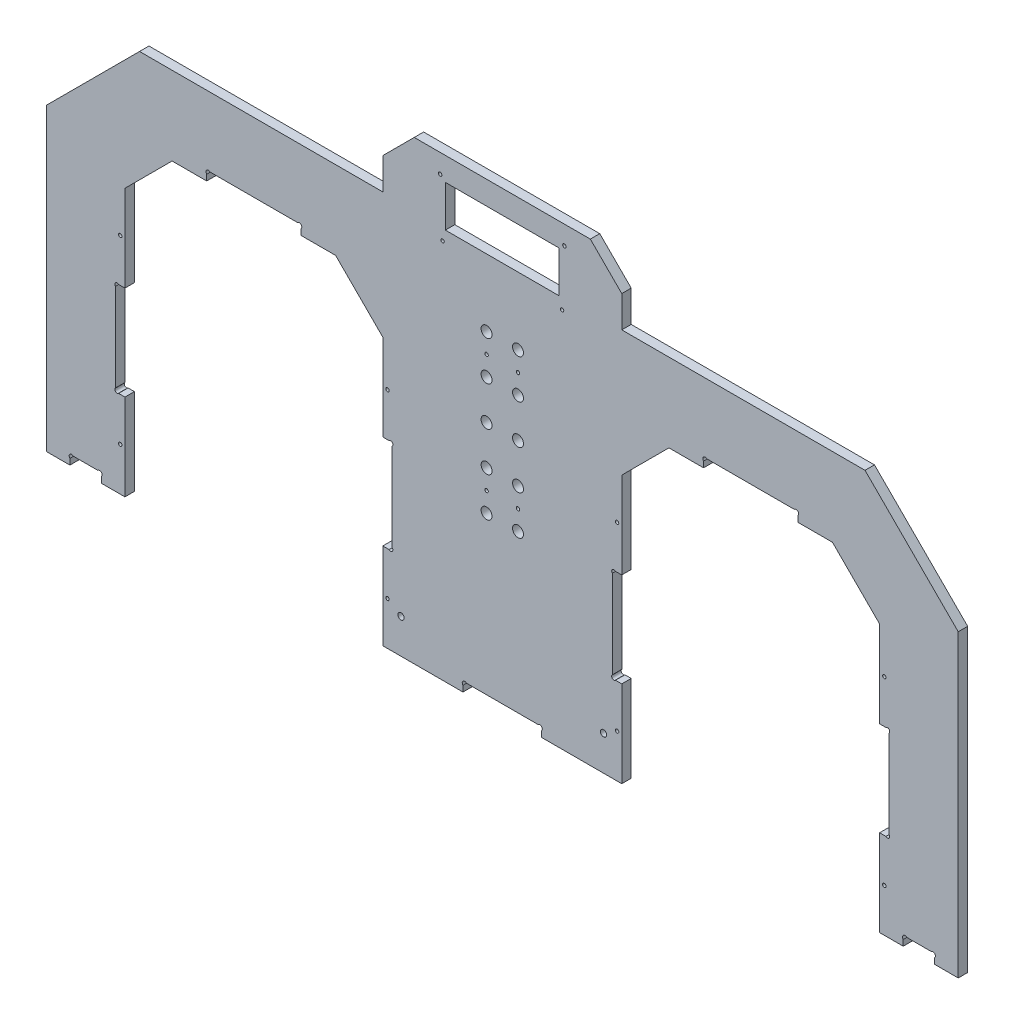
ISO-10303-21;
HEADER;
FILE_DESCRIPTION(('STEP AP214'),'2;1');
FILE_NAME('part.step','',(''),(''),'','','');
FILE_SCHEMA(('AUTOMOTIVE_DESIGN { 1 0 10303 214 1 1 1 1 }'));
ENDSEC;
DATA;
#1=APPLICATION_CONTEXT('core data for automotive mechanical design processes');
#2=APPLICATION_PROTOCOL_DEFINITION('international standard','automotive_design',2000,#1);
#3=PRODUCT_CONTEXT('',#1,'mechanical');
#4=PRODUCT('Part','Part','',(#3));
#5=PRODUCT_RELATED_PRODUCT_CATEGORY('part','',(#4));
#6=PRODUCT_DEFINITION_FORMATION('','',#4);
#7=PRODUCT_DEFINITION_CONTEXT('part definition',#1,'design');
#8=PRODUCT_DEFINITION('design','',#6,#7);
#9=PRODUCT_DEFINITION_SHAPE('','',#8);
#10=(LENGTH_UNIT() NAMED_UNIT(*) SI_UNIT(.MILLI.,.METRE.));
#11=(NAMED_UNIT(*) PLANE_ANGLE_UNIT() SI_UNIT($,.RADIAN.));
#12=(NAMED_UNIT(*) SI_UNIT($,.STERADIAN.) SOLID_ANGLE_UNIT());
#13=UNCERTAINTY_MEASURE_WITH_UNIT(LENGTH_MEASURE(1.E-05),#10,'distance_accuracy_value','');
#14=(GEOMETRIC_REPRESENTATION_CONTEXT(3) GLOBAL_UNCERTAINTY_ASSIGNED_CONTEXT((#13)) GLOBAL_UNIT_ASSIGNED_CONTEXT((#10,
#11,#12)) REPRESENTATION_CONTEXT('',''));
#15=CARTESIAN_POINT('',(0.,0.,0.));
#16=DIRECTION('',(0.,0.,1.));
#17=DIRECTION('',(1.,0.,0.));
#18=AXIS2_PLACEMENT_3D('',#15,#16,#17);
#19=CARTESIAN_POINT('',(273.868629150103,4.8686291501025,6.));
#20=DIRECTION('',(0.,0.,1.));
#21=DIRECTION('',(1.,0.,0.));
#22=AXIS2_PLACEMENT_3D('',#19,#20,#21);
#23=PLANE('',#22);
#24=CARTESIAN_POINT('',(38.,242.,6.));
#25=DIRECTION('',(0.,0.,1.));
#26=DIRECTION('',(-1.,0.,0.));
#27=AXIS2_PLACEMENT_3D('',#24,#25,#26);
#28=CIRCLE('',#27,1.1);
#29=CARTESIAN_POINT('',(36.9,242.,6.));
#30=VERTEX_POINT('',#29);
#31=EDGE_CURVE('E2627',#30,#30,#28,.T.);
#32=ORIENTED_EDGE('',*,*,#31,.F.);
#33=EDGE_LOOP('',(#32));
#34=FACE_BOUND('',#33,.T.);
#35=CARTESIAN_POINT('',(-39.5,278.,6.));
#36=DIRECTION('',(0.,0.,1.));
#37=DIRECTION('',(1.,0.,0.));
#38=AXIS2_PLACEMENT_3D('',#35,#36,#37);
#39=CIRCLE('',#38,1.1);
#40=CARTESIAN_POINT('',(-38.4,278.,6.));
#41=VERTEX_POINT('',#40);
#42=EDGE_CURVE('E571',#41,#41,#39,.T.);
#43=ORIENTED_EDGE('',*,*,#42,.F.);
#44=EDGE_LOOP('',(#43));
#45=FACE_BOUND('',#44,.T.);
#46=CARTESIAN_POINT('',(-10.,193.5,6.));
#47=DIRECTION('',(0.,0.,1.));
#48=DIRECTION('',(-1.,0.,0.));
#49=AXIS2_PLACEMENT_3D('',#46,#47,#48);
#50=CIRCLE('',#49,1.09999999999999);
#51=CARTESIAN_POINT('',(-11.1,193.5,6.));
#52=VERTEX_POINT('',#51);
#53=EDGE_CURVE('E587',#52,#52,#50,.T.);
#54=ORIENTED_EDGE('',*,*,#53,.F.);
#55=EDGE_LOOP('',(#54));
#56=FACE_BOUND('',#55,.T.);
#57=CARTESIAN_POINT('',(10.,193.5,6.));
#58=DIRECTION('',(0.,0.,1.));
#59=DIRECTION('',(1.,0.,0.));
#60=AXIS2_PLACEMENT_3D('',#57,#58,#59);
#61=CIRCLE('',#60,1.09999999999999);
#62=CARTESIAN_POINT('',(11.1,193.5,6.));
#63=VERTEX_POINT('',#62);
#64=EDGE_CURVE('E599',#63,#63,#61,.T.);
#65=ORIENTED_EDGE('',*,*,#64,.F.);
#66=EDGE_LOOP('',(#65));
#67=FACE_BOUND('',#66,.T.);
#68=CARTESIAN_POINT('',(-73.,27.5,6.));
#69=DIRECTION('',(0.,0.,1.));
#70=DIRECTION('',(-1.,0.,0.));
#71=AXIS2_PLACEMENT_3D('',#68,#69,#70);
#72=CIRCLE('',#71,1.09999999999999);
#73=CARTESIAN_POINT('',(-74.1,27.5,6.));
#74=VERTEX_POINT('',#73);
#75=EDGE_CURVE('E611',#74,#74,#72,.T.);
#76=ORIENTED_EDGE('',*,*,#75,.F.);
#77=EDGE_LOOP('',(#76));
#78=FACE_BOUND('',#77,.T.);
#79=CARTESIAN_POINT('',(-243.,142.5,6.));
#80=DIRECTION('',(0.,0.,1.));
#81=DIRECTION('',(-1.,0.,0.));
#82=AXIS2_PLACEMENT_3D('',#79,#80,#81);
#83=CIRCLE('',#82,1.09999999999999);
#84=CARTESIAN_POINT('',(-244.1,142.5,6.));
#85=VERTEX_POINT('',#84);
#86=EDGE_CURVE('E623',#85,#85,#83,.T.);
#87=ORIENTED_EDGE('',*,*,#86,.F.);
#88=EDGE_LOOP('',(#87));
#89=FACE_BOUND('',#88,.T.);
#90=CARTESIAN_POINT('',(73.,27.5,6.));
#91=DIRECTION('',(0.,0.,1.));
#92=DIRECTION('',(1.,0.,0.));
#93=AXIS2_PLACEMENT_3D('',#90,#91,#92);
#94=CIRCLE('',#93,1.09999999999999);
#95=CARTESIAN_POINT('',(74.1,27.5,6.));
#96=VERTEX_POINT('',#95);
#97=EDGE_CURVE('E635',#96,#96,#94,.T.);
#98=ORIENTED_EDGE('',*,*,#97,.F.);
#99=EDGE_LOOP('',(#98));
#100=FACE_BOUND('',#99,.T.);
#101=CARTESIAN_POINT('',(64.4,22.,6.));
#102=DIRECTION('',(0.,0.,1.));
#103=DIRECTION('',(1.,0.,0.));
#104=AXIS2_PLACEMENT_3D('',#101,#102,#103);
#105=CIRCLE('',#104,2.);
#106=CARTESIAN_POINT('',(66.4,22.,6.));
#107=VERTEX_POINT('',#106);
#108=EDGE_CURVE('E647',#107,#107,#105,.T.);
#109=ORIENTED_EDGE('',*,*,#108,.F.);
#110=EDGE_LOOP('',(#109));
#111=FACE_BOUND('',#110,.T.);
#112=CARTESIAN_POINT('',(10.,206.,6.));
#113=DIRECTION('',(0.,0.,1.));
#114=DIRECTION('',(1.,0.,0.));
#115=AXIS2_PLACEMENT_3D('',#112,#113,#114);
#116=CIRCLE('',#115,3.47499999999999);
#117=CARTESIAN_POINT('',(13.475,206.,6.));
#118=VERTEX_POINT('',#117);
#119=EDGE_CURVE('E659',#118,#118,#116,.T.);
#120=ORIENTED_EDGE('',*,*,#119,.F.);
#121=EDGE_LOOP('',(#120));
#122=FACE_BOUND('',#121,.T.);
#123=CARTESIAN_POINT('',(10.0000000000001,181.,6.));
#124=DIRECTION('',(0.,0.,1.));
#125=DIRECTION('',(1.,0.,0.));
#126=AXIS2_PLACEMENT_3D('',#123,#124,#125);
#127=CIRCLE('',#126,3.47499999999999);
#128=CARTESIAN_POINT('',(13.4750000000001,181.,6.));
#129=VERTEX_POINT('',#128);
#130=EDGE_CURVE('E671',#129,#129,#127,.T.);
#131=ORIENTED_EDGE('',*,*,#130,.F.);
#132=EDGE_LOOP('',(#131));
#133=FACE_BOUND('',#132,.T.);
#134=CARTESIAN_POINT('',(10.0000000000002,156.,6.));
#135=DIRECTION('',(0.,0.,1.));
#136=DIRECTION('',(1.,0.,0.));
#137=AXIS2_PLACEMENT_3D('',#134,#135,#136);
#138=CIRCLE('',#137,3.47499999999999);
#139=CARTESIAN_POINT('',(13.4750000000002,156.,6.));
#140=VERTEX_POINT('',#139);
#141=EDGE_CURVE('E683',#140,#140,#138,.T.);
#142=ORIENTED_EDGE('',*,*,#141,.F.);
#143=EDGE_LOOP('',(#142));
#144=FACE_BOUND('',#143,.T.);
#145=CARTESIAN_POINT('',(10.0000000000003,131.,6.));
#146=DIRECTION('',(0.,0.,1.));
#147=DIRECTION('',(1.,0.,0.));
#148=AXIS2_PLACEMENT_3D('',#145,#146,#147);
#149=CIRCLE('',#148,3.47499999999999);
#150=CARTESIAN_POINT('',(13.4750000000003,131.,6.));
#151=VERTEX_POINT('',#150);
#152=EDGE_CURVE('E695',#151,#151,#149,.T.);
#153=ORIENTED_EDGE('',*,*,#152,.F.);
#154=EDGE_LOOP('',(#153));
#155=FACE_BOUND('',#154,.T.);
#156=CARTESIAN_POINT('',(10.0000000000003,106.,6.));
#157=DIRECTION('',(0.,0.,1.));
#158=DIRECTION('',(1.,0.,0.));
#159=AXIS2_PLACEMENT_3D('',#156,#157,#158);
#160=CIRCLE('',#159,3.475);
#161=CARTESIAN_POINT('',(13.4750000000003,106.,6.));
#162=VERTEX_POINT('',#161);
#163=EDGE_CURVE('E707',#162,#162,#160,.T.);
#164=ORIENTED_EDGE('',*,*,#163,.F.);
#165=EDGE_LOOP('',(#164));
#166=FACE_BOUND('',#165,.T.);
#167=CARTESIAN_POINT('',(243.,142.5,6.));
#168=DIRECTION('',(0.,0.,1.));
#169=DIRECTION('',(1.,0.,0.));
#170=AXIS2_PLACEMENT_3D('',#167,#168,#169);
#171=CIRCLE('',#170,1.09999999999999);
#172=CARTESIAN_POINT('',(244.1,142.5,6.));
#173=VERTEX_POINT('',#172);
#174=EDGE_CURVE('E719',#173,#173,#171,.T.);
#175=ORIENTED_EDGE('',*,*,#174,.F.);
#176=EDGE_LOOP('',(#175));
#177=FACE_BOUND('',#176,.T.);
#178=DIRECTION('',(-1.,0.,0.));
#179=VECTOR('',#178,1.);
#180=CARTESIAN_POINT('',(-56.,290.,6.));
#181=LINE('',#180,#179);
#182=CARTESIAN_POINT('',(56.,290.,6.));
#183=VERTEX_POINT('',#182);
#184=CARTESIAN_POINT('',(-56.,290.,6.));
#185=VERTEX_POINT('',#184);
#186=EDGE_CURVE('E725',#183,#185,#181,.T.);
#187=ORIENTED_EDGE('',*,*,#186,.T.);
#188=DIRECTION('',(-0.707106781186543,-0.707106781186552,0.));
#189=VECTOR('',#188,1.);
#190=CARTESIAN_POINT('',(-56.,290.,6.));
#191=LINE('',#190,#189);
#192=CARTESIAN_POINT('',(-76.,270.,6.));
#193=VERTEX_POINT('',#192);
#194=EDGE_CURVE('E728',#185,#193,#191,.T.);
#195=ORIENTED_EDGE('',*,*,#194,.T.);
#196=DIRECTION('',(0.,-1.,0.));
#197=VECTOR('',#196,1.);
#198=CARTESIAN_POINT('',(-76.,270.,6.));
#199=LINE('',#198,#197);
#200=CARTESIAN_POINT('',(-76.,250.,6.));
#201=VERTEX_POINT('',#200);
#202=EDGE_CURVE('E731',#193,#201,#199,.T.);
#203=ORIENTED_EDGE('',*,*,#202,.T.);
#204=DIRECTION('',(-1.,0.,0.));
#205=VECTOR('',#204,1.);
#206=CARTESIAN_POINT('',(-76.,250.,6.));
#207=LINE('',#206,#205);
#208=CARTESIAN_POINT('',(-230.710678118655,250.,6.));
#209=VERTEX_POINT('',#208);
#210=EDGE_CURVE('E733',#201,#209,#207,.T.);
#211=ORIENTED_EDGE('',*,*,#210,.T.);
#212=DIRECTION('',(-0.707106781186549,-0.707106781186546,0.));
#213=VECTOR('',#212,1.);
#214=CARTESIAN_POINT('',(-230.710678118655,250.,6.));
#215=LINE('',#214,#213);
#216=CARTESIAN_POINT('',(-290.,190.710678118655,6.));
#217=VERTEX_POINT('',#216);
#218=EDGE_CURVE('E735',#209,#217,#215,.T.);
#219=ORIENTED_EDGE('',*,*,#218,.T.);
#220=DIRECTION('',(0.,-1.,0.));
#221=VECTOR('',#220,1.);
#222=CARTESIAN_POINT('',(-290.,190.710678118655,6.));
#223=LINE('',#222,#221);
#224=CARTESIAN_POINT('',(-290.,0.,6.));
#225=VERTEX_POINT('',#224);
#226=EDGE_CURVE('E737',#217,#225,#223,.T.);
#227=ORIENTED_EDGE('',*,*,#226,.T.);
#228=DIRECTION('',(1.,0.,0.));
#229=VECTOR('',#228,1.);
#230=CARTESIAN_POINT('',(-275.,0.,6.));
#231=LINE('',#230,#229);
#232=CARTESIAN_POINT('',(-275.,0.,6.));
#233=VERTEX_POINT('',#232);
#234=EDGE_CURVE('E739',#225,#233,#231,.T.);
#235=ORIENTED_EDGE('',*,*,#234,.T.);
#236=DIRECTION('',(0.,1.,0.));
#237=VECTOR('',#236,1.);
#238=CARTESIAN_POINT('',(-275.,3.73725830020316,6.));
#239=LINE('',#238,#237);
#240=CARTESIAN_POINT('',(-275.,3.73725830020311,6.));
#241=VERTEX_POINT('',#240);
#242=EDGE_CURVE('E741',#233,#241,#239,.T.);
#243=ORIENTED_EDGE('',*,*,#242,.T.);
#244=CARTESIAN_POINT('',(-273.868629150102,4.86862915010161,6.));
#245=DIRECTION('',(0.,0.,-1.));
#246=DIRECTION('',(-1.,0.,0.));
#247=AXIS2_PLACEMENT_3D('',#244,#245,#246);
#248=CIRCLE('',#247,1.59999999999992);
#249=CARTESIAN_POINT('',(-272.737258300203,5.99999999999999,6.));
#250=VERTEX_POINT('',#249);
#251=EDGE_CURVE('E743',#241,#250,#248,.T.);
#252=ORIENTED_EDGE('',*,*,#251,.T.);
#253=DIRECTION('',(1.,0.,0.));
#254=VECTOR('',#253,1.);
#255=CARTESIAN_POINT('',(-257.262741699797,5.99999999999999,6.));
#256=LINE('',#255,#254);
#257=CARTESIAN_POINT('',(-257.262741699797,5.99999999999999,6.));
#258=VERTEX_POINT('',#257);
#259=EDGE_CURVE('E745',#250,#258,#256,.T.);
#260=ORIENTED_EDGE('',*,*,#259,.T.);
#261=CARTESIAN_POINT('',(-256.131370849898,4.86862915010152,6.));
#262=DIRECTION('',(0.,0.,-1.));
#263=DIRECTION('',(1.,0.,0.));
#264=AXIS2_PLACEMENT_3D('',#261,#262,#263);
#265=CIRCLE('',#264,1.59999999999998);
#266=CARTESIAN_POINT('',(-255.,3.73725830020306,6.));
#267=VERTEX_POINT('',#266);
#268=EDGE_CURVE('E747',#258,#267,#265,.T.);
#269=ORIENTED_EDGE('',*,*,#268,.T.);
#270=DIRECTION('',(0.,-1.,0.));
#271=VECTOR('',#270,1.);
#272=CARTESIAN_POINT('',(-255.,3.73725830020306,6.));
#273=LINE('',#272,#271);
#274=CARTESIAN_POINT('',(-255.,0.,6.));
#275=VERTEX_POINT('',#274);
#276=EDGE_CURVE('E749',#267,#275,#273,.T.);
#277=ORIENTED_EDGE('',*,*,#276,.T.);
#278=DIRECTION('',(1.,0.,0.));
#279=VECTOR('',#278,1.);
#280=CARTESIAN_POINT('',(-240.,0.,6.));
#281=LINE('',#280,#279);
#282=CARTESIAN_POINT('',(-240.,0.,6.));
#283=VERTEX_POINT('',#282);
#284=EDGE_CURVE('E751',#275,#283,#281,.T.);
#285=ORIENTED_EDGE('',*,*,#284,.T.);
#286=DIRECTION('',(0.,1.,0.));
#287=VECTOR('',#286,1.);
#288=CARTESIAN_POINT('',(-240.,55.,6.));
#289=LINE('',#288,#287);
#290=CARTESIAN_POINT('',(-240.,55.,6.));
#291=VERTEX_POINT('',#290);
#292=EDGE_CURVE('E753',#283,#291,#289,.T.);
#293=ORIENTED_EDGE('',*,*,#292,.T.);
#294=DIRECTION('',(-1.,0.,0.));
#295=VECTOR('',#294,1.);
#296=CARTESIAN_POINT('',(-244.,55.,6.));
#297=LINE('',#296,#295);
#298=CARTESIAN_POINT('',(-244.,55.,6.));
#299=VERTEX_POINT('',#298);
#300=EDGE_CURVE('E755',#291,#299,#297,.T.);
#301=ORIENTED_EDGE('',*,*,#300,.T.);
#302=CARTESIAN_POINT('',(-245.,56.,6.));
#303=DIRECTION('',(0.,0.,-1.));
#304=DIRECTION('',(1.,0.,0.));
#305=AXIS2_PLACEMENT_3D('',#302,#303,#304);
#306=CIRCLE('',#305,1.41421356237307);
#307=CARTESIAN_POINT('',(-246.,57.,6.));
#308=VERTEX_POINT('',#307);
#309=EDGE_CURVE('E757',#299,#308,#306,.T.);
#310=ORIENTED_EDGE('',*,*,#309,.T.);
#311=DIRECTION('',(0.,1.,0.));
#312=VECTOR('',#311,1.);
#313=CARTESIAN_POINT('',(-246.,113.,6.));
#314=LINE('',#313,#312);
#315=CARTESIAN_POINT('',(-246.,113.,6.));
#316=VERTEX_POINT('',#315);
#317=EDGE_CURVE('E759',#308,#316,#314,.T.);
#318=ORIENTED_EDGE('',*,*,#317,.T.);
#319=CARTESIAN_POINT('',(-245.,114.,6.));
#320=DIRECTION('',(0.,0.,-1.));
#321=DIRECTION('',(-1.,0.,0.));
#322=AXIS2_PLACEMENT_3D('',#319,#320,#321);
#323=CIRCLE('',#322,1.41421356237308);
#324=CARTESIAN_POINT('',(-244.,115.,6.));
#325=VERTEX_POINT('',#324);
#326=EDGE_CURVE('E761',#316,#325,#323,.T.);
#327=ORIENTED_EDGE('',*,*,#326,.T.);
#328=DIRECTION('',(1.,0.,0.));
#329=VECTOR('',#328,1.);
#330=CARTESIAN_POINT('',(-240.,115.,6.));
#331=LINE('',#330,#329);
#332=CARTESIAN_POINT('',(-240.,115.,6.));
#333=VERTEX_POINT('',#332);
#334=EDGE_CURVE('E763',#325,#333,#331,.T.);
#335=ORIENTED_EDGE('',*,*,#334,.T.);
#336=DIRECTION('',(0.,1.,0.));
#337=VECTOR('',#336,1.);
#338=CARTESIAN_POINT('',(-240.,170.,6.));
#339=LINE('',#338,#337);
#340=CARTESIAN_POINT('',(-240.,170.,6.));
#341=VERTEX_POINT('',#340);
#342=EDGE_CURVE('E765',#333,#341,#339,.T.);
#343=ORIENTED_EDGE('',*,*,#342,.T.);
#344=DIRECTION('',(0.70710678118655,0.707106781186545,0.));
#345=VECTOR('',#344,1.);
#346=CARTESIAN_POINT('',(-210.,200.,6.));
#347=LINE('',#346,#345);
#348=CARTESIAN_POINT('',(-210.,200.,6.));
#349=VERTEX_POINT('',#348);
#350=EDGE_CURVE('E767',#341,#349,#347,.T.);
#351=ORIENTED_EDGE('',*,*,#350,.T.);
#352=DIRECTION('',(1.,0.,0.));
#353=VECTOR('',#352,1.);
#354=CARTESIAN_POINT('',(-210.,200.,6.));
#355=LINE('',#354,#353);
#356=CARTESIAN_POINT('',(-188.000000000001,199.999999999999,6.));
#357=VERTEX_POINT('',#356);
#358=EDGE_CURVE('E769',#349,#357,#355,.T.);
#359=ORIENTED_EDGE('',*,*,#358,.T.);
#360=DIRECTION('',(0.,1.,0.));
#361=VECTOR('',#360,1.);
#362=CARTESIAN_POINT('',(-188.000000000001,203.737258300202,6.));
#363=LINE('',#362,#361);
#364=CARTESIAN_POINT('',(-188.000000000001,203.737258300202,6.));
#365=VERTEX_POINT('',#364);
#366=EDGE_CURVE('E771',#357,#365,#363,.T.);
#367=ORIENTED_EDGE('',*,*,#366,.T.);
#368=CARTESIAN_POINT('',(-186.868629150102,204.8686291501,6.));
#369=DIRECTION('',(0.,0.,-1.));
#370=DIRECTION('',(1.,0.,0.));
#371=AXIS2_PLACEMENT_3D('',#368,#369,#370);
#372=CIRCLE('',#371,1.60000000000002);
#373=CARTESIAN_POINT('',(-185.737258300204,205.999999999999,6.));
#374=VERTEX_POINT('',#373);
#375=EDGE_CURVE('E773',#365,#374,#372,.T.);
#376=ORIENTED_EDGE('',*,*,#375,.T.);
#377=DIRECTION('',(1.,0.,0.));
#378=VECTOR('',#377,1.);
#379=CARTESIAN_POINT('',(-130.262741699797,206.,6.));
#380=LINE('',#379,#378);
#381=CARTESIAN_POINT('',(-130.262741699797,206.,6.));
#382=VERTEX_POINT('',#381);
#383=EDGE_CURVE('E775',#374,#382,#380,.T.);
#384=ORIENTED_EDGE('',*,*,#383,.T.);
#385=CARTESIAN_POINT('',(-129.131370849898,204.868629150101,6.));
#386=DIRECTION('',(0.,0.,-1.));
#387=DIRECTION('',(-1.,0.,0.));
#388=AXIS2_PLACEMENT_3D('',#385,#386,#387);
#389=CIRCLE('',#388,1.60000000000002);
#390=CARTESIAN_POINT('',(-128.,203.737258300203,6.));
#391=VERTEX_POINT('',#390);
#392=EDGE_CURVE('E777',#382,#391,#389,.T.);
#393=ORIENTED_EDGE('',*,*,#392,.T.);
#394=DIRECTION('',(0.,-1.,0.));
#395=VECTOR('',#394,1.);
#396=CARTESIAN_POINT('',(-128.,203.737258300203,6.));
#397=LINE('',#396,#395);
#398=CARTESIAN_POINT('',(-128.,200.,6.));
#399=VERTEX_POINT('',#398);
#400=EDGE_CURVE('E779',#391,#399,#397,.T.);
#401=ORIENTED_EDGE('',*,*,#400,.T.);
#402=DIRECTION('',(1.,0.,0.));
#403=VECTOR('',#402,1.);
#404=CARTESIAN_POINT('',(-128.,200.,6.));
#405=LINE('',#404,#403);
#406=CARTESIAN_POINT('',(-106.,200.,6.));
#407=VERTEX_POINT('',#406);
#408=EDGE_CURVE('E781',#399,#407,#405,.T.);
#409=ORIENTED_EDGE('',*,*,#408,.T.);
#410=DIRECTION('',(0.707106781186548,-0.707106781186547,0.));
#411=VECTOR('',#410,1.);
#412=CARTESIAN_POINT('',(-106.,200.,6.));
#413=LINE('',#412,#411);
#414=CARTESIAN_POINT('',(-76.,170.,6.));
#415=VERTEX_POINT('',#414);
#416=EDGE_CURVE('E783',#407,#415,#413,.T.);
#417=ORIENTED_EDGE('',*,*,#416,.T.);
#418=DIRECTION('',(0.,-1.,0.));
#419=VECTOR('',#418,1.);
#420=CARTESIAN_POINT('',(-76.,170.,6.));
#421=LINE('',#420,#419);
#422=CARTESIAN_POINT('',(-76.,115.,6.));
#423=VERTEX_POINT('',#422);
#424=EDGE_CURVE('E785',#415,#423,#421,.T.);
#425=ORIENTED_EDGE('',*,*,#424,.T.);
#426=DIRECTION('',(1.,0.,0.));
#427=VECTOR('',#426,1.);
#428=CARTESIAN_POINT('',(-76.,115.,6.));
#429=LINE('',#428,#427);
#430=CARTESIAN_POINT('',(-71.9999999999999,115.,6.));
#431=VERTEX_POINT('',#430);
#432=EDGE_CURVE('E787',#423,#431,#429,.T.);
#433=ORIENTED_EDGE('',*,*,#432,.T.);
#434=CARTESIAN_POINT('',(-71.,114.,6.));
#435=DIRECTION('',(0.,0.,-1.));
#436=DIRECTION('',(1.,0.,0.));
#437=AXIS2_PLACEMENT_3D('',#434,#435,#436);
#438=CIRCLE('',#437,1.41421356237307);
#439=CARTESIAN_POINT('',(-70.,113.,6.));
#440=VERTEX_POINT('',#439);
#441=EDGE_CURVE('E789',#431,#440,#438,.T.);
#442=ORIENTED_EDGE('',*,*,#441,.T.);
#443=DIRECTION('',(0.,-1.,0.));
#444=VECTOR('',#443,1.);
#445=CARTESIAN_POINT('',(-70.,113.,6.));
#446=LINE('',#445,#444);
#447=CARTESIAN_POINT('',(-70.,57.,6.));
#448=VERTEX_POINT('',#447);
#449=EDGE_CURVE('E791',#440,#448,#446,.T.);
#450=ORIENTED_EDGE('',*,*,#449,.T.);
#451=CARTESIAN_POINT('',(-71.,56.,6.));
#452=DIRECTION('',(0.,0.,-1.));
#453=DIRECTION('',(-1.,0.,0.));
#454=AXIS2_PLACEMENT_3D('',#451,#452,#453);
#455=CIRCLE('',#454,1.41421356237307);
#456=CARTESIAN_POINT('',(-71.9999999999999,55.,6.));
#457=VERTEX_POINT('',#456);
#458=EDGE_CURVE('E793',#448,#457,#455,.T.);
#459=ORIENTED_EDGE('',*,*,#458,.T.);
#460=DIRECTION('',(-1.,0.,0.));
#461=VECTOR('',#460,1.);
#462=CARTESIAN_POINT('',(-71.9999999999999,55.,6.));
#463=LINE('',#462,#461);
#464=CARTESIAN_POINT('',(-76.,55.,6.));
#465=VERTEX_POINT('',#464);
#466=EDGE_CURVE('E795',#457,#465,#463,.T.);
#467=ORIENTED_EDGE('',*,*,#466,.T.);
#468=DIRECTION('',(0.,-1.,0.));
#469=VECTOR('',#468,1.);
#470=CARTESIAN_POINT('',(-76.,55.,6.));
#471=LINE('',#470,#469);
#472=CARTESIAN_POINT('',(-76.,0.,6.));
#473=VERTEX_POINT('',#472);
#474=EDGE_CURVE('E797',#465,#473,#471,.T.);
#475=ORIENTED_EDGE('',*,*,#474,.T.);
#476=DIRECTION('',(1.,0.,0.));
#477=VECTOR('',#476,1.);
#478=CARTESIAN_POINT('',(-25.,0.,6.));
#479=LINE('',#478,#477);
#480=CARTESIAN_POINT('',(-25.,0.,6.));
#481=VERTEX_POINT('',#480);
#482=EDGE_CURVE('E799',#473,#481,#479,.T.);
#483=ORIENTED_EDGE('',*,*,#482,.T.);
#484=DIRECTION('',(0.,1.,0.));
#485=VECTOR('',#484,1.);
#486=CARTESIAN_POINT('',(-25.,3.73725830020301,6.));
#487=LINE('',#486,#485);
#488=CARTESIAN_POINT('',(-25.,3.737258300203,6.));
#489=VERTEX_POINT('',#488);
#490=EDGE_CURVE('E801',#481,#489,#487,.T.);
#491=ORIENTED_EDGE('',*,*,#490,.T.);
#492=CARTESIAN_POINT('',(-23.8686291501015,4.86862915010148,6.));
#493=DIRECTION('',(0.,0.,-1.));
#494=DIRECTION('',(-1.,0.,0.));
#495=AXIS2_PLACEMENT_3D('',#492,#493,#494);
#496=CIRCLE('',#495,1.6);
#497=CARTESIAN_POINT('',(-22.7372583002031,5.99999999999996,6.));
#498=VERTEX_POINT('',#497);
#499=EDGE_CURVE('E803',#489,#498,#496,.T.);
#500=ORIENTED_EDGE('',*,*,#499,.T.);
#501=DIRECTION('',(1.,0.,0.));
#502=VECTOR('',#501,1.);
#503=CARTESIAN_POINT('',(-22.7372583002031,5.99999999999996,6.));
#504=LINE('',#503,#502);
#505=CARTESIAN_POINT('',(22.7372583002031,5.99999999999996,6.));
#506=VERTEX_POINT('',#505);
#507=EDGE_CURVE('E805',#498,#506,#504,.T.);
#508=ORIENTED_EDGE('',*,*,#507,.T.);
#509=CARTESIAN_POINT('',(23.8686291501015,4.86862915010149,6.));
#510=DIRECTION('',(0.,0.,-1.));
#511=DIRECTION('',(1.,0.,0.));
#512=AXIS2_PLACEMENT_3D('',#509,#510,#511);
#513=CIRCLE('',#512,1.6);
#514=CARTESIAN_POINT('',(25.,3.73725830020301,6.));
#515=VERTEX_POINT('',#514);
#516=EDGE_CURVE('E807',#506,#515,#513,.T.);
#517=ORIENTED_EDGE('',*,*,#516,.T.);
#518=DIRECTION('',(0.,-1.,0.));
#519=VECTOR('',#518,1.);
#520=CARTESIAN_POINT('',(25.,3.73725830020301,6.));
#521=LINE('',#520,#519);
#522=CARTESIAN_POINT('',(25.,0.,6.));
#523=VERTEX_POINT('',#522);
#524=EDGE_CURVE('E809',#515,#523,#521,.T.);
#525=ORIENTED_EDGE('',*,*,#524,.T.);
#526=DIRECTION('',(1.,0.,0.));
#527=VECTOR('',#526,1.);
#528=CARTESIAN_POINT('',(25.,0.,6.));
#529=LINE('',#528,#527);
#530=CARTESIAN_POINT('',(76.,0.,6.));
#531=VERTEX_POINT('',#530);
#532=EDGE_CURVE('E811',#523,#531,#529,.T.);
#533=ORIENTED_EDGE('',*,*,#532,.T.);
#534=DIRECTION('',(0.,1.,0.));
#535=VECTOR('',#534,1.);
#536=CARTESIAN_POINT('',(76.,55.,6.));
#537=LINE('',#536,#535);
#538=CARTESIAN_POINT('',(76.,55.,6.));
#539=VERTEX_POINT('',#538);
#540=EDGE_CURVE('E813',#531,#539,#537,.T.);
#541=ORIENTED_EDGE('',*,*,#540,.T.);
#542=DIRECTION('',(-1.,0.,0.));
#543=VECTOR('',#542,1.);
#544=CARTESIAN_POINT('',(71.9999999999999,55.,6.));
#545=LINE('',#544,#543);
#546=CARTESIAN_POINT('',(71.9999999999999,55.,6.));
#547=VERTEX_POINT('',#546);
#548=EDGE_CURVE('E815',#539,#547,#545,.T.);
#549=ORIENTED_EDGE('',*,*,#548,.T.);
#550=CARTESIAN_POINT('',(71.,56.,6.));
#551=DIRECTION('',(0.,0.,-1.));
#552=DIRECTION('',(1.,0.,0.));
#553=AXIS2_PLACEMENT_3D('',#550,#551,#552);
#554=CIRCLE('',#553,1.41421356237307);
#555=CARTESIAN_POINT('',(70.,57.,6.));
#556=VERTEX_POINT('',#555);
#557=EDGE_CURVE('E817',#547,#556,#554,.T.);
#558=ORIENTED_EDGE('',*,*,#557,.T.);
#559=DIRECTION('',(0.,1.,0.));
#560=VECTOR('',#559,1.);
#561=CARTESIAN_POINT('',(70.,113.,6.));
#562=LINE('',#561,#560);
#563=CARTESIAN_POINT('',(70.,113.,6.));
#564=VERTEX_POINT('',#563);
#565=EDGE_CURVE('E819',#556,#564,#562,.T.);
#566=ORIENTED_EDGE('',*,*,#565,.T.);
#567=CARTESIAN_POINT('',(71.,114.,6.));
#568=DIRECTION('',(0.,0.,-1.));
#569=DIRECTION('',(-1.,0.,0.));
#570=AXIS2_PLACEMENT_3D('',#567,#568,#569);
#571=CIRCLE('',#570,1.41421356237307);
#572=CARTESIAN_POINT('',(71.9999999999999,115.,6.));
#573=VERTEX_POINT('',#572);
#574=EDGE_CURVE('E821',#564,#573,#571,.T.);
#575=ORIENTED_EDGE('',*,*,#574,.T.);
#576=DIRECTION('',(1.,0.,0.));
#577=VECTOR('',#576,1.);
#578=CARTESIAN_POINT('',(76.,115.,6.));
#579=LINE('',#578,#577);
#580=CARTESIAN_POINT('',(76.,115.,6.));
#581=VERTEX_POINT('',#580);
#582=EDGE_CURVE('E823',#573,#581,#579,.T.);
#583=ORIENTED_EDGE('',*,*,#582,.T.);
#584=DIRECTION('',(0.,1.,0.));
#585=VECTOR('',#584,1.);
#586=CARTESIAN_POINT('',(76.,170.,6.));
#587=LINE('',#586,#585);
#588=CARTESIAN_POINT('',(76.,170.,6.));
#589=VERTEX_POINT('',#588);
#590=EDGE_CURVE('E825',#581,#589,#587,.T.);
#591=ORIENTED_EDGE('',*,*,#590,.T.);
#592=DIRECTION('',(0.707106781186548,0.707106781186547,0.));
#593=VECTOR('',#592,1.);
#594=CARTESIAN_POINT('',(106.,200.,6.));
#595=LINE('',#594,#593);
#596=CARTESIAN_POINT('',(106.,200.,6.));
#597=VERTEX_POINT('',#596);
#598=EDGE_CURVE('E827',#589,#597,#595,.T.);
#599=ORIENTED_EDGE('',*,*,#598,.T.);
#600=DIRECTION('',(1.,0.,0.));
#601=VECTOR('',#600,1.);
#602=CARTESIAN_POINT('',(128.,200.,6.));
#603=LINE('',#602,#601);
#604=CARTESIAN_POINT('',(128.,200.,6.));
#605=VERTEX_POINT('',#604);
#606=EDGE_CURVE('E829',#597,#605,#603,.T.);
#607=ORIENTED_EDGE('',*,*,#606,.T.);
#608=DIRECTION('',(0.,1.,0.));
#609=VECTOR('',#608,1.);
#610=CARTESIAN_POINT('',(128.,203.737258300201,6.));
#611=LINE('',#610,#609);
#612=CARTESIAN_POINT('',(128.000000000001,203.737258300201,6.));
#613=VERTEX_POINT('',#612);
#614=EDGE_CURVE('E831',#605,#613,#611,.T.);
#615=ORIENTED_EDGE('',*,*,#614,.T.);
#616=CARTESIAN_POINT('',(129.1313708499,204.8686291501,6.));
#617=DIRECTION('',(0.,0.,-1.));
#618=DIRECTION('',(1.,0.,0.));
#619=AXIS2_PLACEMENT_3D('',#616,#617,#618);
#620=CIRCLE('',#619,1.60000000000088);
#621=CARTESIAN_POINT('',(130.262741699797,206.,6.));
#622=VERTEX_POINT('',#621);
#623=EDGE_CURVE('E833',#613,#622,#620,.T.);
#624=ORIENTED_EDGE('',*,*,#623,.T.);
#625=DIRECTION('',(1.,0.,0.));
#626=VECTOR('',#625,1.);
#627=CARTESIAN_POINT('',(130.262741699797,206.,6.));
#628=LINE('',#627,#626);
#629=CARTESIAN_POINT('',(185.737258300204,205.999999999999,6.));
#630=VERTEX_POINT('',#629);
#631=EDGE_CURVE('E835',#622,#630,#628,.T.);
#632=ORIENTED_EDGE('',*,*,#631,.T.);
#633=CARTESIAN_POINT('',(186.868629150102,204.8686291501,6.));
#634=DIRECTION('',(0.,0.,-1.));
#635=DIRECTION('',(-1.,0.,0.));
#636=AXIS2_PLACEMENT_3D('',#633,#634,#635);
#637=CIRCLE('',#636,1.60000000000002);
#638=CARTESIAN_POINT('',(188.000000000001,203.737258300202,6.));
#639=VERTEX_POINT('',#638);
#640=EDGE_CURVE('E837',#630,#639,#637,.T.);
#641=ORIENTED_EDGE('',*,*,#640,.T.);
#642=DIRECTION('',(0.,-1.,0.));
#643=VECTOR('',#642,1.);
#644=CARTESIAN_POINT('',(188.000000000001,203.737258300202,6.));
#645=LINE('',#644,#643);
#646=CARTESIAN_POINT('',(188.000000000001,199.999999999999,6.));
#647=VERTEX_POINT('',#646);
#648=EDGE_CURVE('E839',#639,#647,#645,.T.);
#649=ORIENTED_EDGE('',*,*,#648,.T.);
#650=DIRECTION('',(1.,0.,0.));
#651=VECTOR('',#650,1.);
#652=CARTESIAN_POINT('',(210.,200.,6.));
#653=LINE('',#652,#651);
#654=CARTESIAN_POINT('',(210.,200.,6.));
#655=VERTEX_POINT('',#654);
#656=EDGE_CURVE('E841',#647,#655,#653,.T.);
#657=ORIENTED_EDGE('',*,*,#656,.T.);
#658=DIRECTION('',(0.70710678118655,-0.707106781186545,0.));
#659=VECTOR('',#658,1.);
#660=CARTESIAN_POINT('',(210.,200.,6.));
#661=LINE('',#660,#659);
#662=CARTESIAN_POINT('',(240.,170.,6.));
#663=VERTEX_POINT('',#662);
#664=EDGE_CURVE('E843',#655,#663,#661,.T.);
#665=ORIENTED_EDGE('',*,*,#664,.T.);
#666=DIRECTION('',(0.,-1.,0.));
#667=VECTOR('',#666,1.);
#668=CARTESIAN_POINT('',(240.,170.,6.));
#669=LINE('',#668,#667);
#670=CARTESIAN_POINT('',(240.,115.,6.));
#671=VERTEX_POINT('',#670);
#672=EDGE_CURVE('E845',#663,#671,#669,.T.);
#673=ORIENTED_EDGE('',*,*,#672,.T.);
#674=DIRECTION('',(1.,0.,0.));
#675=VECTOR('',#674,1.);
#676=CARTESIAN_POINT('',(240.,115.,6.));
#677=LINE('',#676,#675);
#678=CARTESIAN_POINT('',(244.,115.,6.));
#679=VERTEX_POINT('',#678);
#680=EDGE_CURVE('E847',#671,#679,#677,.T.);
#681=ORIENTED_EDGE('',*,*,#680,.T.);
#682=CARTESIAN_POINT('',(245.,114.,6.));
#683=DIRECTION('',(0.,0.,-1.));
#684=DIRECTION('',(1.,0.,0.));
#685=AXIS2_PLACEMENT_3D('',#682,#683,#684);
#686=CIRCLE('',#685,1.41421356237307);
#687=CARTESIAN_POINT('',(246.,113.,6.));
#688=VERTEX_POINT('',#687);
#689=EDGE_CURVE('E849',#679,#688,#686,.T.);
#690=ORIENTED_EDGE('',*,*,#689,.T.);
#691=DIRECTION('',(0.,-1.,0.));
#692=VECTOR('',#691,1.);
#693=CARTESIAN_POINT('',(246.,113.,6.));
#694=LINE('',#693,#692);
#695=CARTESIAN_POINT('',(246.,57.,6.));
#696=VERTEX_POINT('',#695);
#697=EDGE_CURVE('E851',#688,#696,#694,.T.);
#698=ORIENTED_EDGE('',*,*,#697,.T.);
#699=CARTESIAN_POINT('',(245.,56.,6.));
#700=DIRECTION('',(0.,0.,-1.));
#701=DIRECTION('',(-1.,0.,0.));
#702=AXIS2_PLACEMENT_3D('',#699,#700,#701);
#703=CIRCLE('',#702,1.41421356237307);
#704=CARTESIAN_POINT('',(244.,55.,6.));
#705=VERTEX_POINT('',#704);
#706=EDGE_CURVE('E853',#696,#705,#703,.T.);
#707=ORIENTED_EDGE('',*,*,#706,.T.);
#708=DIRECTION('',(-1.,0.,0.));
#709=VECTOR('',#708,1.);
#710=CARTESIAN_POINT('',(244.,55.,6.));
#711=LINE('',#710,#709);
#712=CARTESIAN_POINT('',(240.,55.,6.));
#713=VERTEX_POINT('',#712);
#714=EDGE_CURVE('E855',#705,#713,#711,.T.);
#715=ORIENTED_EDGE('',*,*,#714,.T.);
#716=DIRECTION('',(0.,-1.,0.));
#717=VECTOR('',#716,1.);
#718=CARTESIAN_POINT('',(240.,55.,6.));
#719=LINE('',#718,#717);
#720=CARTESIAN_POINT('',(240.,0.,6.));
#721=VERTEX_POINT('',#720);
#722=EDGE_CURVE('E857',#713,#721,#719,.T.);
#723=ORIENTED_EDGE('',*,*,#722,.T.);
#724=DIRECTION('',(1.,0.,0.));
#725=VECTOR('',#724,1.);
#726=CARTESIAN_POINT('',(240.,0.,6.));
#727=LINE('',#726,#725);
#728=CARTESIAN_POINT('',(255.,0.,6.));
#729=VERTEX_POINT('',#728);
#730=EDGE_CURVE('E859',#721,#729,#727,.T.);
#731=ORIENTED_EDGE('',*,*,#730,.T.);
#732=DIRECTION('',(0.,1.,0.));
#733=VECTOR('',#732,1.);
#734=CARTESIAN_POINT('',(255.,3.73725830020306,6.));
#735=LINE('',#734,#733);
#736=CARTESIAN_POINT('',(255.,3.73725830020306,6.));
#737=VERTEX_POINT('',#736);
#738=EDGE_CURVE('E861',#729,#737,#735,.T.);
#739=ORIENTED_EDGE('',*,*,#738,.T.);
#740=CARTESIAN_POINT('',(256.131370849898,4.86862915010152,6.));
#741=DIRECTION('',(0.,0.,-1.));
#742=DIRECTION('',(-1.,0.,0.));
#743=AXIS2_PLACEMENT_3D('',#740,#741,#742);
#744=CIRCLE('',#743,1.59999999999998);
#745=CARTESIAN_POINT('',(257.262741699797,5.99999999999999,6.));
#746=VERTEX_POINT('',#745);
#747=EDGE_CURVE('E863',#737,#746,#744,.T.);
#748=ORIENTED_EDGE('',*,*,#747,.T.);
#749=DIRECTION('',(1.,0.,0.));
#750=VECTOR('',#749,1.);
#751=CARTESIAN_POINT('',(257.262741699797,5.99999999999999,6.));
#752=LINE('',#751,#750);
#753=CARTESIAN_POINT('',(272.737258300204,5.99999999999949,6.));
#754=VERTEX_POINT('',#753);
#755=EDGE_CURVE('E865',#746,#754,#752,.T.);
#756=ORIENTED_EDGE('',*,*,#755,.T.);
#757=CARTESIAN_POINT('',(273.868629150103,4.8686291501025,6.));
#758=DIRECTION('',(0.,0.,-1.));
#759=DIRECTION('',(1.,0.,0.));
#760=AXIS2_PLACEMENT_3D('',#757,#758,#759);
#761=CIRCLE('',#760,1.59999999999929);
#762=CARTESIAN_POINT('',(275.,3.73725830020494,6.));
#763=VERTEX_POINT('',#762);
#764=EDGE_CURVE('E867',#754,#763,#761,.T.);
#765=ORIENTED_EDGE('',*,*,#764,.T.);
#766=DIRECTION('',(0.,-1.,0.));
#767=VECTOR('',#766,1.);
#768=CARTESIAN_POINT('',(275.,3.73725830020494,6.));
#769=LINE('',#768,#767);
#770=CARTESIAN_POINT('',(275.,0.,6.));
#771=VERTEX_POINT('',#770);
#772=EDGE_CURVE('E869',#763,#771,#769,.T.);
#773=ORIENTED_EDGE('',*,*,#772,.T.);
#774=DIRECTION('',(1.,0.,0.));
#775=VECTOR('',#774,1.);
#776=CARTESIAN_POINT('',(275.,0.,6.));
#777=LINE('',#776,#775);
#778=CARTESIAN_POINT('',(290.,0.,6.));
#779=VERTEX_POINT('',#778);
#780=EDGE_CURVE('E871',#771,#779,#777,.T.);
#781=ORIENTED_EDGE('',*,*,#780,.T.);
#782=DIRECTION('',(0.,1.,0.));
#783=VECTOR('',#782,1.);
#784=CARTESIAN_POINT('',(290.,190.710678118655,6.));
#785=LINE('',#784,#783);
#786=CARTESIAN_POINT('',(290.,190.710678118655,6.));
#787=VERTEX_POINT('',#786);
#788=EDGE_CURVE('E873',#779,#787,#785,.T.);
#789=ORIENTED_EDGE('',*,*,#788,.T.);
#790=DIRECTION('',(-0.707106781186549,0.707106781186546,0.));
#791=VECTOR('',#790,1.);
#792=CARTESIAN_POINT('',(230.710678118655,250.,6.));
#793=LINE('',#792,#791);
#794=CARTESIAN_POINT('',(230.710678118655,250.,6.));
#795=VERTEX_POINT('',#794);
#796=EDGE_CURVE('E875',#787,#795,#793,.T.);
#797=ORIENTED_EDGE('',*,*,#796,.T.);
#798=DIRECTION('',(-1.,0.,0.));
#799=VECTOR('',#798,1.);
#800=CARTESIAN_POINT('',(76.,250.,6.));
#801=LINE('',#800,#799);
#802=CARTESIAN_POINT('',(76.,250.,6.));
#803=VERTEX_POINT('',#802);
#804=EDGE_CURVE('E877',#795,#803,#801,.T.);
#805=ORIENTED_EDGE('',*,*,#804,.T.);
#806=DIRECTION('',(0.,1.,0.));
#807=VECTOR('',#806,1.);
#808=CARTESIAN_POINT('',(76.,270.,6.));
#809=LINE('',#808,#807);
#810=CARTESIAN_POINT('',(76.,270.,6.));
#811=VERTEX_POINT('',#810);
#812=EDGE_CURVE('E879',#803,#811,#809,.T.);
#813=ORIENTED_EDGE('',*,*,#812,.T.);
#814=DIRECTION('',(-0.707106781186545,0.70710678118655,0.));
#815=VECTOR('',#814,1.);
#816=CARTESIAN_POINT('',(56.,290.,6.));
#817=LINE('',#816,#815);
#818=EDGE_CURVE('E881',#811,#183,#817,.T.);
#819=ORIENTED_EDGE('',*,*,#818,.T.);
#820=EDGE_LOOP('',(#187,#195,#203,#211,#219,#227,#235,#243,#252,#260,#269,#277,#285,#293,#301,
#310,#318,#327,#335,#343,#351,#359,#367,#376,#384,#393,#401,#409,#417,#425,#433,#442,#450,#459,
#467,#475,#483,#491,#500,#508,#517,#525,#533,#541,#549,#558,#566,#575,#583,#591,#599,#607,#615,
#624,#632,#641,#649,#657,#665,#673,#681,#690,#698,#707,#715,#723,#731,#739,#748,#756,#765,#773,
#781,#789,#797,#805,#813,#819));
#821=FACE_BOUND('',#820,.T.);
#822=CARTESIAN_POINT('',(243.,27.5,6.));
#823=DIRECTION('',(0.,0.,1.));
#824=DIRECTION('',(-1.,0.,0.));
#825=AXIS2_PLACEMENT_3D('',#822,#823,#824);
#826=CIRCLE('',#825,1.09999999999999);
#827=CARTESIAN_POINT('',(241.9,27.5,6.));
#828=VERTEX_POINT('',#827);
#829=EDGE_CURVE('E713',#828,#828,#826,.T.);
#830=ORIENTED_EDGE('',*,*,#829,.F.);
#831=EDGE_LOOP('',(#830));
#832=FACE_BOUND('',#831,.T.);
#833=CARTESIAN_POINT('',(-9.99999999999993,106.,6.));
#834=DIRECTION('',(0.,0.,1.));
#835=DIRECTION('',(1.,0.,0.));
#836=AXIS2_PLACEMENT_3D('',#833,#834,#835);
#837=CIRCLE('',#836,3.47500000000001);
#838=CARTESIAN_POINT('',(-6.52499999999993,106.,6.));
#839=VERTEX_POINT('',#838);
#840=EDGE_CURVE('E701',#839,#839,#837,.T.);
#841=ORIENTED_EDGE('',*,*,#840,.F.);
#842=EDGE_LOOP('',(#841));
#843=FACE_BOUND('',#842,.T.);
#844=CARTESIAN_POINT('',(-10.,131.,6.));
#845=DIRECTION('',(0.,0.,1.));
#846=DIRECTION('',(1.,0.,0.));
#847=AXIS2_PLACEMENT_3D('',#844,#845,#846);
#848=CIRCLE('',#847,3.475);
#849=CARTESIAN_POINT('',(-6.52500000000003,131.,6.));
#850=VERTEX_POINT('',#849);
#851=EDGE_CURVE('E689',#850,#850,#848,.T.);
#852=ORIENTED_EDGE('',*,*,#851,.F.);
#853=EDGE_LOOP('',(#852));
#854=FACE_BOUND('',#853,.T.);
#855=CARTESIAN_POINT('',(-10.0000000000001,156.,6.));
#856=DIRECTION('',(0.,0.,1.));
#857=DIRECTION('',(1.,0.,0.));
#858=AXIS2_PLACEMENT_3D('',#855,#856,#857);
#859=CIRCLE('',#858,3.475);
#860=CARTESIAN_POINT('',(-6.52500000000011,156.,6.));
#861=VERTEX_POINT('',#860);
#862=EDGE_CURVE('E677',#861,#861,#859,.T.);
#863=ORIENTED_EDGE('',*,*,#862,.F.);
#864=EDGE_LOOP('',(#863));
#865=FACE_BOUND('',#864,.T.);
#866=CARTESIAN_POINT('',(-10.0000000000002,181.,6.));
#867=DIRECTION('',(0.,0.,1.));
#868=DIRECTION('',(1.,0.,0.));
#869=AXIS2_PLACEMENT_3D('',#866,#867,#868);
#870=CIRCLE('',#869,3.475);
#871=CARTESIAN_POINT('',(-6.5250000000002,181.,6.));
#872=VERTEX_POINT('',#871);
#873=EDGE_CURVE('E665',#872,#872,#870,.T.);
#874=ORIENTED_EDGE('',*,*,#873,.F.);
#875=EDGE_LOOP('',(#874));
#876=FACE_BOUND('',#875,.T.);
#877=CARTESIAN_POINT('',(-10.0000000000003,206.,6.));
#878=DIRECTION('',(0.,0.,1.));
#879=DIRECTION('',(1.,0.,0.));
#880=AXIS2_PLACEMENT_3D('',#877,#878,#879);
#881=CIRCLE('',#880,3.475);
#882=CARTESIAN_POINT('',(-6.52500000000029,206.,6.));
#883=VERTEX_POINT('',#882);
#884=EDGE_CURVE('E653',#883,#883,#881,.T.);
#885=ORIENTED_EDGE('',*,*,#884,.F.);
#886=EDGE_LOOP('',(#885));
#887=FACE_BOUND('',#886,.T.);
#888=CARTESIAN_POINT('',(-64.4,22.,6.));
#889=DIRECTION('',(0.,0.,1.));
#890=DIRECTION('',(-1.,0.,0.));
#891=AXIS2_PLACEMENT_3D('',#888,#889,#890);
#892=CIRCLE('',#891,2.);
#893=CARTESIAN_POINT('',(-66.4,22.,6.));
#894=VERTEX_POINT('',#893);
#895=EDGE_CURVE('E641',#894,#894,#892,.T.);
#896=ORIENTED_EDGE('',*,*,#895,.F.);
#897=EDGE_LOOP('',(#896));
#898=FACE_BOUND('',#897,.T.);
#899=CARTESIAN_POINT('',(73.,142.5,6.));
#900=DIRECTION('',(0.,0.,1.));
#901=DIRECTION('',(-1.,0.,0.));
#902=AXIS2_PLACEMENT_3D('',#899,#900,#901);
#903=CIRCLE('',#902,1.09999999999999);
#904=CARTESIAN_POINT('',(71.9,142.5,6.));
#905=VERTEX_POINT('',#904);
#906=EDGE_CURVE('E629',#905,#905,#903,.T.);
#907=ORIENTED_EDGE('',*,*,#906,.F.);
#908=EDGE_LOOP('',(#907));
#909=FACE_BOUND('',#908,.T.);
#910=CARTESIAN_POINT('',(-243.,27.5,6.));
#911=DIRECTION('',(0.,0.,1.));
#912=DIRECTION('',(1.,0.,0.));
#913=AXIS2_PLACEMENT_3D('',#910,#911,#912);
#914=CIRCLE('',#913,1.09999999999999);
#915=CARTESIAN_POINT('',(-241.9,27.5,6.));
#916=VERTEX_POINT('',#915);
#917=EDGE_CURVE('E617',#916,#916,#914,.T.);
#918=ORIENTED_EDGE('',*,*,#917,.F.);
#919=EDGE_LOOP('',(#918));
#920=FACE_BOUND('',#919,.T.);
#921=CARTESIAN_POINT('',(-73.,142.5,6.));
#922=DIRECTION('',(0.,0.,1.));
#923=DIRECTION('',(1.,0.,0.));
#924=AXIS2_PLACEMENT_3D('',#921,#922,#923);
#925=CIRCLE('',#924,1.09999999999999);
#926=CARTESIAN_POINT('',(-71.9,142.5,6.));
#927=VERTEX_POINT('',#926);
#928=EDGE_CURVE('E605',#927,#927,#925,.T.);
#929=ORIENTED_EDGE('',*,*,#928,.F.);
#930=EDGE_LOOP('',(#929));
#931=FACE_BOUND('',#930,.T.);
#932=CARTESIAN_POINT('',(10.,118.5,6.));
#933=DIRECTION('',(0.,0.,1.));
#934=DIRECTION('',(1.,0.,0.));
#935=AXIS2_PLACEMENT_3D('',#932,#933,#934);
#936=CIRCLE('',#935,1.1);
#937=CARTESIAN_POINT('',(11.1,118.5,6.));
#938=VERTEX_POINT('',#937);
#939=EDGE_CURVE('E593',#938,#938,#936,.T.);
#940=ORIENTED_EDGE('',*,*,#939,.F.);
#941=EDGE_LOOP('',(#940));
#942=FACE_BOUND('',#941,.T.);
#943=CARTESIAN_POINT('',(-10.,118.5,6.));
#944=DIRECTION('',(0.,0.,1.));
#945=DIRECTION('',(-1.,0.,0.));
#946=AXIS2_PLACEMENT_3D('',#943,#944,#945);
#947=CIRCLE('',#946,1.1);
#948=CARTESIAN_POINT('',(-11.1,118.5,6.));
#949=VERTEX_POINT('',#948);
#950=EDGE_CURVE('E581',#949,#949,#947,.T.);
#951=ORIENTED_EDGE('',*,*,#950,.F.);
#952=EDGE_LOOP('',(#951));
#953=FACE_BOUND('',#952,.T.);
#954=DIRECTION('',(-1.,0.,0.));
#955=VECTOR('',#954,1.);
#956=CARTESIAN_POINT('',(-36.2,275.15,6.));
#957=LINE('',#956,#955);
#958=CARTESIAN_POINT('',(36.2,275.15,6.));
#959=VERTEX_POINT('',#958);
#960=CARTESIAN_POINT('',(-36.2,275.15,6.));
#961=VERTEX_POINT('',#960);
#962=EDGE_CURVE('E550',#959,#961,#957,.T.);
#963=ORIENTED_EDGE('',*,*,#962,.F.);
#964=DIRECTION('',(0.,1.,0.));
#965=VECTOR('',#964,1.);
#966=CARTESIAN_POINT('',(36.2,275.15,6.));
#967=LINE('',#966,#965);
#968=CARTESIAN_POINT('',(36.2,248.85,6.));
#969=VERTEX_POINT('',#968);
#970=EDGE_CURVE('E542',#969,#959,#967,.T.);
#971=ORIENTED_EDGE('',*,*,#970,.F.);
#972=DIRECTION('',(1.,0.,0.));
#973=VECTOR('',#972,1.);
#974=CARTESIAN_POINT('',(-36.2,248.85,6.));
#975=LINE('',#974,#973);
#976=CARTESIAN_POINT('',(-36.2000000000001,248.85,6.));
#977=VERTEX_POINT('',#976);
#978=EDGE_CURVE('E565',#977,#969,#975,.T.);
#979=ORIENTED_EDGE('',*,*,#978,.F.);
#980=DIRECTION('',(0.,-1.,0.));
#981=VECTOR('',#980,1.);
#982=CARTESIAN_POINT('',(-36.2,275.15,6.));
#983=LINE('',#982,#981);
#984=EDGE_CURVE('E563',#961,#977,#983,.T.);
#985=ORIENTED_EDGE('',*,*,#984,.F.);
#986=EDGE_LOOP('',(#963,#971,#979,#985));
#987=FACE_BOUND('',#986,.T.);
#988=CARTESIAN_POINT('',(-38.,242.,6.));
#989=DIRECTION('',(0.,0.,1.));
#990=DIRECTION('',(1.,0.,0.));
#991=AXIS2_PLACEMENT_3D('',#988,#989,#990);
#992=CIRCLE('',#991,1.1);
#993=CARTESIAN_POINT('',(-36.9,242.,6.));
#994=VERTEX_POINT('',#993);
#995=EDGE_CURVE('E2633',#994,#994,#992,.T.);
#996=ORIENTED_EDGE('',*,*,#995,.F.);
#997=EDGE_LOOP('',(#996));
#998=FACE_BOUND('',#997,.T.);
#999=CARTESIAN_POINT('',(39.5,278.,6.));
#1000=DIRECTION('',(0.,0.,1.));
#1001=DIRECTION('',(-1.,0.,0.));
#1002=AXIS2_PLACEMENT_3D('',#999,#1000,#1001);
#1003=CIRCLE('',#1002,1.1);
#1004=CARTESIAN_POINT('',(38.4,278.,6.));
#1005=VERTEX_POINT('',#1004);
#1006=EDGE_CURVE('E2618',#1005,#1005,#1003,.T.);
#1007=ORIENTED_EDGE('',*,*,#1006,.F.);
#1008=EDGE_LOOP('',(#1007));
#1009=FACE_BOUND('',#1008,.T.);
#1010=ADVANCED_FACE('F33',(#34,#45,#56,#67,#78,#89,#100,#111,#122,#133,#144,#155,#166,#177,#821,
#832,#843,#854,#865,#876,#887,#898,#909,#920,#931,#942,#953,#987,#998,#1009),#23,.T.);
#1011=CARTESIAN_POINT('',(273.868629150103,4.8686291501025,0.));
#1012=DIRECTION('',(0.,0.,1.));
#1013=DIRECTION('',(1.,0.,0.));
#1014=AXIS2_PLACEMENT_3D('',#1011,#1012,#1013);
#1015=PLANE('',#1014);
#1016=CARTESIAN_POINT('',(-10.,118.5,0.));
#1017=DIRECTION('',(0.,0.,1.));
#1018=DIRECTION('',(-1.,0.,0.));
#1019=AXIS2_PLACEMENT_3D('',#1016,#1017,#1018);
#1020=CIRCLE('',#1019,1.1);
#1021=CARTESIAN_POINT('',(-11.1,118.5,0.));
#1022=VERTEX_POINT('',#1021);
#1023=EDGE_CURVE('E558',#1022,#1022,#1020,.T.);
#1024=ORIENTED_EDGE('',*,*,#1023,.T.);
#1025=EDGE_LOOP('',(#1024));
#1026=FACE_BOUND('',#1025,.T.);
#1027=CARTESIAN_POINT('',(-10.,193.5,0.));
#1028=DIRECTION('',(0.,0.,1.));
#1029=DIRECTION('',(-1.,0.,0.));
#1030=AXIS2_PLACEMENT_3D('',#1027,#1028,#1029);
#1031=CIRCLE('',#1030,1.09999999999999);
#1032=CARTESIAN_POINT('',(-11.1,193.5,0.));
#1033=VERTEX_POINT('',#1032);
#1034=EDGE_CURVE('E584',#1033,#1033,#1031,.T.);
#1035=ORIENTED_EDGE('',*,*,#1034,.T.);
#1036=EDGE_LOOP('',(#1035));
#1037=FACE_BOUND('',#1036,.T.);
#1038=CARTESIAN_POINT('',(10.,118.5,0.));
#1039=DIRECTION('',(0.,0.,1.));
#1040=DIRECTION('',(1.,0.,0.));
#1041=AXIS2_PLACEMENT_3D('',#1038,#1039,#1040);
#1042=CIRCLE('',#1041,1.1);
#1043=CARTESIAN_POINT('',(11.1,118.5,0.));
#1044=VERTEX_POINT('',#1043);
#1045=EDGE_CURVE('E590',#1044,#1044,#1042,.T.);
#1046=ORIENTED_EDGE('',*,*,#1045,.T.);
#1047=EDGE_LOOP('',(#1046));
#1048=FACE_BOUND('',#1047,.T.);
#1049=CARTESIAN_POINT('',(10.,193.5,0.));
#1050=DIRECTION('',(0.,0.,1.));
#1051=DIRECTION('',(1.,0.,0.));
#1052=AXIS2_PLACEMENT_3D('',#1049,#1050,#1051);
#1053=CIRCLE('',#1052,1.09999999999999);
#1054=CARTESIAN_POINT('',(11.1,193.5,0.));
#1055=VERTEX_POINT('',#1054);
#1056=EDGE_CURVE('E596',#1055,#1055,#1053,.T.);
#1057=ORIENTED_EDGE('',*,*,#1056,.T.);
#1058=EDGE_LOOP('',(#1057));
#1059=FACE_BOUND('',#1058,.T.);
#1060=CARTESIAN_POINT('',(-73.,142.5,0.));
#1061=DIRECTION('',(0.,0.,1.));
#1062=DIRECTION('',(1.,0.,0.));
#1063=AXIS2_PLACEMENT_3D('',#1060,#1061,#1062);
#1064=CIRCLE('',#1063,1.09999999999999);
#1065=CARTESIAN_POINT('',(-71.9,142.5,0.));
#1066=VERTEX_POINT('',#1065);
#1067=EDGE_CURVE('E602',#1066,#1066,#1064,.T.);
#1068=ORIENTED_EDGE('',*,*,#1067,.T.);
#1069=EDGE_LOOP('',(#1068));
#1070=FACE_BOUND('',#1069,.T.);
#1071=CARTESIAN_POINT('',(-73.,27.5,0.));
#1072=DIRECTION('',(0.,0.,1.));
#1073=DIRECTION('',(-1.,0.,0.));
#1074=AXIS2_PLACEMENT_3D('',#1071,#1072,#1073);
#1075=CIRCLE('',#1074,1.09999999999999);
#1076=CARTESIAN_POINT('',(-74.1,27.5,0.));
#1077=VERTEX_POINT('',#1076);
#1078=EDGE_CURVE('E608',#1077,#1077,#1075,.T.);
#1079=ORIENTED_EDGE('',*,*,#1078,.T.);
#1080=EDGE_LOOP('',(#1079));
#1081=FACE_BOUND('',#1080,.T.);
#1082=CARTESIAN_POINT('',(-243.,27.5,0.));
#1083=DIRECTION('',(0.,0.,1.));
#1084=DIRECTION('',(1.,0.,0.));
#1085=AXIS2_PLACEMENT_3D('',#1082,#1083,#1084);
#1086=CIRCLE('',#1085,1.09999999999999);
#1087=CARTESIAN_POINT('',(-241.9,27.5,0.));
#1088=VERTEX_POINT('',#1087);
#1089=EDGE_CURVE('E614',#1088,#1088,#1086,.T.);
#1090=ORIENTED_EDGE('',*,*,#1089,.T.);
#1091=EDGE_LOOP('',(#1090));
#1092=FACE_BOUND('',#1091,.T.);
#1093=CARTESIAN_POINT('',(-243.,142.5,0.));
#1094=DIRECTION('',(0.,0.,1.));
#1095=DIRECTION('',(-1.,0.,0.));
#1096=AXIS2_PLACEMENT_3D('',#1093,#1094,#1095);
#1097=CIRCLE('',#1096,1.09999999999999);
#1098=CARTESIAN_POINT('',(-244.1,142.5,0.));
#1099=VERTEX_POINT('',#1098);
#1100=EDGE_CURVE('E620',#1099,#1099,#1097,.T.);
#1101=ORIENTED_EDGE('',*,*,#1100,.T.);
#1102=EDGE_LOOP('',(#1101));
#1103=FACE_BOUND('',#1102,.T.);
#1104=CARTESIAN_POINT('',(73.,142.5,0.));
#1105=DIRECTION('',(0.,0.,1.));
#1106=DIRECTION('',(-1.,0.,0.));
#1107=AXIS2_PLACEMENT_3D('',#1104,#1105,#1106);
#1108=CIRCLE('',#1107,1.09999999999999);
#1109=CARTESIAN_POINT('',(71.9,142.5,0.));
#1110=VERTEX_POINT('',#1109);
#1111=EDGE_CURVE('E626',#1110,#1110,#1108,.T.);
#1112=ORIENTED_EDGE('',*,*,#1111,.T.);
#1113=EDGE_LOOP('',(#1112));
#1114=FACE_BOUND('',#1113,.T.);
#1115=CARTESIAN_POINT('',(73.,27.5,0.));
#1116=DIRECTION('',(0.,0.,1.));
#1117=DIRECTION('',(1.,0.,0.));
#1118=AXIS2_PLACEMENT_3D('',#1115,#1116,#1117);
#1119=CIRCLE('',#1118,1.09999999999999);
#1120=CARTESIAN_POINT('',(74.1,27.5,0.));
#1121=VERTEX_POINT('',#1120);
#1122=EDGE_CURVE('E632',#1121,#1121,#1119,.T.);
#1123=ORIENTED_EDGE('',*,*,#1122,.T.);
#1124=EDGE_LOOP('',(#1123));
#1125=FACE_BOUND('',#1124,.T.);
#1126=CARTESIAN_POINT('',(-64.4,22.,0.));
#1127=DIRECTION('',(0.,0.,1.));
#1128=DIRECTION('',(-1.,0.,0.));
#1129=AXIS2_PLACEMENT_3D('',#1126,#1127,#1128);
#1130=CIRCLE('',#1129,2.);
#1131=CARTESIAN_POINT('',(-66.4,22.,0.));
#1132=VERTEX_POINT('',#1131);
#1133=EDGE_CURVE('E638',#1132,#1132,#1130,.T.);
#1134=ORIENTED_EDGE('',*,*,#1133,.T.);
#1135=EDGE_LOOP('',(#1134));
#1136=FACE_BOUND('',#1135,.T.);
#1137=CARTESIAN_POINT('',(64.4,22.,0.));
#1138=DIRECTION('',(0.,0.,1.));
#1139=DIRECTION('',(1.,0.,0.));
#1140=AXIS2_PLACEMENT_3D('',#1137,#1138,#1139);
#1141=CIRCLE('',#1140,2.);
#1142=CARTESIAN_POINT('',(66.4,22.,0.));
#1143=VERTEX_POINT('',#1142);
#1144=EDGE_CURVE('E644',#1143,#1143,#1141,.T.);
#1145=ORIENTED_EDGE('',*,*,#1144,.T.);
#1146=EDGE_LOOP('',(#1145));
#1147=FACE_BOUND('',#1146,.T.);
#1148=CARTESIAN_POINT('',(-10.0000000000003,206.,0.));
#1149=DIRECTION('',(0.,0.,1.));
#1150=DIRECTION('',(1.,0.,0.));
#1151=AXIS2_PLACEMENT_3D('',#1148,#1149,#1150);
#1152=CIRCLE('',#1151,3.475);
#1153=CARTESIAN_POINT('',(-6.52500000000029,206.,0.));
#1154=VERTEX_POINT('',#1153);
#1155=EDGE_CURVE('E650',#1154,#1154,#1152,.T.);
#1156=ORIENTED_EDGE('',*,*,#1155,.T.);
#1157=EDGE_LOOP('',(#1156));
#1158=FACE_BOUND('',#1157,.T.);
#1159=CARTESIAN_POINT('',(10.,206.,0.));
#1160=DIRECTION('',(0.,0.,1.));
#1161=DIRECTION('',(1.,0.,0.));
#1162=AXIS2_PLACEMENT_3D('',#1159,#1160,#1161);
#1163=CIRCLE('',#1162,3.47499999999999);
#1164=CARTESIAN_POINT('',(13.475,206.,0.));
#1165=VERTEX_POINT('',#1164);
#1166=EDGE_CURVE('E656',#1165,#1165,#1163,.T.);
#1167=ORIENTED_EDGE('',*,*,#1166,.T.);
#1168=EDGE_LOOP('',(#1167));
#1169=FACE_BOUND('',#1168,.T.);
#1170=CARTESIAN_POINT('',(-10.0000000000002,181.,0.));
#1171=DIRECTION('',(0.,0.,1.));
#1172=DIRECTION('',(1.,0.,0.));
#1173=AXIS2_PLACEMENT_3D('',#1170,#1171,#1172);
#1174=CIRCLE('',#1173,3.475);
#1175=CARTESIAN_POINT('',(-6.5250000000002,181.,0.));
#1176=VERTEX_POINT('',#1175);
#1177=EDGE_CURVE('E662',#1176,#1176,#1174,.T.);
#1178=ORIENTED_EDGE('',*,*,#1177,.T.);
#1179=EDGE_LOOP('',(#1178));
#1180=FACE_BOUND('',#1179,.T.);
#1181=CARTESIAN_POINT('',(10.0000000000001,181.,0.));
#1182=DIRECTION('',(0.,0.,1.));
#1183=DIRECTION('',(1.,0.,0.));
#1184=AXIS2_PLACEMENT_3D('',#1181,#1182,#1183);
#1185=CIRCLE('',#1184,3.47499999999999);
#1186=CARTESIAN_POINT('',(13.4750000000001,181.,0.));
#1187=VERTEX_POINT('',#1186);
#1188=EDGE_CURVE('E668',#1187,#1187,#1185,.T.);
#1189=ORIENTED_EDGE('',*,*,#1188,.T.);
#1190=EDGE_LOOP('',(#1189));
#1191=FACE_BOUND('',#1190,.T.);
#1192=CARTESIAN_POINT('',(-10.0000000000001,156.,0.));
#1193=DIRECTION('',(0.,0.,1.));
#1194=DIRECTION('',(1.,0.,0.));
#1195=AXIS2_PLACEMENT_3D('',#1192,#1193,#1194);
#1196=CIRCLE('',#1195,3.475);
#1197=CARTESIAN_POINT('',(-6.52500000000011,156.,0.));
#1198=VERTEX_POINT('',#1197);
#1199=EDGE_CURVE('E674',#1198,#1198,#1196,.T.);
#1200=ORIENTED_EDGE('',*,*,#1199,.T.);
#1201=EDGE_LOOP('',(#1200));
#1202=FACE_BOUND('',#1201,.T.);
#1203=CARTESIAN_POINT('',(10.0000000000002,156.,0.));
#1204=DIRECTION('',(0.,0.,1.));
#1205=DIRECTION('',(1.,0.,0.));
#1206=AXIS2_PLACEMENT_3D('',#1203,#1204,#1205);
#1207=CIRCLE('',#1206,3.47499999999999);
#1208=CARTESIAN_POINT('',(13.4750000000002,156.,0.));
#1209=VERTEX_POINT('',#1208);
#1210=EDGE_CURVE('E680',#1209,#1209,#1207,.T.);
#1211=ORIENTED_EDGE('',*,*,#1210,.T.);
#1212=EDGE_LOOP('',(#1211));
#1213=FACE_BOUND('',#1212,.T.);
#1214=CARTESIAN_POINT('',(-10.,131.,0.));
#1215=DIRECTION('',(0.,0.,1.));
#1216=DIRECTION('',(1.,0.,0.));
#1217=AXIS2_PLACEMENT_3D('',#1214,#1215,#1216);
#1218=CIRCLE('',#1217,3.475);
#1219=CARTESIAN_POINT('',(-6.52500000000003,131.,0.));
#1220=VERTEX_POINT('',#1219);
#1221=EDGE_CURVE('E686',#1220,#1220,#1218,.T.);
#1222=ORIENTED_EDGE('',*,*,#1221,.T.);
#1223=EDGE_LOOP('',(#1222));
#1224=FACE_BOUND('',#1223,.T.);
#1225=CARTESIAN_POINT('',(10.0000000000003,131.,0.));
#1226=DIRECTION('',(0.,0.,1.));
#1227=DIRECTION('',(1.,0.,0.));
#1228=AXIS2_PLACEMENT_3D('',#1225,#1226,#1227);
#1229=CIRCLE('',#1228,3.47499999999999);
#1230=CARTESIAN_POINT('',(13.4750000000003,131.,0.));
#1231=VERTEX_POINT('',#1230);
#1232=EDGE_CURVE('E692',#1231,#1231,#1229,.T.);
#1233=ORIENTED_EDGE('',*,*,#1232,.T.);
#1234=EDGE_LOOP('',(#1233));
#1235=FACE_BOUND('',#1234,.T.);
#1236=CARTESIAN_POINT('',(-9.99999999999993,106.,0.));
#1237=DIRECTION('',(0.,0.,1.));
#1238=DIRECTION('',(1.,0.,0.));
#1239=AXIS2_PLACEMENT_3D('',#1236,#1237,#1238);
#1240=CIRCLE('',#1239,3.47500000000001);
#1241=CARTESIAN_POINT('',(-6.52499999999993,106.,0.));
#1242=VERTEX_POINT('',#1241);
#1243=EDGE_CURVE('E698',#1242,#1242,#1240,.T.);
#1244=ORIENTED_EDGE('',*,*,#1243,.T.);
#1245=EDGE_LOOP('',(#1244));
#1246=FACE_BOUND('',#1245,.T.);
#1247=CARTESIAN_POINT('',(10.0000000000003,106.,0.));
#1248=DIRECTION('',(0.,0.,1.));
#1249=DIRECTION('',(1.,0.,0.));
#1250=AXIS2_PLACEMENT_3D('',#1247,#1248,#1249);
#1251=CIRCLE('',#1250,3.475);
#1252=CARTESIAN_POINT('',(13.4750000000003,106.,0.));
#1253=VERTEX_POINT('',#1252);
#1254=EDGE_CURVE('E704',#1253,#1253,#1251,.T.);
#1255=ORIENTED_EDGE('',*,*,#1254,.T.);
#1256=EDGE_LOOP('',(#1255));
#1257=FACE_BOUND('',#1256,.T.);
#1258=CARTESIAN_POINT('',(243.,27.5,0.));
#1259=DIRECTION('',(0.,0.,1.));
#1260=DIRECTION('',(-1.,0.,0.));
#1261=AXIS2_PLACEMENT_3D('',#1258,#1259,#1260);
#1262=CIRCLE('',#1261,1.09999999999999);
#1263=CARTESIAN_POINT('',(241.9,27.5,0.));
#1264=VERTEX_POINT('',#1263);
#1265=EDGE_CURVE('E710',#1264,#1264,#1262,.T.);
#1266=ORIENTED_EDGE('',*,*,#1265,.T.);
#1267=EDGE_LOOP('',(#1266));
#1268=FACE_BOUND('',#1267,.T.);
#1269=CARTESIAN_POINT('',(243.,142.5,0.));
#1270=DIRECTION('',(0.,0.,1.));
#1271=DIRECTION('',(1.,0.,0.));
#1272=AXIS2_PLACEMENT_3D('',#1269,#1270,#1271);
#1273=CIRCLE('',#1272,1.09999999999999);
#1274=CARTESIAN_POINT('',(244.1,142.5,0.));
#1275=VERTEX_POINT('',#1274);
#1276=EDGE_CURVE('E716',#1275,#1275,#1273,.T.);
#1277=ORIENTED_EDGE('',*,*,#1276,.T.);
#1278=EDGE_LOOP('',(#1277));
#1279=FACE_BOUND('',#1278,.T.);
#1280=DIRECTION('',(-1.,0.,0.));
#1281=VECTOR('',#1280,1.);
#1282=CARTESIAN_POINT('',(-56.,290.,0.));
#1283=LINE('',#1282,#1281);
#1284=CARTESIAN_POINT('',(56.,290.,0.));
#1285=VERTEX_POINT('',#1284);
#1286=CARTESIAN_POINT('',(-56.,290.,0.));
#1287=VERTEX_POINT('',#1286);
#1288=EDGE_CURVE('E722',#1285,#1287,#1283,.T.);
#1289=ORIENTED_EDGE('',*,*,#1288,.F.);
#1290=DIRECTION('',(-0.707106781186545,0.70710678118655,0.));
#1291=VECTOR('',#1290,1.);
#1292=CARTESIAN_POINT('',(56.,290.,0.));
#1293=LINE('',#1292,#1291);
#1294=CARTESIAN_POINT('',(76.,270.,0.));
#1295=VERTEX_POINT('',#1294);
#1296=EDGE_CURVE('E729',#1295,#1285,#1293,.T.);
#1297=ORIENTED_EDGE('',*,*,#1296,.F.);
#1298=DIRECTION('',(0.,1.,0.));
#1299=VECTOR('',#1298,1.);
#1300=CARTESIAN_POINT('',(76.,270.,0.));
#1301=LINE('',#1300,#1299);
#1302=CARTESIAN_POINT('',(76.,250.,0.));
#1303=VERTEX_POINT('',#1302);
#1304=EDGE_CURVE('E1036',#1303,#1295,#1301,.T.);
#1305=ORIENTED_EDGE('',*,*,#1304,.F.);
#1306=DIRECTION('',(-1.,0.,0.));
#1307=VECTOR('',#1306,1.);
#1308=CARTESIAN_POINT('',(76.,250.,0.));
#1309=LINE('',#1308,#1307);
#1310=CARTESIAN_POINT('',(230.710678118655,250.,0.));
#1311=VERTEX_POINT('',#1310);
#1312=EDGE_CURVE('E1034',#1311,#1303,#1309,.T.);
#1313=ORIENTED_EDGE('',*,*,#1312,.F.);
#1314=DIRECTION('',(-0.707106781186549,0.707106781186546,0.));
#1315=VECTOR('',#1314,1.);
#1316=CARTESIAN_POINT('',(230.710678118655,250.,0.));
#1317=LINE('',#1316,#1315);
#1318=CARTESIAN_POINT('',(290.,190.710678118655,0.));
#1319=VERTEX_POINT('',#1318);
#1320=EDGE_CURVE('E1032',#1319,#1311,#1317,.T.);
#1321=ORIENTED_EDGE('',*,*,#1320,.F.);
#1322=DIRECTION('',(0.,1.,0.));
#1323=VECTOR('',#1322,1.);
#1324=CARTESIAN_POINT('',(290.,190.710678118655,0.));
#1325=LINE('',#1324,#1323);
#1326=CARTESIAN_POINT('',(290.,0.,0.));
#1327=VERTEX_POINT('',#1326);
#1328=EDGE_CURVE('E1030',#1327,#1319,#1325,.T.);
#1329=ORIENTED_EDGE('',*,*,#1328,.F.);
#1330=DIRECTION('',(1.,0.,0.));
#1331=VECTOR('',#1330,1.);
#1332=CARTESIAN_POINT('',(275.,0.,0.));
#1333=LINE('',#1332,#1331);
#1334=CARTESIAN_POINT('',(275.,0.,0.));
#1335=VERTEX_POINT('',#1334);
#1336=EDGE_CURVE('E1028',#1335,#1327,#1333,.T.);
#1337=ORIENTED_EDGE('',*,*,#1336,.F.);
#1338=DIRECTION('',(0.,-1.,0.));
#1339=VECTOR('',#1338,1.);
#1340=CARTESIAN_POINT('',(275.,3.73725830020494,0.));
#1341=LINE('',#1340,#1339);
#1342=CARTESIAN_POINT('',(275.,3.73725830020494,0.));
#1343=VERTEX_POINT('',#1342);
#1344=EDGE_CURVE('E1026',#1343,#1335,#1341,.T.);
#1345=ORIENTED_EDGE('',*,*,#1344,.F.);
#1346=CARTESIAN_POINT('',(273.868629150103,4.8686291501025,0.));
#1347=DIRECTION('',(0.,0.,-1.));
#1348=DIRECTION('',(1.,0.,0.));
#1349=AXIS2_PLACEMENT_3D('',#1346,#1347,#1348);
#1350=CIRCLE('',#1349,1.59999999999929);
#1351=CARTESIAN_POINT('',(272.737258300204,5.99999999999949,0.));
#1352=VERTEX_POINT('',#1351);
#1353=EDGE_CURVE('E1024',#1352,#1343,#1350,.T.);
#1354=ORIENTED_EDGE('',*,*,#1353,.F.);
#1355=DIRECTION('',(1.,0.,0.));
#1356=VECTOR('',#1355,1.);
#1357=CARTESIAN_POINT('',(257.262741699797,5.99999999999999,0.));
#1358=LINE('',#1357,#1356);
#1359=CARTESIAN_POINT('',(257.262741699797,5.99999999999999,0.));
#1360=VERTEX_POINT('',#1359);
#1361=EDGE_CURVE('E1022',#1360,#1352,#1358,.T.);
#1362=ORIENTED_EDGE('',*,*,#1361,.F.);
#1363=CARTESIAN_POINT('',(256.131370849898,4.86862915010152,0.));
#1364=DIRECTION('',(0.,0.,-1.));
#1365=DIRECTION('',(-1.,0.,0.));
#1366=AXIS2_PLACEMENT_3D('',#1363,#1364,#1365);
#1367=CIRCLE('',#1366,1.59999999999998);
#1368=CARTESIAN_POINT('',(255.,3.73725830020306,0.));
#1369=VERTEX_POINT('',#1368);
#1370=EDGE_CURVE('E1020',#1369,#1360,#1367,.T.);
#1371=ORIENTED_EDGE('',*,*,#1370,.F.);
#1372=DIRECTION('',(0.,1.,0.));
#1373=VECTOR('',#1372,1.);
#1374=CARTESIAN_POINT('',(255.,3.73725830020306,0.));
#1375=LINE('',#1374,#1373);
#1376=CARTESIAN_POINT('',(255.,0.,0.));
#1377=VERTEX_POINT('',#1376);
#1378=EDGE_CURVE('E1018',#1377,#1369,#1375,.T.);
#1379=ORIENTED_EDGE('',*,*,#1378,.F.);
#1380=DIRECTION('',(1.,0.,0.));
#1381=VECTOR('',#1380,1.);
#1382=CARTESIAN_POINT('',(240.,0.,0.));
#1383=LINE('',#1382,#1381);
#1384=CARTESIAN_POINT('',(240.,0.,0.));
#1385=VERTEX_POINT('',#1384);
#1386=EDGE_CURVE('E1016',#1385,#1377,#1383,.T.);
#1387=ORIENTED_EDGE('',*,*,#1386,.F.);
#1388=DIRECTION('',(0.,-1.,0.));
#1389=VECTOR('',#1388,1.);
#1390=CARTESIAN_POINT('',(240.,55.,0.));
#1391=LINE('',#1390,#1389);
#1392=CARTESIAN_POINT('',(240.,55.,0.));
#1393=VERTEX_POINT('',#1392);
#1394=EDGE_CURVE('E1014',#1393,#1385,#1391,.T.);
#1395=ORIENTED_EDGE('',*,*,#1394,.F.);
#1396=DIRECTION('',(-1.,0.,0.));
#1397=VECTOR('',#1396,1.);
#1398=CARTESIAN_POINT('',(244.,55.,0.));
#1399=LINE('',#1398,#1397);
#1400=CARTESIAN_POINT('',(244.,55.,0.));
#1401=VERTEX_POINT('',#1400);
#1402=EDGE_CURVE('E1012',#1401,#1393,#1399,.T.);
#1403=ORIENTED_EDGE('',*,*,#1402,.F.);
#1404=CARTESIAN_POINT('',(245.,56.,0.));
#1405=DIRECTION('',(0.,0.,-1.));
#1406=DIRECTION('',(-1.,0.,0.));
#1407=AXIS2_PLACEMENT_3D('',#1404,#1405,#1406);
#1408=CIRCLE('',#1407,1.41421356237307);
#1409=CARTESIAN_POINT('',(246.,57.,0.));
#1410=VERTEX_POINT('',#1409);
#1411=EDGE_CURVE('E1010',#1410,#1401,#1408,.T.);
#1412=ORIENTED_EDGE('',*,*,#1411,.F.);
#1413=DIRECTION('',(0.,-1.,0.));
#1414=VECTOR('',#1413,1.);
#1415=CARTESIAN_POINT('',(246.,113.,0.));
#1416=LINE('',#1415,#1414);
#1417=CARTESIAN_POINT('',(246.,113.,0.));
#1418=VERTEX_POINT('',#1417);
#1419=EDGE_CURVE('E1008',#1418,#1410,#1416,.T.);
#1420=ORIENTED_EDGE('',*,*,#1419,.F.);
#1421=CARTESIAN_POINT('',(245.,114.,0.));
#1422=DIRECTION('',(0.,0.,-1.));
#1423=DIRECTION('',(1.,0.,0.));
#1424=AXIS2_PLACEMENT_3D('',#1421,#1422,#1423);
#1425=CIRCLE('',#1424,1.41421356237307);
#1426=CARTESIAN_POINT('',(244.,115.,0.));
#1427=VERTEX_POINT('',#1426);
#1428=EDGE_CURVE('E1006',#1427,#1418,#1425,.T.);
#1429=ORIENTED_EDGE('',*,*,#1428,.F.);
#1430=DIRECTION('',(1.,0.,0.));
#1431=VECTOR('',#1430,1.);
#1432=CARTESIAN_POINT('',(240.,115.,0.));
#1433=LINE('',#1432,#1431);
#1434=CARTESIAN_POINT('',(240.,115.,0.));
#1435=VERTEX_POINT('',#1434);
#1436=EDGE_CURVE('E1004',#1435,#1427,#1433,.T.);
#1437=ORIENTED_EDGE('',*,*,#1436,.F.);
#1438=DIRECTION('',(0.,-1.,0.));
#1439=VECTOR('',#1438,1.);
#1440=CARTESIAN_POINT('',(240.,170.,0.));
#1441=LINE('',#1440,#1439);
#1442=CARTESIAN_POINT('',(240.,170.,0.));
#1443=VERTEX_POINT('',#1442);
#1444=EDGE_CURVE('E1002',#1443,#1435,#1441,.T.);
#1445=ORIENTED_EDGE('',*,*,#1444,.F.);
#1446=DIRECTION('',(0.70710678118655,-0.707106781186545,0.));
#1447=VECTOR('',#1446,1.);
#1448=CARTESIAN_POINT('',(210.,200.,0.));
#1449=LINE('',#1448,#1447);
#1450=CARTESIAN_POINT('',(210.,200.,0.));
#1451=VERTEX_POINT('',#1450);
#1452=EDGE_CURVE('E1000',#1451,#1443,#1449,.T.);
#1453=ORIENTED_EDGE('',*,*,#1452,.F.);
#1454=DIRECTION('',(1.,0.,0.));
#1455=VECTOR('',#1454,1.);
#1456=CARTESIAN_POINT('',(210.,200.,0.));
#1457=LINE('',#1456,#1455);
#1458=CARTESIAN_POINT('',(188.000000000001,199.999999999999,0.));
#1459=VERTEX_POINT('',#1458);
#1460=EDGE_CURVE('E998',#1459,#1451,#1457,.T.);
#1461=ORIENTED_EDGE('',*,*,#1460,.F.);
#1462=DIRECTION('',(0.,-1.,0.));
#1463=VECTOR('',#1462,1.);
#1464=CARTESIAN_POINT('',(188.000000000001,203.737258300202,0.));
#1465=LINE('',#1464,#1463);
#1466=CARTESIAN_POINT('',(188.000000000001,203.737258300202,0.));
#1467=VERTEX_POINT('',#1466);
#1468=EDGE_CURVE('E996',#1467,#1459,#1465,.T.);
#1469=ORIENTED_EDGE('',*,*,#1468,.F.);
#1470=CARTESIAN_POINT('',(186.868629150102,204.8686291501,0.));
#1471=DIRECTION('',(0.,0.,-1.));
#1472=DIRECTION('',(-1.,0.,0.));
#1473=AXIS2_PLACEMENT_3D('',#1470,#1471,#1472);
#1474=CIRCLE('',#1473,1.60000000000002);
#1475=CARTESIAN_POINT('',(185.737258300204,205.999999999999,0.));
#1476=VERTEX_POINT('',#1475);
#1477=EDGE_CURVE('E994',#1476,#1467,#1474,.T.);
#1478=ORIENTED_EDGE('',*,*,#1477,.F.);
#1479=DIRECTION('',(1.,0.,0.));
#1480=VECTOR('',#1479,1.);
#1481=CARTESIAN_POINT('',(130.262741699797,206.,0.));
#1482=LINE('',#1481,#1480);
#1483=CARTESIAN_POINT('',(130.262741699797,206.,0.));
#1484=VERTEX_POINT('',#1483);
#1485=EDGE_CURVE('E992',#1484,#1476,#1482,.T.);
#1486=ORIENTED_EDGE('',*,*,#1485,.F.);
#1487=CARTESIAN_POINT('',(129.1313708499,204.8686291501,0.));
#1488=DIRECTION('',(0.,0.,-1.));
#1489=DIRECTION('',(1.,0.,0.));
#1490=AXIS2_PLACEMENT_3D('',#1487,#1488,#1489);
#1491=CIRCLE('',#1490,1.60000000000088);
#1492=CARTESIAN_POINT('',(128.000000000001,203.737258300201,0.));
#1493=VERTEX_POINT('',#1492);
#1494=EDGE_CURVE('E990',#1493,#1484,#1491,.T.);
#1495=ORIENTED_EDGE('',*,*,#1494,.F.);
#1496=DIRECTION('',(0.,1.,0.));
#1497=VECTOR('',#1496,1.);
#1498=CARTESIAN_POINT('',(128.,203.737258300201,0.));
#1499=LINE('',#1498,#1497);
#1500=CARTESIAN_POINT('',(128.,200.,0.));
#1501=VERTEX_POINT('',#1500);
#1502=EDGE_CURVE('E988',#1501,#1493,#1499,.T.);
#1503=ORIENTED_EDGE('',*,*,#1502,.F.);
#1504=DIRECTION('',(1.,0.,0.));
#1505=VECTOR('',#1504,1.);
#1506=CARTESIAN_POINT('',(128.,200.,0.));
#1507=LINE('',#1506,#1505);
#1508=CARTESIAN_POINT('',(106.,200.,0.));
#1509=VERTEX_POINT('',#1508);
#1510=EDGE_CURVE('E986',#1509,#1501,#1507,.T.);
#1511=ORIENTED_EDGE('',*,*,#1510,.F.);
#1512=DIRECTION('',(0.707106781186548,0.707106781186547,0.));
#1513=VECTOR('',#1512,1.);
#1514=CARTESIAN_POINT('',(106.,200.,0.));
#1515=LINE('',#1514,#1513);
#1516=CARTESIAN_POINT('',(76.,170.,0.));
#1517=VERTEX_POINT('',#1516);
#1518=EDGE_CURVE('E984',#1517,#1509,#1515,.T.);
#1519=ORIENTED_EDGE('',*,*,#1518,.F.);
#1520=DIRECTION('',(0.,1.,0.));
#1521=VECTOR('',#1520,1.);
#1522=CARTESIAN_POINT('',(76.,170.,0.));
#1523=LINE('',#1522,#1521);
#1524=CARTESIAN_POINT('',(76.,115.,0.));
#1525=VERTEX_POINT('',#1524);
#1526=EDGE_CURVE('E982',#1525,#1517,#1523,.T.);
#1527=ORIENTED_EDGE('',*,*,#1526,.F.);
#1528=DIRECTION('',(1.,0.,0.));
#1529=VECTOR('',#1528,1.);
#1530=CARTESIAN_POINT('',(76.,115.,0.));
#1531=LINE('',#1530,#1529);
#1532=CARTESIAN_POINT('',(71.9999999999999,115.,0.));
#1533=VERTEX_POINT('',#1532);
#1534=EDGE_CURVE('E980',#1533,#1525,#1531,.T.);
#1535=ORIENTED_EDGE('',*,*,#1534,.F.);
#1536=CARTESIAN_POINT('',(71.,114.,0.));
#1537=DIRECTION('',(0.,0.,-1.));
#1538=DIRECTION('',(-1.,0.,0.));
#1539=AXIS2_PLACEMENT_3D('',#1536,#1537,#1538);
#1540=CIRCLE('',#1539,1.41421356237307);
#1541=CARTESIAN_POINT('',(70.,113.,0.));
#1542=VERTEX_POINT('',#1541);
#1543=EDGE_CURVE('E978',#1542,#1533,#1540,.T.);
#1544=ORIENTED_EDGE('',*,*,#1543,.F.);
#1545=DIRECTION('',(0.,1.,0.));
#1546=VECTOR('',#1545,1.);
#1547=CARTESIAN_POINT('',(70.,113.,0.));
#1548=LINE('',#1547,#1546);
#1549=CARTESIAN_POINT('',(70.,57.,0.));
#1550=VERTEX_POINT('',#1549);
#1551=EDGE_CURVE('E976',#1550,#1542,#1548,.T.);
#1552=ORIENTED_EDGE('',*,*,#1551,.F.);
#1553=CARTESIAN_POINT('',(71.,56.,0.));
#1554=DIRECTION('',(0.,0.,-1.));
#1555=DIRECTION('',(1.,0.,0.));
#1556=AXIS2_PLACEMENT_3D('',#1553,#1554,#1555);
#1557=CIRCLE('',#1556,1.41421356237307);
#1558=CARTESIAN_POINT('',(71.9999999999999,55.,0.));
#1559=VERTEX_POINT('',#1558);
#1560=EDGE_CURVE('E974',#1559,#1550,#1557,.T.);
#1561=ORIENTED_EDGE('',*,*,#1560,.F.);
#1562=DIRECTION('',(-1.,0.,0.));
#1563=VECTOR('',#1562,1.);
#1564=CARTESIAN_POINT('',(71.9999999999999,55.,0.));
#1565=LINE('',#1564,#1563);
#1566=CARTESIAN_POINT('',(76.,55.,0.));
#1567=VERTEX_POINT('',#1566);
#1568=EDGE_CURVE('E972',#1567,#1559,#1565,.T.);
#1569=ORIENTED_EDGE('',*,*,#1568,.F.);
#1570=DIRECTION('',(0.,1.,0.));
#1571=VECTOR('',#1570,1.);
#1572=CARTESIAN_POINT('',(76.,55.,0.));
#1573=LINE('',#1572,#1571);
#1574=CARTESIAN_POINT('',(76.,0.,0.));
#1575=VERTEX_POINT('',#1574);
#1576=EDGE_CURVE('E970',#1575,#1567,#1573,.T.);
#1577=ORIENTED_EDGE('',*,*,#1576,.F.);
#1578=DIRECTION('',(1.,0.,0.));
#1579=VECTOR('',#1578,1.);
#1580=CARTESIAN_POINT('',(25.,0.,0.));
#1581=LINE('',#1580,#1579);
#1582=CARTESIAN_POINT('',(25.,0.,0.));
#1583=VERTEX_POINT('',#1582);
#1584=EDGE_CURVE('E968',#1583,#1575,#1581,.T.);
#1585=ORIENTED_EDGE('',*,*,#1584,.F.);
#1586=DIRECTION('',(0.,-1.,0.));
#1587=VECTOR('',#1586,1.);
#1588=CARTESIAN_POINT('',(25.,3.73725830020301,0.));
#1589=LINE('',#1588,#1587);
#1590=CARTESIAN_POINT('',(25.,3.73725830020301,0.));
#1591=VERTEX_POINT('',#1590);
#1592=EDGE_CURVE('E966',#1591,#1583,#1589,.T.);
#1593=ORIENTED_EDGE('',*,*,#1592,.F.);
#1594=CARTESIAN_POINT('',(23.8686291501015,4.86862915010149,0.));
#1595=DIRECTION('',(0.,0.,-1.));
#1596=DIRECTION('',(1.,0.,0.));
#1597=AXIS2_PLACEMENT_3D('',#1594,#1595,#1596);
#1598=CIRCLE('',#1597,1.6);
#1599=CARTESIAN_POINT('',(22.7372583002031,5.99999999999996,0.));
#1600=VERTEX_POINT('',#1599);
#1601=EDGE_CURVE('E964',#1600,#1591,#1598,.T.);
#1602=ORIENTED_EDGE('',*,*,#1601,.F.);
#1603=DIRECTION('',(1.,0.,0.));
#1604=VECTOR('',#1603,1.);
#1605=CARTESIAN_POINT('',(-22.7372583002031,5.99999999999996,0.));
#1606=LINE('',#1605,#1604);
#1607=CARTESIAN_POINT('',(-22.7372583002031,5.99999999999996,0.));
#1608=VERTEX_POINT('',#1607);
#1609=EDGE_CURVE('E962',#1608,#1600,#1606,.T.);
#1610=ORIENTED_EDGE('',*,*,#1609,.F.);
#1611=CARTESIAN_POINT('',(-23.8686291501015,4.86862915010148,0.));
#1612=DIRECTION('',(0.,0.,-1.));
#1613=DIRECTION('',(-1.,0.,0.));
#1614=AXIS2_PLACEMENT_3D('',#1611,#1612,#1613);
#1615=CIRCLE('',#1614,1.6);
#1616=CARTESIAN_POINT('',(-25.,3.737258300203,0.));
#1617=VERTEX_POINT('',#1616);
#1618=EDGE_CURVE('E960',#1617,#1608,#1615,.T.);
#1619=ORIENTED_EDGE('',*,*,#1618,.F.);
#1620=DIRECTION('',(0.,1.,0.));
#1621=VECTOR('',#1620,1.);
#1622=CARTESIAN_POINT('',(-25.,3.73725830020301,0.));
#1623=LINE('',#1622,#1621);
#1624=CARTESIAN_POINT('',(-25.,0.,0.));
#1625=VERTEX_POINT('',#1624);
#1626=EDGE_CURVE('E958',#1625,#1617,#1623,.T.);
#1627=ORIENTED_EDGE('',*,*,#1626,.F.);
#1628=DIRECTION('',(1.,0.,0.));
#1629=VECTOR('',#1628,1.);
#1630=CARTESIAN_POINT('',(-25.,0.,0.));
#1631=LINE('',#1630,#1629);
#1632=CARTESIAN_POINT('',(-76.,0.,0.));
#1633=VERTEX_POINT('',#1632);
#1634=EDGE_CURVE('E956',#1633,#1625,#1631,.T.);
#1635=ORIENTED_EDGE('',*,*,#1634,.F.);
#1636=DIRECTION('',(0.,-1.,0.));
#1637=VECTOR('',#1636,1.);
#1638=CARTESIAN_POINT('',(-76.,55.,0.));
#1639=LINE('',#1638,#1637);
#1640=CARTESIAN_POINT('',(-76.,55.,0.));
#1641=VERTEX_POINT('',#1640);
#1642=EDGE_CURVE('E954',#1641,#1633,#1639,.T.);
#1643=ORIENTED_EDGE('',*,*,#1642,.F.);
#1644=DIRECTION('',(-1.,0.,0.));
#1645=VECTOR('',#1644,1.);
#1646=CARTESIAN_POINT('',(-71.9999999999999,55.,0.));
#1647=LINE('',#1646,#1645);
#1648=CARTESIAN_POINT('',(-71.9999999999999,55.,0.));
#1649=VERTEX_POINT('',#1648);
#1650=EDGE_CURVE('E952',#1649,#1641,#1647,.T.);
#1651=ORIENTED_EDGE('',*,*,#1650,.F.);
#1652=CARTESIAN_POINT('',(-71.,56.,0.));
#1653=DIRECTION('',(0.,0.,-1.));
#1654=DIRECTION('',(-1.,0.,0.));
#1655=AXIS2_PLACEMENT_3D('',#1652,#1653,#1654);
#1656=CIRCLE('',#1655,1.41421356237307);
#1657=CARTESIAN_POINT('',(-70.,57.,0.));
#1658=VERTEX_POINT('',#1657);
#1659=EDGE_CURVE('E950',#1658,#1649,#1656,.T.);
#1660=ORIENTED_EDGE('',*,*,#1659,.F.);
#1661=DIRECTION('',(0.,-1.,0.));
#1662=VECTOR('',#1661,1.);
#1663=CARTESIAN_POINT('',(-70.,113.,0.));
#1664=LINE('',#1663,#1662);
#1665=CARTESIAN_POINT('',(-70.,113.,0.));
#1666=VERTEX_POINT('',#1665);
#1667=EDGE_CURVE('E948',#1666,#1658,#1664,.T.);
#1668=ORIENTED_EDGE('',*,*,#1667,.F.);
#1669=CARTESIAN_POINT('',(-71.,114.,0.));
#1670=DIRECTION('',(0.,0.,-1.));
#1671=DIRECTION('',(1.,0.,0.));
#1672=AXIS2_PLACEMENT_3D('',#1669,#1670,#1671);
#1673=CIRCLE('',#1672,1.41421356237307);
#1674=CARTESIAN_POINT('',(-71.9999999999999,115.,0.));
#1675=VERTEX_POINT('',#1674);
#1676=EDGE_CURVE('E946',#1675,#1666,#1673,.T.);
#1677=ORIENTED_EDGE('',*,*,#1676,.F.);
#1678=DIRECTION('',(1.,0.,0.));
#1679=VECTOR('',#1678,1.);
#1680=CARTESIAN_POINT('',(-76.,115.,0.));
#1681=LINE('',#1680,#1679);
#1682=CARTESIAN_POINT('',(-76.,115.,0.));
#1683=VERTEX_POINT('',#1682);
#1684=EDGE_CURVE('E944',#1683,#1675,#1681,.T.);
#1685=ORIENTED_EDGE('',*,*,#1684,.F.);
#1686=DIRECTION('',(0.,-1.,0.));
#1687=VECTOR('',#1686,1.);
#1688=CARTESIAN_POINT('',(-76.,170.,0.));
#1689=LINE('',#1688,#1687);
#1690=CARTESIAN_POINT('',(-76.,170.,0.));
#1691=VERTEX_POINT('',#1690);
#1692=EDGE_CURVE('E942',#1691,#1683,#1689,.T.);
#1693=ORIENTED_EDGE('',*,*,#1692,.F.);
#1694=DIRECTION('',(0.707106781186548,-0.707106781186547,0.));
#1695=VECTOR('',#1694,1.);
#1696=CARTESIAN_POINT('',(-106.,200.,0.));
#1697=LINE('',#1696,#1695);
#1698=CARTESIAN_POINT('',(-106.,200.,0.));
#1699=VERTEX_POINT('',#1698);
#1700=EDGE_CURVE('E940',#1699,#1691,#1697,.T.);
#1701=ORIENTED_EDGE('',*,*,#1700,.F.);
#1702=DIRECTION('',(1.,0.,0.));
#1703=VECTOR('',#1702,1.);
#1704=CARTESIAN_POINT('',(-128.,200.,0.));
#1705=LINE('',#1704,#1703);
#1706=CARTESIAN_POINT('',(-128.,200.,0.));
#1707=VERTEX_POINT('',#1706);
#1708=EDGE_CURVE('E938',#1707,#1699,#1705,.T.);
#1709=ORIENTED_EDGE('',*,*,#1708,.F.);
#1710=DIRECTION('',(0.,-1.,0.));
#1711=VECTOR('',#1710,1.);
#1712=CARTESIAN_POINT('',(-128.,203.737258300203,0.));
#1713=LINE('',#1712,#1711);
#1714=CARTESIAN_POINT('',(-128.,203.737258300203,0.));
#1715=VERTEX_POINT('',#1714);
#1716=EDGE_CURVE('E936',#1715,#1707,#1713,.T.);
#1717=ORIENTED_EDGE('',*,*,#1716,.F.);
#1718=CARTESIAN_POINT('',(-129.131370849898,204.868629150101,0.));
#1719=DIRECTION('',(0.,0.,-1.));
#1720=DIRECTION('',(-1.,0.,0.));
#1721=AXIS2_PLACEMENT_3D('',#1718,#1719,#1720);
#1722=CIRCLE('',#1721,1.60000000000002);
#1723=CARTESIAN_POINT('',(-130.262741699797,206.,0.));
#1724=VERTEX_POINT('',#1723);
#1725=EDGE_CURVE('E934',#1724,#1715,#1722,.T.);
#1726=ORIENTED_EDGE('',*,*,#1725,.F.);
#1727=DIRECTION('',(1.,0.,0.));
#1728=VECTOR('',#1727,1.);
#1729=CARTESIAN_POINT('',(-130.262741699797,206.,0.));
#1730=LINE('',#1729,#1728);
#1731=CARTESIAN_POINT('',(-185.737258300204,205.999999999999,0.));
#1732=VERTEX_POINT('',#1731);
#1733=EDGE_CURVE('E932',#1732,#1724,#1730,.T.);
#1734=ORIENTED_EDGE('',*,*,#1733,.F.);
#1735=CARTESIAN_POINT('',(-186.868629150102,204.8686291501,0.));
#1736=DIRECTION('',(0.,0.,-1.));
#1737=DIRECTION('',(1.,0.,0.));
#1738=AXIS2_PLACEMENT_3D('',#1735,#1736,#1737);
#1739=CIRCLE('',#1738,1.60000000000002);
#1740=CARTESIAN_POINT('',(-188.000000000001,203.737258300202,0.));
#1741=VERTEX_POINT('',#1740);
#1742=EDGE_CURVE('E930',#1741,#1732,#1739,.T.);
#1743=ORIENTED_EDGE('',*,*,#1742,.F.);
#1744=DIRECTION('',(0.,1.,0.));
#1745=VECTOR('',#1744,1.);
#1746=CARTESIAN_POINT('',(-188.000000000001,203.737258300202,0.));
#1747=LINE('',#1746,#1745);
#1748=CARTESIAN_POINT('',(-188.000000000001,199.999999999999,0.));
#1749=VERTEX_POINT('',#1748);
#1750=EDGE_CURVE('E928',#1749,#1741,#1747,.T.);
#1751=ORIENTED_EDGE('',*,*,#1750,.F.);
#1752=DIRECTION('',(1.,0.,0.));
#1753=VECTOR('',#1752,1.);
#1754=CARTESIAN_POINT('',(-210.,200.,0.));
#1755=LINE('',#1754,#1753);
#1756=CARTESIAN_POINT('',(-210.,200.,0.));
#1757=VERTEX_POINT('',#1756);
#1758=EDGE_CURVE('E926',#1757,#1749,#1755,.T.);
#1759=ORIENTED_EDGE('',*,*,#1758,.F.);
#1760=DIRECTION('',(0.70710678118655,0.707106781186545,0.));
#1761=VECTOR('',#1760,1.);
#1762=CARTESIAN_POINT('',(-210.,200.,0.));
#1763=LINE('',#1762,#1761);
#1764=CARTESIAN_POINT('',(-240.,170.,0.));
#1765=VERTEX_POINT('',#1764);
#1766=EDGE_CURVE('E924',#1765,#1757,#1763,.T.);
#1767=ORIENTED_EDGE('',*,*,#1766,.F.);
#1768=DIRECTION('',(0.,1.,0.));
#1769=VECTOR('',#1768,1.);
#1770=CARTESIAN_POINT('',(-240.,170.,0.));
#1771=LINE('',#1770,#1769);
#1772=CARTESIAN_POINT('',(-240.,115.,0.));
#1773=VERTEX_POINT('',#1772);
#1774=EDGE_CURVE('E922',#1773,#1765,#1771,.T.);
#1775=ORIENTED_EDGE('',*,*,#1774,.F.);
#1776=DIRECTION('',(1.,0.,0.));
#1777=VECTOR('',#1776,1.);
#1778=CARTESIAN_POINT('',(-240.,115.,0.));
#1779=LINE('',#1778,#1777);
#1780=CARTESIAN_POINT('',(-244.,115.,0.));
#1781=VERTEX_POINT('',#1780);
#1782=EDGE_CURVE('E920',#1781,#1773,#1779,.T.);
#1783=ORIENTED_EDGE('',*,*,#1782,.F.);
#1784=CARTESIAN_POINT('',(-245.,114.,0.));
#1785=DIRECTION('',(0.,0.,-1.));
#1786=DIRECTION('',(-1.,0.,0.));
#1787=AXIS2_PLACEMENT_3D('',#1784,#1785,#1786);
#1788=CIRCLE('',#1787,1.41421356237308);
#1789=CARTESIAN_POINT('',(-246.,113.,0.));
#1790=VERTEX_POINT('',#1789);
#1791=EDGE_CURVE('E918',#1790,#1781,#1788,.T.);
#1792=ORIENTED_EDGE('',*,*,#1791,.F.);
#1793=DIRECTION('',(0.,1.,0.));
#1794=VECTOR('',#1793,1.);
#1795=CARTESIAN_POINT('',(-246.,113.,0.));
#1796=LINE('',#1795,#1794);
#1797=CARTESIAN_POINT('',(-246.,57.,0.));
#1798=VERTEX_POINT('',#1797);
#1799=EDGE_CURVE('E916',#1798,#1790,#1796,.T.);
#1800=ORIENTED_EDGE('',*,*,#1799,.F.);
#1801=CARTESIAN_POINT('',(-245.,56.,0.));
#1802=DIRECTION('',(0.,0.,-1.));
#1803=DIRECTION('',(1.,0.,0.));
#1804=AXIS2_PLACEMENT_3D('',#1801,#1802,#1803);
#1805=CIRCLE('',#1804,1.41421356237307);
#1806=CARTESIAN_POINT('',(-244.,55.,0.));
#1807=VERTEX_POINT('',#1806);
#1808=EDGE_CURVE('E914',#1807,#1798,#1805,.T.);
#1809=ORIENTED_EDGE('',*,*,#1808,.F.);
#1810=DIRECTION('',(-1.,0.,0.));
#1811=VECTOR('',#1810,1.);
#1812=CARTESIAN_POINT('',(-244.,55.,0.));
#1813=LINE('',#1812,#1811);
#1814=CARTESIAN_POINT('',(-240.,55.,0.));
#1815=VERTEX_POINT('',#1814);
#1816=EDGE_CURVE('E912',#1815,#1807,#1813,.T.);
#1817=ORIENTED_EDGE('',*,*,#1816,.F.);
#1818=DIRECTION('',(0.,1.,0.));
#1819=VECTOR('',#1818,1.);
#1820=CARTESIAN_POINT('',(-240.,55.,0.));
#1821=LINE('',#1820,#1819);
#1822=CARTESIAN_POINT('',(-240.,0.,0.));
#1823=VERTEX_POINT('',#1822);
#1824=EDGE_CURVE('E910',#1823,#1815,#1821,.T.);
#1825=ORIENTED_EDGE('',*,*,#1824,.F.);
#1826=DIRECTION('',(1.,0.,0.));
#1827=VECTOR('',#1826,1.);
#1828=CARTESIAN_POINT('',(-240.,0.,0.));
#1829=LINE('',#1828,#1827);
#1830=CARTESIAN_POINT('',(-255.,0.,0.));
#1831=VERTEX_POINT('',#1830);
#1832=EDGE_CURVE('E908',#1831,#1823,#1829,.T.);
#1833=ORIENTED_EDGE('',*,*,#1832,.F.);
#1834=DIRECTION('',(0.,-1.,0.));
#1835=VECTOR('',#1834,1.);
#1836=CARTESIAN_POINT('',(-255.,3.73725830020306,0.));
#1837=LINE('',#1836,#1835);
#1838=CARTESIAN_POINT('',(-255.,3.73725830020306,0.));
#1839=VERTEX_POINT('',#1838);
#1840=EDGE_CURVE('E906',#1839,#1831,#1837,.T.);
#1841=ORIENTED_EDGE('',*,*,#1840,.F.);
#1842=CARTESIAN_POINT('',(-256.131370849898,4.86862915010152,0.));
#1843=DIRECTION('',(0.,0.,-1.));
#1844=DIRECTION('',(1.,0.,0.));
#1845=AXIS2_PLACEMENT_3D('',#1842,#1843,#1844);
#1846=CIRCLE('',#1845,1.59999999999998);
#1847=CARTESIAN_POINT('',(-257.262741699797,5.99999999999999,0.));
#1848=VERTEX_POINT('',#1847);
#1849=EDGE_CURVE('E904',#1848,#1839,#1846,.T.);
#1850=ORIENTED_EDGE('',*,*,#1849,.F.);
#1851=DIRECTION('',(1.,0.,0.));
#1852=VECTOR('',#1851,1.);
#1853=CARTESIAN_POINT('',(-257.262741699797,5.99999999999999,0.));
#1854=LINE('',#1853,#1852);
#1855=CARTESIAN_POINT('',(-272.737258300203,5.99999999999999,0.));
#1856=VERTEX_POINT('',#1855);
#1857=EDGE_CURVE('E902',#1856,#1848,#1854,.T.);
#1858=ORIENTED_EDGE('',*,*,#1857,.F.);
#1859=CARTESIAN_POINT('',(-273.868629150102,4.86862915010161,0.));
#1860=DIRECTION('',(0.,0.,-1.));
#1861=DIRECTION('',(-1.,0.,0.));
#1862=AXIS2_PLACEMENT_3D('',#1859,#1860,#1861);
#1863=CIRCLE('',#1862,1.59999999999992);
#1864=CARTESIAN_POINT('',(-275.,3.73725830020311,0.));
#1865=VERTEX_POINT('',#1864);
#1866=EDGE_CURVE('E900',#1865,#1856,#1863,.T.);
#1867=ORIENTED_EDGE('',*,*,#1866,.F.);
#1868=DIRECTION('',(0.,1.,0.));
#1869=VECTOR('',#1868,1.);
#1870=CARTESIAN_POINT('',(-275.,3.73725830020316,0.));
#1871=LINE('',#1870,#1869);
#1872=CARTESIAN_POINT('',(-275.,0.,0.));
#1873=VERTEX_POINT('',#1872);
#1874=EDGE_CURVE('E898',#1873,#1865,#1871,.T.);
#1875=ORIENTED_EDGE('',*,*,#1874,.F.);
#1876=DIRECTION('',(1.,0.,0.));
#1877=VECTOR('',#1876,1.);
#1878=CARTESIAN_POINT('',(-275.,0.,0.));
#1879=LINE('',#1878,#1877);
#1880=CARTESIAN_POINT('',(-290.,0.,0.));
#1881=VERTEX_POINT('',#1880);
#1882=EDGE_CURVE('E896',#1881,#1873,#1879,.T.);
#1883=ORIENTED_EDGE('',*,*,#1882,.F.);
#1884=DIRECTION('',(0.,-1.,0.));
#1885=VECTOR('',#1884,1.);
#1886=CARTESIAN_POINT('',(-290.,190.710678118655,0.));
#1887=LINE('',#1886,#1885);
#1888=CARTESIAN_POINT('',(-290.,190.710678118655,0.));
#1889=VERTEX_POINT('',#1888);
#1890=EDGE_CURVE('E894',#1889,#1881,#1887,.T.);
#1891=ORIENTED_EDGE('',*,*,#1890,.F.);
#1892=DIRECTION('',(-0.707106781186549,-0.707106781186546,0.));
#1893=VECTOR('',#1892,1.);
#1894=CARTESIAN_POINT('',(-230.710678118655,250.,0.));
#1895=LINE('',#1894,#1893);
#1896=CARTESIAN_POINT('',(-230.710678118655,250.,0.));
#1897=VERTEX_POINT('',#1896);
#1898=EDGE_CURVE('E892',#1897,#1889,#1895,.T.);
#1899=ORIENTED_EDGE('',*,*,#1898,.F.);
#1900=DIRECTION('',(-1.,0.,0.));
#1901=VECTOR('',#1900,1.);
#1902=CARTESIAN_POINT('',(-76.,250.,0.));
#1903=LINE('',#1902,#1901);
#1904=CARTESIAN_POINT('',(-76.,250.,0.));
#1905=VERTEX_POINT('',#1904);
#1906=EDGE_CURVE('E890',#1905,#1897,#1903,.T.);
#1907=ORIENTED_EDGE('',*,*,#1906,.F.);
#1908=DIRECTION('',(0.,-1.,0.));
#1909=VECTOR('',#1908,1.);
#1910=CARTESIAN_POINT('',(-76.,270.,0.));
#1911=LINE('',#1910,#1909);
#1912=CARTESIAN_POINT('',(-76.,270.,0.));
#1913=VERTEX_POINT('',#1912);
#1914=EDGE_CURVE('E888',#1913,#1905,#1911,.T.);
#1915=ORIENTED_EDGE('',*,*,#1914,.F.);
#1916=DIRECTION('',(-0.707106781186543,-0.707106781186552,0.));
#1917=VECTOR('',#1916,1.);
#1918=CARTESIAN_POINT('',(-56.,290.,0.));
#1919=LINE('',#1918,#1917);
#1920=EDGE_CURVE('E886',#1287,#1913,#1919,.T.);
#1921=ORIENTED_EDGE('',*,*,#1920,.F.);
#1922=EDGE_LOOP('',(#1289,#1297,#1305,#1313,#1321,#1329,#1337,#1345,#1354,#1362,#1371,#1379,
#1387,#1395,#1403,#1412,#1420,#1429,#1437,#1445,#1453,#1461,#1469,#1478,#1486,#1495,#1503,#1511,
#1519,#1527,#1535,#1544,#1552,#1561,#1569,#1577,#1585,#1593,#1602,#1610,#1619,#1627,#1635,#1643,
#1651,#1660,#1668,#1677,#1685,#1693,#1701,#1709,#1717,#1726,#1734,#1743,#1751,#1759,#1767,#1775,
#1783,#1792,#1800,#1809,#1817,#1825,#1833,#1841,#1850,#1858,#1867,#1875,#1883,#1891,#1899,#1907,
#1915,#1921));
#1923=FACE_BOUND('',#1922,.T.);
#1924=DIRECTION('',(0.,1.,0.));
#1925=VECTOR('',#1924,1.);
#1926=CARTESIAN_POINT('',(36.2,275.15,0.));
#1927=LINE('',#1926,#1925);
#1928=CARTESIAN_POINT('',(36.2,248.85,0.));
#1929=VERTEX_POINT('',#1928);
#1930=CARTESIAN_POINT('',(36.2,275.15,0.));
#1931=VERTEX_POINT('',#1930);
#1932=EDGE_CURVE('E56',#1929,#1931,#1927,.T.);
#1933=ORIENTED_EDGE('',*,*,#1932,.T.);
#1934=DIRECTION('',(-1.,0.,0.));
#1935=VECTOR('',#1934,1.);
#1936=CARTESIAN_POINT('',(-36.2,275.15,0.));
#1937=LINE('',#1936,#1935);
#1938=CARTESIAN_POINT('',(-36.2,275.15,0.));
#1939=VERTEX_POINT('',#1938);
#1940=EDGE_CURVE('E557',#1931,#1939,#1937,.T.);
#1941=ORIENTED_EDGE('',*,*,#1940,.T.);
#1942=DIRECTION('',(0.,-1.,0.));
#1943=VECTOR('',#1942,1.);
#1944=CARTESIAN_POINT('',(-36.2,275.15,0.));
#1945=LINE('',#1944,#1943);
#1946=CARTESIAN_POINT('',(-36.2,248.85,0.));
#1947=VERTEX_POINT('',#1946);
#1948=EDGE_CURVE('E573',#1939,#1947,#1945,.T.);
#1949=ORIENTED_EDGE('',*,*,#1948,.T.);
#1950=DIRECTION('',(1.,0.,0.));
#1951=VECTOR('',#1950,1.);
#1952=CARTESIAN_POINT('',(-36.2,248.85,0.));
#1953=LINE('',#1952,#1951);
#1954=EDGE_CURVE('E551',#1947,#1929,#1953,.T.);
#1955=ORIENTED_EDGE('',*,*,#1954,.T.);
#1956=EDGE_LOOP('',(#1933,#1941,#1949,#1955));
#1957=FACE_BOUND('',#1956,.T.);
#1958=CARTESIAN_POINT('',(-39.5,278.,0.));
#1959=DIRECTION('',(0.,0.,1.));
#1960=DIRECTION('',(1.,0.,0.));
#1961=AXIS2_PLACEMENT_3D('',#1958,#1959,#1960);
#1962=CIRCLE('',#1961,1.1);
#1963=CARTESIAN_POINT('',(-38.4,278.,0.));
#1964=VERTEX_POINT('',#1963);
#1965=EDGE_CURVE('E2636',#1964,#1964,#1962,.T.);
#1966=ORIENTED_EDGE('',*,*,#1965,.T.);
#1967=EDGE_LOOP('',(#1966));
#1968=FACE_BOUND('',#1967,.T.);
#1969=CARTESIAN_POINT('',(-38.,242.,0.));
#1970=DIRECTION('',(0.,0.,1.));
#1971=DIRECTION('',(1.,0.,0.));
#1972=AXIS2_PLACEMENT_3D('',#1969,#1970,#1971);
#1973=CIRCLE('',#1972,1.1);
#1974=CARTESIAN_POINT('',(-36.9,242.,0.));
#1975=VERTEX_POINT('',#1974);
#1976=EDGE_CURVE('E2630',#1975,#1975,#1973,.T.);
#1977=ORIENTED_EDGE('',*,*,#1976,.T.);
#1978=EDGE_LOOP('',(#1977));
#1979=FACE_BOUND('',#1978,.T.);
#1980=CARTESIAN_POINT('',(38.,242.,0.));
#1981=DIRECTION('',(0.,0.,1.));
#1982=DIRECTION('',(-1.,0.,0.));
#1983=AXIS2_PLACEMENT_3D('',#1980,#1981,#1982);
#1984=CIRCLE('',#1983,1.1);
#1985=CARTESIAN_POINT('',(36.9,242.,0.));
#1986=VERTEX_POINT('',#1985);
#1987=EDGE_CURVE('E2624',#1986,#1986,#1984,.T.);
#1988=ORIENTED_EDGE('',*,*,#1987,.T.);
#1989=EDGE_LOOP('',(#1988));
#1990=FACE_BOUND('',#1989,.T.);
#1991=CARTESIAN_POINT('',(39.5,278.,0.));
#1992=DIRECTION('',(0.,0.,1.));
#1993=DIRECTION('',(-1.,0.,0.));
#1994=AXIS2_PLACEMENT_3D('',#1991,#1992,#1993);
#1995=CIRCLE('',#1994,1.1);
#1996=CARTESIAN_POINT('',(38.4,278.,0.));
#1997=VERTEX_POINT('',#1996);
#1998=EDGE_CURVE('E2621',#1997,#1997,#1995,.T.);
#1999=ORIENTED_EDGE('',*,*,#1998,.T.);
#2000=EDGE_LOOP('',(#1999));
#2001=FACE_BOUND('',#2000,.T.);
#2002=ADVANCED_FACE('F1276',(#1026,#1037,#1048,#1059,#1070,#1081,#1092,#1103,#1114,#1125,#1136,
#1147,#1158,#1169,#1180,#1191,#1202,#1213,#1224,#1235,#1246,#1257,#1268,#1279,#1923,#1957,#1968,
#1979,#1990,#2001),#1015,.F.);
#2003=CARTESIAN_POINT('',(-56.,290.,6.));
#2004=DIRECTION('',(0.,-1.,0.));
#2005=DIRECTION('',(0.,0.,-1.));
#2006=AXIS2_PLACEMENT_3D('',#2003,#2004,#2005);
#2007=PLANE('',#2006);
#2008=ORIENTED_EDGE('',*,*,#1288,.T.);
#2009=DIRECTION('',(0.,0.,-1.));
#2010=VECTOR('',#2009,1.);
#2011=CARTESIAN_POINT('',(-56.,290.,6.));
#2012=LINE('',#2011,#2010);
#2013=EDGE_CURVE('E11',#185,#1287,#2012,.T.);
#2014=ORIENTED_EDGE('',*,*,#2013,.F.);
#2015=ORIENTED_EDGE('',*,*,#186,.F.);
#2016=DIRECTION('',(0.,0.,-1.));
#2017=VECTOR('',#2016,1.);
#2018=CARTESIAN_POINT('',(56.,290.,6.));
#2019=LINE('',#2018,#2017);
#2020=EDGE_CURVE('E883',#183,#1285,#2019,.T.);
#2021=ORIENTED_EDGE('',*,*,#2020,.T.);
#2022=EDGE_LOOP('',(#2008,#2014,#2015,#2021));
#2023=FACE_BOUND('',#2022,.T.);
#2024=ADVANCED_FACE('F35',(#2023),#2007,.F.);
#2025=CARTESIAN_POINT('',(-56.,290.,6.));
#2026=DIRECTION('',(0.707106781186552,-0.707106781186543,0.));
#2027=DIRECTION('',(0.707106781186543,0.707106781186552,0.));
#2028=AXIS2_PLACEMENT_3D('',#2025,#2026,#2027);
#2029=PLANE('',#2028);
#2030=ORIENTED_EDGE('',*,*,#1920,.T.);
#2031=DIRECTION('',(0.,0.,-1.));
#2032=VECTOR('',#2031,1.);
#2033=CARTESIAN_POINT('',(-76.,270.,6.));
#2034=LINE('',#2033,#2032);
#2035=EDGE_CURVE('E41',#193,#1913,#2034,.T.);
#2036=ORIENTED_EDGE('',*,*,#2035,.F.);
#2037=ORIENTED_EDGE('',*,*,#194,.F.);
#2038=ORIENTED_EDGE('',*,*,#2013,.T.);
#2039=EDGE_LOOP('',(#2030,#2036,#2037,#2038));
#2040=FACE_BOUND('',#2039,.T.);
#2041=ADVANCED_FACE('F1294',(#2040),#2029,.F.);
#2042=CARTESIAN_POINT('',(-76.,270.,6.));
#2043=DIRECTION('',(1.,0.,0.));
#2044=DIRECTION('',(0.,1.,0.));
#2045=AXIS2_PLACEMENT_3D('',#2042,#2043,#2044);
#2046=PLANE('',#2045);
#2047=ORIENTED_EDGE('',*,*,#1914,.T.);
#2048=DIRECTION('',(0.,0.,-1.));
#2049=VECTOR('',#2048,1.);
#2050=CARTESIAN_POINT('',(-76.,250.,6.));
#2051=LINE('',#2050,#2049);
#2052=EDGE_CURVE('E1263',#201,#1905,#2051,.T.);
#2053=ORIENTED_EDGE('',*,*,#2052,.F.);
#2054=ORIENTED_EDGE('',*,*,#202,.F.);
#2055=ORIENTED_EDGE('',*,*,#2035,.T.);
#2056=EDGE_LOOP('',(#2047,#2053,#2054,#2055));
#2057=FACE_BOUND('',#2056,.T.);
#2058=ADVANCED_FACE('F1270',(#2057),#2046,.F.);
#2059=CARTESIAN_POINT('',(-76.,250.,6.));
#2060=DIRECTION('',(0.,-1.,0.));
#2061=DIRECTION('',(1.,0.,0.));
#2062=AXIS2_PLACEMENT_3D('',#2059,#2060,#2061);
#2063=PLANE('',#2062);
#2064=ORIENTED_EDGE('',*,*,#1906,.T.);
#2065=DIRECTION('',(0.,0.,-1.));
#2066=VECTOR('',#2065,1.);
#2067=CARTESIAN_POINT('',(-230.710678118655,250.,6.));
#2068=LINE('',#2067,#2066);
#2069=EDGE_CURVE('E1260',#209,#1897,#2068,.T.);
#2070=ORIENTED_EDGE('',*,*,#2069,.F.);
#2071=ORIENTED_EDGE('',*,*,#210,.F.);
#2072=ORIENTED_EDGE('',*,*,#2052,.T.);
#2073=EDGE_LOOP('',(#2064,#2070,#2071,#2072));
#2074=FACE_BOUND('',#2073,.T.);
#2075=ADVANCED_FACE('F1282',(#2074),#2063,.F.);
#2076=CARTESIAN_POINT('',(-230.710678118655,250.,6.));
#2077=DIRECTION('',(0.707106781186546,-0.707106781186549,0.));
#2078=DIRECTION('',(0.707106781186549,0.707106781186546,0.));
#2079=AXIS2_PLACEMENT_3D('',#2076,#2077,#2078);
#2080=PLANE('',#2079);
#2081=ORIENTED_EDGE('',*,*,#1898,.T.);
#2082=DIRECTION('',(0.,0.,-1.));
#2083=VECTOR('',#2082,1.);
#2084=CARTESIAN_POINT('',(-290.,190.710678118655,6.));
#2085=LINE('',#2084,#2083);
#2086=EDGE_CURVE('E1257',#217,#1889,#2085,.T.);
#2087=ORIENTED_EDGE('',*,*,#2086,.F.);
#2088=ORIENTED_EDGE('',*,*,#218,.F.);
#2089=ORIENTED_EDGE('',*,*,#2069,.T.);
#2090=EDGE_LOOP('',(#2081,#2087,#2088,#2089));
#2091=FACE_BOUND('',#2090,.T.);
#2092=ADVANCED_FACE('F1286',(#2091),#2080,.F.);
#2093=CARTESIAN_POINT('',(-290.,190.710678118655,6.));
#2094=DIRECTION('',(1.,0.,0.));
#2095=DIRECTION('',(0.,0.,-1.));
#2096=AXIS2_PLACEMENT_3D('',#2093,#2094,#2095);
#2097=PLANE('',#2096);
#2098=ORIENTED_EDGE('',*,*,#1890,.T.);
#2099=DIRECTION('',(0.,0.,-1.));
#2100=VECTOR('',#2099,1.);
#2101=CARTESIAN_POINT('',(-290.,0.,6.));
#2102=LINE('',#2101,#2100);
#2103=EDGE_CURVE('E1254',#225,#1881,#2102,.T.);
#2104=ORIENTED_EDGE('',*,*,#2103,.F.);
#2105=ORIENTED_EDGE('',*,*,#226,.F.);
#2106=ORIENTED_EDGE('',*,*,#2086,.T.);
#2107=EDGE_LOOP('',(#2098,#2104,#2105,#2106));
#2108=FACE_BOUND('',#2107,.T.);
#2109=ADVANCED_FACE('F1657',(#2108),#2097,.F.);
#2110=CARTESIAN_POINT('',(-275.,0.,6.));
#2111=DIRECTION('',(0.,1.,0.));
#2112=DIRECTION('',(-1.,0.,0.));
#2113=AXIS2_PLACEMENT_3D('',#2110,#2111,#2112);
#2114=PLANE('',#2113);
#2115=ORIENTED_EDGE('',*,*,#1882,.T.);
#2116=DIRECTION('',(0.,0.,-1.));
#2117=VECTOR('',#2116,1.);
#2118=CARTESIAN_POINT('',(-275.,0.,6.));
#2119=LINE('',#2118,#2117);
#2120=EDGE_CURVE('E1251',#233,#1873,#2119,.T.);
#2121=ORIENTED_EDGE('',*,*,#2120,.F.);
#2122=ORIENTED_EDGE('',*,*,#234,.F.);
#2123=ORIENTED_EDGE('',*,*,#2103,.T.);
#2124=EDGE_LOOP('',(#2115,#2121,#2122,#2123));
#2125=FACE_BOUND('',#2124,.T.);
#2126=ADVANCED_FACE('F1655',(#2125),#2114,.F.);
#2127=CARTESIAN_POINT('',(-275.,3.73725830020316,6.));
#2128=DIRECTION('',(-1.,0.,0.));
#2129=DIRECTION('',(0.,-1.,0.));
#2130=AXIS2_PLACEMENT_3D('',#2127,#2128,#2129);
#2131=PLANE('',#2130);
#2132=ORIENTED_EDGE('',*,*,#1874,.T.);
#2133=DIRECTION('',(0.,0.,-1.));
#2134=VECTOR('',#2133,1.);
#2135=CARTESIAN_POINT('',(-275.,3.73725830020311,6.));
#2136=LINE('',#2135,#2134);
#2137=EDGE_CURVE('E1248',#241,#1865,#2136,.T.);
#2138=ORIENTED_EDGE('',*,*,#2137,.F.);
#2139=ORIENTED_EDGE('',*,*,#242,.F.);
#2140=ORIENTED_EDGE('',*,*,#2120,.T.);
#2141=EDGE_LOOP('',(#2132,#2138,#2139,#2140));
#2142=FACE_BOUND('',#2141,.T.);
#2143=ADVANCED_FACE('F1651',(#2142),#2131,.F.);
#2144=CARTESIAN_POINT('',(-273.868629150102,4.86862915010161,6.));
#2145=DIRECTION('',(0.,0.,-1.));
#2146=DIRECTION('',(-1.,0.,0.));
#2147=AXIS2_PLACEMENT_3D('',#2144,#2145,#2146);
#2148=CYLINDRICAL_SURFACE('',#2147,1.59999999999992);
#2149=ORIENTED_EDGE('',*,*,#1866,.T.);
#2150=DIRECTION('',(0.,0.,-1.));
#2151=VECTOR('',#2150,1.);
#2152=CARTESIAN_POINT('',(-272.737258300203,5.99999999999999,6.));
#2153=LINE('',#2152,#2151);
#2154=EDGE_CURVE('E1245',#250,#1856,#2153,.T.);
#2155=ORIENTED_EDGE('',*,*,#2154,.F.);
#2156=ORIENTED_EDGE('',*,*,#251,.F.);
#2157=ORIENTED_EDGE('',*,*,#2137,.T.);
#2158=EDGE_LOOP('',(#2149,#2155,#2156,#2157));
#2159=FACE_BOUND('',#2158,.T.);
#2160=ADVANCED_FACE('F1646',(#2159),#2148,.F.);
#2161=CARTESIAN_POINT('',(-257.262741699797,5.99999999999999,6.));
#2162=DIRECTION('',(0.,1.,0.));
#2163=DIRECTION('',(0.,0.,1.));
#2164=AXIS2_PLACEMENT_3D('',#2161,#2162,#2163);
#2165=PLANE('',#2164);
#2166=ORIENTED_EDGE('',*,*,#1857,.T.);
#2167=DIRECTION('',(0.,0.,-1.));
#2168=VECTOR('',#2167,1.);
#2169=CARTESIAN_POINT('',(-257.262741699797,5.99999999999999,6.));
#2170=LINE('',#2169,#2168);
#2171=EDGE_CURVE('E1242',#258,#1848,#2170,.T.);
#2172=ORIENTED_EDGE('',*,*,#2171,.F.);
#2173=ORIENTED_EDGE('',*,*,#259,.F.);
#2174=ORIENTED_EDGE('',*,*,#2154,.T.);
#2175=EDGE_LOOP('',(#2166,#2172,#2173,#2174));
#2176=FACE_BOUND('',#2175,.T.);
#2177=ADVANCED_FACE('F1640',(#2176),#2165,.F.);
#2178=CARTESIAN_POINT('',(-256.131370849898,4.86862915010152,6.));
#2179=DIRECTION('',(0.,0.,-1.));
#2180=DIRECTION('',(-1.,0.,0.));
#2181=AXIS2_PLACEMENT_3D('',#2178,#2179,#2180);
#2182=CYLINDRICAL_SURFACE('',#2181,1.59999999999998);
#2183=ORIENTED_EDGE('',*,*,#1849,.T.);
#2184=DIRECTION('',(0.,0.,-1.));
#2185=VECTOR('',#2184,1.);
#2186=CARTESIAN_POINT('',(-255.,3.73725830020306,6.));
#2187=LINE('',#2186,#2185);
#2188=EDGE_CURVE('E1239',#267,#1839,#2187,.T.);
#2189=ORIENTED_EDGE('',*,*,#2188,.F.);
#2190=ORIENTED_EDGE('',*,*,#268,.F.);
#2191=ORIENTED_EDGE('',*,*,#2171,.T.);
#2192=EDGE_LOOP('',(#2183,#2189,#2190,#2191));
#2193=FACE_BOUND('',#2192,.T.);
#2194=ADVANCED_FACE('F1636',(#2193),#2182,.F.);
#2195=CARTESIAN_POINT('',(-255.,3.73725830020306,6.));
#2196=DIRECTION('',(1.,0.,0.));
#2197=DIRECTION('',(0.,0.,-1.));
#2198=AXIS2_PLACEMENT_3D('',#2195,#2196,#2197);
#2199=PLANE('',#2198);
#2200=ORIENTED_EDGE('',*,*,#1840,.T.);
#2201=DIRECTION('',(0.,0.,-1.));
#2202=VECTOR('',#2201,1.);
#2203=CARTESIAN_POINT('',(-255.,0.,6.));
#2204=LINE('',#2203,#2202);
#2205=EDGE_CURVE('E1236',#275,#1831,#2204,.T.);
#2206=ORIENTED_EDGE('',*,*,#2205,.F.);
#2207=ORIENTED_EDGE('',*,*,#276,.F.);
#2208=ORIENTED_EDGE('',*,*,#2188,.T.);
#2209=EDGE_LOOP('',(#2200,#2206,#2207,#2208));
#2210=FACE_BOUND('',#2209,.T.);
#2211=ADVANCED_FACE('F1631',(#2210),#2199,.F.);
#2212=CARTESIAN_POINT('',(-240.,0.,6.));
#2213=DIRECTION('',(0.,1.,0.));
#2214=DIRECTION('',(-1.,0.,0.));
#2215=AXIS2_PLACEMENT_3D('',#2212,#2213,#2214);
#2216=PLANE('',#2215);
#2217=ORIENTED_EDGE('',*,*,#1832,.T.);
#2218=DIRECTION('',(0.,0.,-1.));
#2219=VECTOR('',#2218,1.);
#2220=CARTESIAN_POINT('',(-240.,0.,6.));
#2221=LINE('',#2220,#2219);
#2222=EDGE_CURVE('E1233',#283,#1823,#2221,.T.);
#2223=ORIENTED_EDGE('',*,*,#2222,.F.);
#2224=ORIENTED_EDGE('',*,*,#284,.F.);
#2225=ORIENTED_EDGE('',*,*,#2205,.T.);
#2226=EDGE_LOOP('',(#2217,#2223,#2224,#2225));
#2227=FACE_BOUND('',#2226,.T.);
#2228=ADVANCED_FACE('F1625',(#2227),#2216,.F.);
#2229=CARTESIAN_POINT('',(-240.,55.,6.));
#2230=DIRECTION('',(-1.,0.,0.));
#2231=DIRECTION('',(0.,0.,1.));
#2232=AXIS2_PLACEMENT_3D('',#2229,#2230,#2231);
#2233=PLANE('',#2232);
#2234=ORIENTED_EDGE('',*,*,#1824,.T.);
#2235=DIRECTION('',(0.,0.,-1.));
#2236=VECTOR('',#2235,1.);
#2237=CARTESIAN_POINT('',(-240.,55.,6.));
#2238=LINE('',#2237,#2236);
#2239=EDGE_CURVE('E1230',#291,#1815,#2238,.T.);
#2240=ORIENTED_EDGE('',*,*,#2239,.F.);
#2241=ORIENTED_EDGE('',*,*,#292,.F.);
#2242=ORIENTED_EDGE('',*,*,#2222,.T.);
#2243=EDGE_LOOP('',(#2234,#2240,#2241,#2242));
#2244=FACE_BOUND('',#2243,.T.);
#2245=ADVANCED_FACE('F1621',(#2244),#2233,.F.);
#2246=CARTESIAN_POINT('',(-244.,55.,6.));
#2247=DIRECTION('',(0.,-1.,0.));
#2248=DIRECTION('',(1.,0.,0.));
#2249=AXIS2_PLACEMENT_3D('',#2246,#2247,#2248);
#2250=PLANE('',#2249);
#2251=ORIENTED_EDGE('',*,*,#1816,.T.);
#2252=DIRECTION('',(0.,0.,-1.));
#2253=VECTOR('',#2252,1.);
#2254=CARTESIAN_POINT('',(-244.,55.,6.));
#2255=LINE('',#2254,#2253);
#2256=EDGE_CURVE('E1227',#299,#1807,#2255,.T.);
#2257=ORIENTED_EDGE('',*,*,#2256,.F.);
#2258=ORIENTED_EDGE('',*,*,#300,.F.);
#2259=ORIENTED_EDGE('',*,*,#2239,.T.);
#2260=EDGE_LOOP('',(#2251,#2257,#2258,#2259));
#2261=FACE_BOUND('',#2260,.T.);
#2262=ADVANCED_FACE('F1616',(#2261),#2250,.F.);
#2263=CARTESIAN_POINT('',(-245.,56.,6.));
#2264=DIRECTION('',(0.,0.,-1.));
#2265=DIRECTION('',(-1.,0.,0.));
#2266=AXIS2_PLACEMENT_3D('',#2263,#2264,#2265);
#2267=CYLINDRICAL_SURFACE('',#2266,1.41421356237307);
#2268=ORIENTED_EDGE('',*,*,#1808,.T.);
#2269=DIRECTION('',(0.,0.,-1.));
#2270=VECTOR('',#2269,1.);
#2271=CARTESIAN_POINT('',(-246.,57.,6.));
#2272=LINE('',#2271,#2270);
#2273=EDGE_CURVE('E1224',#308,#1798,#2272,.T.);
#2274=ORIENTED_EDGE('',*,*,#2273,.F.);
#2275=ORIENTED_EDGE('',*,*,#309,.F.);
#2276=ORIENTED_EDGE('',*,*,#2256,.T.);
#2277=EDGE_LOOP('',(#2268,#2274,#2275,#2276));
#2278=FACE_BOUND('',#2277,.T.);
#2279=ADVANCED_FACE('F1610',(#2278),#2267,.F.);
#2280=CARTESIAN_POINT('',(-246.,113.,6.));
#2281=DIRECTION('',(-1.,0.,0.));
#2282=DIRECTION('',(0.,0.,1.));
#2283=AXIS2_PLACEMENT_3D('',#2280,#2281,#2282);
#2284=PLANE('',#2283);
#2285=ORIENTED_EDGE('',*,*,#1799,.T.);
#2286=DIRECTION('',(0.,0.,-1.));
#2287=VECTOR('',#2286,1.);
#2288=CARTESIAN_POINT('',(-246.,113.,6.));
#2289=LINE('',#2288,#2287);
#2290=EDGE_CURVE('E1221',#316,#1790,#2289,.T.);
#2291=ORIENTED_EDGE('',*,*,#2290,.F.);
#2292=ORIENTED_EDGE('',*,*,#317,.F.);
#2293=ORIENTED_EDGE('',*,*,#2273,.T.);
#2294=EDGE_LOOP('',(#2285,#2291,#2292,#2293));
#2295=FACE_BOUND('',#2294,.T.);
#2296=ADVANCED_FACE('F1606',(#2295),#2284,.F.);
#2297=CARTESIAN_POINT('',(-245.,114.,6.));
#2298=DIRECTION('',(0.,0.,-1.));
#2299=DIRECTION('',(-1.,0.,0.));
#2300=AXIS2_PLACEMENT_3D('',#2297,#2298,#2299);
#2301=CYLINDRICAL_SURFACE('',#2300,1.41421356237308);
#2302=ORIENTED_EDGE('',*,*,#1791,.T.);
#2303=DIRECTION('',(0.,0.,-1.));
#2304=VECTOR('',#2303,1.);
#2305=CARTESIAN_POINT('',(-244.,115.,6.));
#2306=LINE('',#2305,#2304);
#2307=EDGE_CURVE('E1218',#325,#1781,#2306,.T.);
#2308=ORIENTED_EDGE('',*,*,#2307,.F.);
#2309=ORIENTED_EDGE('',*,*,#326,.F.);
#2310=ORIENTED_EDGE('',*,*,#2290,.T.);
#2311=EDGE_LOOP('',(#2302,#2308,#2309,#2310));
#2312=FACE_BOUND('',#2311,.T.);
#2313=ADVANCED_FACE('F1601',(#2312),#2301,.F.);
#2314=CARTESIAN_POINT('',(-240.,115.,6.));
#2315=DIRECTION('',(0.,1.,0.));
#2316=DIRECTION('',(-1.,0.,0.));
#2317=AXIS2_PLACEMENT_3D('',#2314,#2315,#2316);
#2318=PLANE('',#2317);
#2319=ORIENTED_EDGE('',*,*,#1782,.T.);
#2320=DIRECTION('',(0.,0.,-1.));
#2321=VECTOR('',#2320,1.);
#2322=CARTESIAN_POINT('',(-240.,115.,6.));
#2323=LINE('',#2322,#2321);
#2324=EDGE_CURVE('E1215',#333,#1773,#2323,.T.);
#2325=ORIENTED_EDGE('',*,*,#2324,.F.);
#2326=ORIENTED_EDGE('',*,*,#334,.F.);
#2327=ORIENTED_EDGE('',*,*,#2307,.T.);
#2328=EDGE_LOOP('',(#2319,#2325,#2326,#2327));
#2329=FACE_BOUND('',#2328,.T.);
#2330=ADVANCED_FACE('F1595',(#2329),#2318,.F.);
#2331=CARTESIAN_POINT('',(-240.,170.,6.));
#2332=DIRECTION('',(-1.,0.,0.));
#2333=DIRECTION('',(0.,-1.,0.));
#2334=AXIS2_PLACEMENT_3D('',#2331,#2332,#2333);
#2335=PLANE('',#2334);
#2336=ORIENTED_EDGE('',*,*,#1774,.T.);
#2337=DIRECTION('',(0.,0.,-1.));
#2338=VECTOR('',#2337,1.);
#2339=CARTESIAN_POINT('',(-240.,170.,6.));
#2340=LINE('',#2339,#2338);
#2341=EDGE_CURVE('E1212',#341,#1765,#2340,.T.);
#2342=ORIENTED_EDGE('',*,*,#2341,.F.);
#2343=ORIENTED_EDGE('',*,*,#342,.F.);
#2344=ORIENTED_EDGE('',*,*,#2324,.T.);
#2345=EDGE_LOOP('',(#2336,#2342,#2343,#2344));
#2346=FACE_BOUND('',#2345,.T.);
#2347=ADVANCED_FACE('F1591',(#2346),#2335,.F.);
#2348=CARTESIAN_POINT('',(-210.,200.,6.));
#2349=DIRECTION('',(-0.707106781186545,0.70710678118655,0.));
#2350=DIRECTION('',(-0.70710678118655,-0.707106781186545,0.));
#2351=AXIS2_PLACEMENT_3D('',#2348,#2349,#2350);
#2352=PLANE('',#2351);
#2353=ORIENTED_EDGE('',*,*,#1766,.T.);
#2354=DIRECTION('',(0.,0.,-1.));
#2355=VECTOR('',#2354,1.);
#2356=CARTESIAN_POINT('',(-210.,200.,6.));
#2357=LINE('',#2356,#2355);
#2358=EDGE_CURVE('E1209',#349,#1757,#2357,.T.);
#2359=ORIENTED_EDGE('',*,*,#2358,.F.);
#2360=ORIENTED_EDGE('',*,*,#350,.F.);
#2361=ORIENTED_EDGE('',*,*,#2341,.T.);
#2362=EDGE_LOOP('',(#2353,#2359,#2360,#2361));
#2363=FACE_BOUND('',#2362,.T.);
#2364=ADVANCED_FACE('F1586',(#2363),#2352,.F.);
#2365=CARTESIAN_POINT('',(-210.,200.,6.));
#2366=DIRECTION('',(0.,1.,0.));
#2367=DIRECTION('',(-1.,0.,0.));
#2368=AXIS2_PLACEMENT_3D('',#2365,#2366,#2367);
#2369=PLANE('',#2368);
#2370=ORIENTED_EDGE('',*,*,#1758,.T.);
#2371=DIRECTION('',(0.,0.,-1.));
#2372=VECTOR('',#2371,1.);
#2373=CARTESIAN_POINT('',(-188.000000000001,199.999999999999,6.));
#2374=LINE('',#2373,#2372);
#2375=EDGE_CURVE('E1206',#357,#1749,#2374,.T.);
#2376=ORIENTED_EDGE('',*,*,#2375,.F.);
#2377=ORIENTED_EDGE('',*,*,#358,.F.);
#2378=ORIENTED_EDGE('',*,*,#2358,.T.);
#2379=EDGE_LOOP('',(#2370,#2376,#2377,#2378));
#2380=FACE_BOUND('',#2379,.T.);
#2381=ADVANCED_FACE('F1580',(#2380),#2369,.F.);
#2382=CARTESIAN_POINT('',(-188.000000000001,203.737258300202,6.));
#2383=DIRECTION('',(-1.,0.,0.));
#2384=DIRECTION('',(0.,0.,1.));
#2385=AXIS2_PLACEMENT_3D('',#2382,#2383,#2384);
#2386=PLANE('',#2385);
#2387=ORIENTED_EDGE('',*,*,#1750,.T.);
#2388=DIRECTION('',(0.,0.,-1.));
#2389=VECTOR('',#2388,1.);
#2390=CARTESIAN_POINT('',(-188.000000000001,203.737258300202,6.));
#2391=LINE('',#2390,#2389);
#2392=EDGE_CURVE('E1203',#365,#1741,#2391,.T.);
#2393=ORIENTED_EDGE('',*,*,#2392,.F.);
#2394=ORIENTED_EDGE('',*,*,#366,.F.);
#2395=ORIENTED_EDGE('',*,*,#2375,.T.);
#2396=EDGE_LOOP('',(#2387,#2393,#2394,#2395));
#2397=FACE_BOUND('',#2396,.T.);
#2398=ADVANCED_FACE('F1576',(#2397),#2386,.F.);
#2399=CARTESIAN_POINT('',(-186.868629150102,204.8686291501,6.));
#2400=DIRECTION('',(0.,0.,-1.));
#2401=DIRECTION('',(-1.,0.,0.));
#2402=AXIS2_PLACEMENT_3D('',#2399,#2400,#2401);
#2403=CYLINDRICAL_SURFACE('',#2402,1.60000000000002);
#2404=ORIENTED_EDGE('',*,*,#1742,.T.);
#2405=DIRECTION('',(0.,0.,-1.));
#2406=VECTOR('',#2405,1.);
#2407=CARTESIAN_POINT('',(-185.737258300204,205.999999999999,6.));
#2408=LINE('',#2407,#2406);
#2409=EDGE_CURVE('E1200',#374,#1732,#2408,.T.);
#2410=ORIENTED_EDGE('',*,*,#2409,.F.);
#2411=ORIENTED_EDGE('',*,*,#375,.F.);
#2412=ORIENTED_EDGE('',*,*,#2392,.T.);
#2413=EDGE_LOOP('',(#2404,#2410,#2411,#2412));
#2414=FACE_BOUND('',#2413,.T.);
#2415=ADVANCED_FACE('F1571',(#2414),#2403,.F.);
#2416=CARTESIAN_POINT('',(-130.262741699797,206.,6.));
#2417=DIRECTION('',(0.,1.,0.));
#2418=DIRECTION('',(-1.,0.,0.));
#2419=AXIS2_PLACEMENT_3D('',#2416,#2417,#2418);
#2420=PLANE('',#2419);
#2421=ORIENTED_EDGE('',*,*,#1733,.T.);
#2422=DIRECTION('',(0.,0.,-1.));
#2423=VECTOR('',#2422,1.);
#2424=CARTESIAN_POINT('',(-130.262741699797,206.,6.));
#2425=LINE('',#2424,#2423);
#2426=EDGE_CURVE('E1197',#382,#1724,#2425,.T.);
#2427=ORIENTED_EDGE('',*,*,#2426,.F.);
#2428=ORIENTED_EDGE('',*,*,#383,.F.);
#2429=ORIENTED_EDGE('',*,*,#2409,.T.);
#2430=EDGE_LOOP('',(#2421,#2427,#2428,#2429));
#2431=FACE_BOUND('',#2430,.T.);
#2432=ADVANCED_FACE('F1565',(#2431),#2420,.F.);
#2433=CARTESIAN_POINT('',(-129.131370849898,204.868629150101,6.));
#2434=DIRECTION('',(0.,0.,-1.));
#2435=DIRECTION('',(-1.,0.,0.));
#2436=AXIS2_PLACEMENT_3D('',#2433,#2434,#2435);
#2437=CYLINDRICAL_SURFACE('',#2436,1.60000000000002);
#2438=ORIENTED_EDGE('',*,*,#1725,.T.);
#2439=DIRECTION('',(0.,0.,-1.));
#2440=VECTOR('',#2439,1.);
#2441=CARTESIAN_POINT('',(-128.,203.737258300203,6.));
#2442=LINE('',#2441,#2440);
#2443=EDGE_CURVE('E1194',#391,#1715,#2442,.T.);
#2444=ORIENTED_EDGE('',*,*,#2443,.F.);
#2445=ORIENTED_EDGE('',*,*,#392,.F.);
#2446=ORIENTED_EDGE('',*,*,#2426,.T.);
#2447=EDGE_LOOP('',(#2438,#2444,#2445,#2446));
#2448=FACE_BOUND('',#2447,.T.);
#2449=ADVANCED_FACE('F1561',(#2448),#2437,.F.);
#2450=CARTESIAN_POINT('',(-128.,203.737258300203,6.));
#2451=DIRECTION('',(1.,0.,0.));
#2452=DIRECTION('',(0.,1.,0.));
#2453=AXIS2_PLACEMENT_3D('',#2450,#2451,#2452);
#2454=PLANE('',#2453);
#2455=ORIENTED_EDGE('',*,*,#1716,.T.);
#2456=DIRECTION('',(0.,0.,-1.));
#2457=VECTOR('',#2456,1.);
#2458=CARTESIAN_POINT('',(-128.,200.,6.));
#2459=LINE('',#2458,#2457);
#2460=EDGE_CURVE('E1191',#399,#1707,#2459,.T.);
#2461=ORIENTED_EDGE('',*,*,#2460,.F.);
#2462=ORIENTED_EDGE('',*,*,#400,.F.);
#2463=ORIENTED_EDGE('',*,*,#2443,.T.);
#2464=EDGE_LOOP('',(#2455,#2461,#2462,#2463));
#2465=FACE_BOUND('',#2464,.T.);
#2466=ADVANCED_FACE('F1556',(#2465),#2454,.F.);
#2467=CARTESIAN_POINT('',(-128.,200.,6.));
#2468=DIRECTION('',(0.,1.,0.));
#2469=DIRECTION('',(-1.,0.,0.));
#2470=AXIS2_PLACEMENT_3D('',#2467,#2468,#2469);
#2471=PLANE('',#2470);
#2472=ORIENTED_EDGE('',*,*,#1708,.T.);
#2473=DIRECTION('',(0.,0.,-1.));
#2474=VECTOR('',#2473,1.);
#2475=CARTESIAN_POINT('',(-106.,200.,6.));
#2476=LINE('',#2475,#2474);
#2477=EDGE_CURVE('E1188',#407,#1699,#2476,.T.);
#2478=ORIENTED_EDGE('',*,*,#2477,.F.);
#2479=ORIENTED_EDGE('',*,*,#408,.F.);
#2480=ORIENTED_EDGE('',*,*,#2460,.T.);
#2481=EDGE_LOOP('',(#2472,#2478,#2479,#2480));
#2482=FACE_BOUND('',#2481,.T.);
#2483=ADVANCED_FACE('F1550',(#2482),#2471,.F.);
#2484=CARTESIAN_POINT('',(-106.,200.,6.));
#2485=DIRECTION('',(0.707106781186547,0.707106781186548,0.));
#2486=DIRECTION('',(-0.707106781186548,0.707106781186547,0.));
#2487=AXIS2_PLACEMENT_3D('',#2484,#2485,#2486);
#2488=PLANE('',#2487);
#2489=ORIENTED_EDGE('',*,*,#1700,.T.);
#2490=DIRECTION('',(0.,0.,-1.));
#2491=VECTOR('',#2490,1.);
#2492=CARTESIAN_POINT('',(-76.,170.,6.));
#2493=LINE('',#2492,#2491);
#2494=EDGE_CURVE('E1185',#415,#1691,#2493,.T.);
#2495=ORIENTED_EDGE('',*,*,#2494,.F.);
#2496=ORIENTED_EDGE('',*,*,#416,.F.);
#2497=ORIENTED_EDGE('',*,*,#2477,.T.);
#2498=EDGE_LOOP('',(#2489,#2495,#2496,#2497));
#2499=FACE_BOUND('',#2498,.T.);
#2500=ADVANCED_FACE('F1546',(#2499),#2488,.F.);
#2501=CARTESIAN_POINT('',(-76.,170.,6.));
#2502=DIRECTION('',(1.,0.,0.));
#2503=DIRECTION('',(0.,1.,0.));
#2504=AXIS2_PLACEMENT_3D('',#2501,#2502,#2503);
#2505=PLANE('',#2504);
#2506=ORIENTED_EDGE('',*,*,#1692,.T.);
#2507=DIRECTION('',(0.,0.,-1.));
#2508=VECTOR('',#2507,1.);
#2509=CARTESIAN_POINT('',(-76.,115.,6.));
#2510=LINE('',#2509,#2508);
#2511=EDGE_CURVE('E1182',#423,#1683,#2510,.T.);
#2512=ORIENTED_EDGE('',*,*,#2511,.F.);
#2513=ORIENTED_EDGE('',*,*,#424,.F.);
#2514=ORIENTED_EDGE('',*,*,#2494,.T.);
#2515=EDGE_LOOP('',(#2506,#2512,#2513,#2514));
#2516=FACE_BOUND('',#2515,.T.);
#2517=ADVANCED_FACE('F1541',(#2516),#2505,.F.);
#2518=CARTESIAN_POINT('',(-76.,115.,6.));
#2519=DIRECTION('',(0.,1.,0.));
#2520=DIRECTION('',(-1.,0.,0.));
#2521=AXIS2_PLACEMENT_3D('',#2518,#2519,#2520);
#2522=PLANE('',#2521);
#2523=ORIENTED_EDGE('',*,*,#1684,.T.);
#2524=DIRECTION('',(0.,0.,-1.));
#2525=VECTOR('',#2524,1.);
#2526=CARTESIAN_POINT('',(-71.9999999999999,115.,6.));
#2527=LINE('',#2526,#2525);
#2528=EDGE_CURVE('E1179',#431,#1675,#2527,.T.);
#2529=ORIENTED_EDGE('',*,*,#2528,.F.);
#2530=ORIENTED_EDGE('',*,*,#432,.F.);
#2531=ORIENTED_EDGE('',*,*,#2511,.T.);
#2532=EDGE_LOOP('',(#2523,#2529,#2530,#2531));
#2533=FACE_BOUND('',#2532,.T.);
#2534=ADVANCED_FACE('F1535',(#2533),#2522,.F.);
#2535=CARTESIAN_POINT('',(-71.,114.,6.));
#2536=DIRECTION('',(0.,0.,-1.));
#2537=DIRECTION('',(-1.,0.,0.));
#2538=AXIS2_PLACEMENT_3D('',#2535,#2536,#2537);
#2539=CYLINDRICAL_SURFACE('',#2538,1.41421356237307);
#2540=ORIENTED_EDGE('',*,*,#1676,.T.);
#2541=DIRECTION('',(0.,0.,-1.));
#2542=VECTOR('',#2541,1.);
#2543=CARTESIAN_POINT('',(-70.,113.,6.));
#2544=LINE('',#2543,#2542);
#2545=EDGE_CURVE('E1176',#440,#1666,#2544,.T.);
#2546=ORIENTED_EDGE('',*,*,#2545,.F.);
#2547=ORIENTED_EDGE('',*,*,#441,.F.);
#2548=ORIENTED_EDGE('',*,*,#2528,.T.);
#2549=EDGE_LOOP('',(#2540,#2546,#2547,#2548));
#2550=FACE_BOUND('',#2549,.T.);
#2551=ADVANCED_FACE('F1531',(#2550),#2539,.F.);
#2552=CARTESIAN_POINT('',(-70.,113.,6.));
#2553=DIRECTION('',(1.,0.,0.));
#2554=DIRECTION('',(0.,0.,-1.));
#2555=AXIS2_PLACEMENT_3D('',#2552,#2553,#2554);
#2556=PLANE('',#2555);
#2557=ORIENTED_EDGE('',*,*,#1667,.T.);
#2558=DIRECTION('',(0.,0.,-1.));
#2559=VECTOR('',#2558,1.);
#2560=CARTESIAN_POINT('',(-70.,57.,6.));
#2561=LINE('',#2560,#2559);
#2562=EDGE_CURVE('E1173',#448,#1658,#2561,.T.);
#2563=ORIENTED_EDGE('',*,*,#2562,.F.);
#2564=ORIENTED_EDGE('',*,*,#449,.F.);
#2565=ORIENTED_EDGE('',*,*,#2545,.T.);
#2566=EDGE_LOOP('',(#2557,#2563,#2564,#2565));
#2567=FACE_BOUND('',#2566,.T.);
#2568=ADVANCED_FACE('F1526',(#2567),#2556,.F.);
#2569=CARTESIAN_POINT('',(-71.,56.,6.));
#2570=DIRECTION('',(0.,0.,-1.));
#2571=DIRECTION('',(-1.,0.,0.));
#2572=AXIS2_PLACEMENT_3D('',#2569,#2570,#2571);
#2573=CYLINDRICAL_SURFACE('',#2572,1.41421356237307);
#2574=ORIENTED_EDGE('',*,*,#1659,.T.);
#2575=DIRECTION('',(0.,0.,-1.));
#2576=VECTOR('',#2575,1.);
#2577=CARTESIAN_POINT('',(-71.9999999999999,55.,6.));
#2578=LINE('',#2577,#2576);
#2579=EDGE_CURVE('E1170',#457,#1649,#2578,.T.);
#2580=ORIENTED_EDGE('',*,*,#2579,.F.);
#2581=ORIENTED_EDGE('',*,*,#458,.F.);
#2582=ORIENTED_EDGE('',*,*,#2562,.T.);
#2583=EDGE_LOOP('',(#2574,#2580,#2581,#2582));
#2584=FACE_BOUND('',#2583,.T.);
#2585=ADVANCED_FACE('F1520',(#2584),#2573,.F.);
#2586=CARTESIAN_POINT('',(-71.9999999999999,55.,6.));
#2587=DIRECTION('',(0.,-1.,0.));
#2588=DIRECTION('',(1.,0.,0.));
#2589=AXIS2_PLACEMENT_3D('',#2586,#2587,#2588);
#2590=PLANE('',#2589);
#2591=ORIENTED_EDGE('',*,*,#1650,.T.);
#2592=DIRECTION('',(0.,0.,-1.));
#2593=VECTOR('',#2592,1.);
#2594=CARTESIAN_POINT('',(-76.,55.,6.));
#2595=LINE('',#2594,#2593);
#2596=EDGE_CURVE('E1167',#465,#1641,#2595,.T.);
#2597=ORIENTED_EDGE('',*,*,#2596,.F.);
#2598=ORIENTED_EDGE('',*,*,#466,.F.);
#2599=ORIENTED_EDGE('',*,*,#2579,.T.);
#2600=EDGE_LOOP('',(#2591,#2597,#2598,#2599));
#2601=FACE_BOUND('',#2600,.T.);
#2602=ADVANCED_FACE('F1516',(#2601),#2590,.F.);
#2603=CARTESIAN_POINT('',(-76.,55.,6.));
#2604=DIRECTION('',(1.,0.,0.));
#2605=DIRECTION('',(0.,0.,-1.));
#2606=AXIS2_PLACEMENT_3D('',#2603,#2604,#2605);
#2607=PLANE('',#2606);
#2608=ORIENTED_EDGE('',*,*,#1642,.T.);
#2609=DIRECTION('',(0.,0.,-1.));
#2610=VECTOR('',#2609,1.);
#2611=CARTESIAN_POINT('',(-76.,0.,6.));
#2612=LINE('',#2611,#2610);
#2613=EDGE_CURVE('E1164',#473,#1633,#2612,.T.);
#2614=ORIENTED_EDGE('',*,*,#2613,.F.);
#2615=ORIENTED_EDGE('',*,*,#474,.F.);
#2616=ORIENTED_EDGE('',*,*,#2596,.T.);
#2617=EDGE_LOOP('',(#2608,#2614,#2615,#2616));
#2618=FACE_BOUND('',#2617,.T.);
#2619=ADVANCED_FACE('F1511',(#2618),#2607,.F.);
#2620=CARTESIAN_POINT('',(-25.,0.,6.));
#2621=DIRECTION('',(0.,1.,0.));
#2622=DIRECTION('',(-1.,0.,0.));
#2623=AXIS2_PLACEMENT_3D('',#2620,#2621,#2622);
#2624=PLANE('',#2623);
#2625=ORIENTED_EDGE('',*,*,#1634,.T.);
#2626=DIRECTION('',(0.,0.,-1.));
#2627=VECTOR('',#2626,1.);
#2628=CARTESIAN_POINT('',(-25.,0.,6.));
#2629=LINE('',#2628,#2627);
#2630=EDGE_CURVE('E1161',#481,#1625,#2629,.T.);
#2631=ORIENTED_EDGE('',*,*,#2630,.F.);
#2632=ORIENTED_EDGE('',*,*,#482,.F.);
#2633=ORIENTED_EDGE('',*,*,#2613,.T.);
#2634=EDGE_LOOP('',(#2625,#2631,#2632,#2633));
#2635=FACE_BOUND('',#2634,.T.);
#2636=ADVANCED_FACE('F1505',(#2635),#2624,.F.);
#2637=CARTESIAN_POINT('',(-25.,3.73725830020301,6.));
#2638=DIRECTION('',(-1.,0.,0.));
#2639=DIRECTION('',(0.,-1.,0.));
#2640=AXIS2_PLACEMENT_3D('',#2637,#2638,#2639);
#2641=PLANE('',#2640);
#2642=ORIENTED_EDGE('',*,*,#1626,.T.);
#2643=DIRECTION('',(0.,0.,-1.));
#2644=VECTOR('',#2643,1.);
#2645=CARTESIAN_POINT('',(-25.,3.737258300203,6.));
#2646=LINE('',#2645,#2644);
#2647=EDGE_CURVE('E1158',#489,#1617,#2646,.T.);
#2648=ORIENTED_EDGE('',*,*,#2647,.F.);
#2649=ORIENTED_EDGE('',*,*,#490,.F.);
#2650=ORIENTED_EDGE('',*,*,#2630,.T.);
#2651=EDGE_LOOP('',(#2642,#2648,#2649,#2650));
#2652=FACE_BOUND('',#2651,.T.);
#2653=ADVANCED_FACE('F1501',(#2652),#2641,.F.);
#2654=CARTESIAN_POINT('',(-23.8686291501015,4.86862915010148,6.));
#2655=DIRECTION('',(0.,0.,-1.));
#2656=DIRECTION('',(-1.,0.,0.));
#2657=AXIS2_PLACEMENT_3D('',#2654,#2655,#2656);
#2658=CYLINDRICAL_SURFACE('',#2657,1.6);
#2659=ORIENTED_EDGE('',*,*,#1618,.T.);
#2660=DIRECTION('',(0.,0.,-1.));
#2661=VECTOR('',#2660,1.);
#2662=CARTESIAN_POINT('',(-22.7372583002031,5.99999999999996,6.));
#2663=LINE('',#2662,#2661);
#2664=EDGE_CURVE('E1155',#498,#1608,#2663,.T.);
#2665=ORIENTED_EDGE('',*,*,#2664,.F.);
#2666=ORIENTED_EDGE('',*,*,#499,.F.);
#2667=ORIENTED_EDGE('',*,*,#2647,.T.);
#2668=EDGE_LOOP('',(#2659,#2665,#2666,#2667));
#2669=FACE_BOUND('',#2668,.T.);
#2670=ADVANCED_FACE('F1496',(#2669),#2658,.F.);
#2671=CARTESIAN_POINT('',(-22.7372583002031,5.99999999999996,6.));
#2672=DIRECTION('',(0.,1.,0.));
#2673=DIRECTION('',(0.,0.,1.));
#2674=AXIS2_PLACEMENT_3D('',#2671,#2672,#2673);
#2675=PLANE('',#2674);
#2676=ORIENTED_EDGE('',*,*,#1609,.T.);
#2677=DIRECTION('',(0.,0.,-1.));
#2678=VECTOR('',#2677,1.);
#2679=CARTESIAN_POINT('',(22.7372583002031,5.99999999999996,6.));
#2680=LINE('',#2679,#2678);
#2681=EDGE_CURVE('E1152',#506,#1600,#2680,.T.);
#2682=ORIENTED_EDGE('',*,*,#2681,.F.);
#2683=ORIENTED_EDGE('',*,*,#507,.F.);
#2684=ORIENTED_EDGE('',*,*,#2664,.T.);
#2685=EDGE_LOOP('',(#2676,#2682,#2683,#2684));
#2686=FACE_BOUND('',#2685,.T.);
#2687=ADVANCED_FACE('F1490',(#2686),#2675,.F.);
#2688=CARTESIAN_POINT('',(23.8686291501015,4.86862915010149,6.));
#2689=DIRECTION('',(0.,0.,-1.));
#2690=DIRECTION('',(-1.,0.,0.));
#2691=AXIS2_PLACEMENT_3D('',#2688,#2689,#2690);
#2692=CYLINDRICAL_SURFACE('',#2691,1.6);
#2693=ORIENTED_EDGE('',*,*,#1601,.T.);
#2694=DIRECTION('',(0.,0.,-1.));
#2695=VECTOR('',#2694,1.);
#2696=CARTESIAN_POINT('',(25.,3.73725830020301,6.));
#2697=LINE('',#2696,#2695);
#2698=EDGE_CURVE('E1149',#515,#1591,#2697,.T.);
#2699=ORIENTED_EDGE('',*,*,#2698,.F.);
#2700=ORIENTED_EDGE('',*,*,#516,.F.);
#2701=ORIENTED_EDGE('',*,*,#2681,.T.);
#2702=EDGE_LOOP('',(#2693,#2699,#2700,#2701));
#2703=FACE_BOUND('',#2702,.T.);
#2704=ADVANCED_FACE('F1486',(#2703),#2692,.F.);
#2705=CARTESIAN_POINT('',(25.,3.73725830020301,6.));
#2706=DIRECTION('',(1.,0.,0.));
#2707=DIRECTION('',(0.,1.,0.));
#2708=AXIS2_PLACEMENT_3D('',#2705,#2706,#2707);
#2709=PLANE('',#2708);
#2710=ORIENTED_EDGE('',*,*,#1592,.T.);
#2711=DIRECTION('',(0.,0.,-1.));
#2712=VECTOR('',#2711,1.);
#2713=CARTESIAN_POINT('',(25.,0.,6.));
#2714=LINE('',#2713,#2712);
#2715=EDGE_CURVE('E1146',#523,#1583,#2714,.T.);
#2716=ORIENTED_EDGE('',*,*,#2715,.F.);
#2717=ORIENTED_EDGE('',*,*,#524,.F.);
#2718=ORIENTED_EDGE('',*,*,#2698,.T.);
#2719=EDGE_LOOP('',(#2710,#2716,#2717,#2718));
#2720=FACE_BOUND('',#2719,.T.);
#2721=ADVANCED_FACE('F1481',(#2720),#2709,.F.);
#2722=CARTESIAN_POINT('',(25.,0.,6.));
#2723=DIRECTION('',(0.,1.,0.));
#2724=DIRECTION('',(-1.,0.,0.));
#2725=AXIS2_PLACEMENT_3D('',#2722,#2723,#2724);
#2726=PLANE('',#2725);
#2727=ORIENTED_EDGE('',*,*,#1584,.T.);
#2728=DIRECTION('',(0.,0.,-1.));
#2729=VECTOR('',#2728,1.);
#2730=CARTESIAN_POINT('',(76.,0.,6.));
#2731=LINE('',#2730,#2729);
#2732=EDGE_CURVE('E1143',#531,#1575,#2731,.T.);
#2733=ORIENTED_EDGE('',*,*,#2732,.F.);
#2734=ORIENTED_EDGE('',*,*,#532,.F.);
#2735=ORIENTED_EDGE('',*,*,#2715,.T.);
#2736=EDGE_LOOP('',(#2727,#2733,#2734,#2735));
#2737=FACE_BOUND('',#2736,.T.);
#2738=ADVANCED_FACE('F1475',(#2737),#2726,.F.);
#2739=CARTESIAN_POINT('',(76.,55.,6.));
#2740=DIRECTION('',(-1.,0.,0.));
#2741=DIRECTION('',(0.,0.,1.));
#2742=AXIS2_PLACEMENT_3D('',#2739,#2740,#2741);
#2743=PLANE('',#2742);
#2744=ORIENTED_EDGE('',*,*,#1576,.T.);
#2745=DIRECTION('',(0.,0.,-1.));
#2746=VECTOR('',#2745,1.);
#2747=CARTESIAN_POINT('',(76.,55.,6.));
#2748=LINE('',#2747,#2746);
#2749=EDGE_CURVE('E1140',#539,#1567,#2748,.T.);
#2750=ORIENTED_EDGE('',*,*,#2749,.F.);
#2751=ORIENTED_EDGE('',*,*,#540,.F.);
#2752=ORIENTED_EDGE('',*,*,#2732,.T.);
#2753=EDGE_LOOP('',(#2744,#2750,#2751,#2752));
#2754=FACE_BOUND('',#2753,.T.);
#2755=ADVANCED_FACE('F1471',(#2754),#2743,.F.);
#2756=CARTESIAN_POINT('',(71.9999999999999,55.,6.));
#2757=DIRECTION('',(0.,-1.,0.));
#2758=DIRECTION('',(1.,0.,0.));
#2759=AXIS2_PLACEMENT_3D('',#2756,#2757,#2758);
#2760=PLANE('',#2759);
#2761=ORIENTED_EDGE('',*,*,#1568,.T.);
#2762=DIRECTION('',(0.,0.,-1.));
#2763=VECTOR('',#2762,1.);
#2764=CARTESIAN_POINT('',(71.9999999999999,55.,6.));
#2765=LINE('',#2764,#2763);
#2766=EDGE_CURVE('E1137',#547,#1559,#2765,.T.);
#2767=ORIENTED_EDGE('',*,*,#2766,.F.);
#2768=ORIENTED_EDGE('',*,*,#548,.F.);
#2769=ORIENTED_EDGE('',*,*,#2749,.T.);
#2770=EDGE_LOOP('',(#2761,#2767,#2768,#2769));
#2771=FACE_BOUND('',#2770,.T.);
#2772=ADVANCED_FACE('F1466',(#2771),#2760,.F.);
#2773=CARTESIAN_POINT('',(71.,56.,6.));
#2774=DIRECTION('',(0.,0.,-1.));
#2775=DIRECTION('',(-1.,0.,0.));
#2776=AXIS2_PLACEMENT_3D('',#2773,#2774,#2775);
#2777=CYLINDRICAL_SURFACE('',#2776,1.41421356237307);
#2778=ORIENTED_EDGE('',*,*,#1560,.T.);
#2779=DIRECTION('',(0.,0.,-1.));
#2780=VECTOR('',#2779,1.);
#2781=CARTESIAN_POINT('',(70.,57.,6.));
#2782=LINE('',#2781,#2780);
#2783=EDGE_CURVE('E1134',#556,#1550,#2782,.T.);
#2784=ORIENTED_EDGE('',*,*,#2783,.F.);
#2785=ORIENTED_EDGE('',*,*,#557,.F.);
#2786=ORIENTED_EDGE('',*,*,#2766,.T.);
#2787=EDGE_LOOP('',(#2778,#2784,#2785,#2786));
#2788=FACE_BOUND('',#2787,.T.);
#2789=ADVANCED_FACE('F1460',(#2788),#2777,.F.);
#2790=CARTESIAN_POINT('',(70.,113.,6.));
#2791=DIRECTION('',(-1.,0.,0.));
#2792=DIRECTION('',(0.,0.,1.));
#2793=AXIS2_PLACEMENT_3D('',#2790,#2791,#2792);
#2794=PLANE('',#2793);
#2795=ORIENTED_EDGE('',*,*,#1551,.T.);
#2796=DIRECTION('',(0.,0.,-1.));
#2797=VECTOR('',#2796,1.);
#2798=CARTESIAN_POINT('',(70.,113.,6.));
#2799=LINE('',#2798,#2797);
#2800=EDGE_CURVE('E1131',#564,#1542,#2799,.T.);
#2801=ORIENTED_EDGE('',*,*,#2800,.F.);
#2802=ORIENTED_EDGE('',*,*,#565,.F.);
#2803=ORIENTED_EDGE('',*,*,#2783,.T.);
#2804=EDGE_LOOP('',(#2795,#2801,#2802,#2803));
#2805=FACE_BOUND('',#2804,.T.);
#2806=ADVANCED_FACE('F1456',(#2805),#2794,.F.);
#2807=CARTESIAN_POINT('',(71.,114.,6.));
#2808=DIRECTION('',(0.,0.,-1.));
#2809=DIRECTION('',(-1.,0.,0.));
#2810=AXIS2_PLACEMENT_3D('',#2807,#2808,#2809);
#2811=CYLINDRICAL_SURFACE('',#2810,1.41421356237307);
#2812=ORIENTED_EDGE('',*,*,#1543,.T.);
#2813=DIRECTION('',(0.,0.,-1.));
#2814=VECTOR('',#2813,1.);
#2815=CARTESIAN_POINT('',(71.9999999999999,115.,6.));
#2816=LINE('',#2815,#2814);
#2817=EDGE_CURVE('E1128',#573,#1533,#2816,.T.);
#2818=ORIENTED_EDGE('',*,*,#2817,.F.);
#2819=ORIENTED_EDGE('',*,*,#574,.F.);
#2820=ORIENTED_EDGE('',*,*,#2800,.T.);
#2821=EDGE_LOOP('',(#2812,#2818,#2819,#2820));
#2822=FACE_BOUND('',#2821,.T.);
#2823=ADVANCED_FACE('F1451',(#2822),#2811,.F.);
#2824=CARTESIAN_POINT('',(76.,115.,6.));
#2825=DIRECTION('',(0.,1.,0.));
#2826=DIRECTION('',(-1.,0.,0.));
#2827=AXIS2_PLACEMENT_3D('',#2824,#2825,#2826);
#2828=PLANE('',#2827);
#2829=ORIENTED_EDGE('',*,*,#1534,.T.);
#2830=DIRECTION('',(0.,0.,-1.));
#2831=VECTOR('',#2830,1.);
#2832=CARTESIAN_POINT('',(76.,115.,6.));
#2833=LINE('',#2832,#2831);
#2834=EDGE_CURVE('E1125',#581,#1525,#2833,.T.);
#2835=ORIENTED_EDGE('',*,*,#2834,.F.);
#2836=ORIENTED_EDGE('',*,*,#582,.F.);
#2837=ORIENTED_EDGE('',*,*,#2817,.T.);
#2838=EDGE_LOOP('',(#2829,#2835,#2836,#2837));
#2839=FACE_BOUND('',#2838,.T.);
#2840=ADVANCED_FACE('F1445',(#2839),#2828,.F.);
#2841=CARTESIAN_POINT('',(76.,170.,6.));
#2842=DIRECTION('',(-1.,0.,0.));
#2843=DIRECTION('',(0.,-1.,0.));
#2844=AXIS2_PLACEMENT_3D('',#2841,#2842,#2843);
#2845=PLANE('',#2844);
#2846=ORIENTED_EDGE('',*,*,#1526,.T.);
#2847=DIRECTION('',(0.,0.,-1.));
#2848=VECTOR('',#2847,1.);
#2849=CARTESIAN_POINT('',(76.,170.,6.));
#2850=LINE('',#2849,#2848);
#2851=EDGE_CURVE('E1122',#589,#1517,#2850,.T.);
#2852=ORIENTED_EDGE('',*,*,#2851,.F.);
#2853=ORIENTED_EDGE('',*,*,#590,.F.);
#2854=ORIENTED_EDGE('',*,*,#2834,.T.);
#2855=EDGE_LOOP('',(#2846,#2852,#2853,#2854));
#2856=FACE_BOUND('',#2855,.T.);
#2857=ADVANCED_FACE('F1441',(#2856),#2845,.F.);
#2858=CARTESIAN_POINT('',(106.,200.,6.));
#2859=DIRECTION('',(-0.707106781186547,0.707106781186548,0.));
#2860=DIRECTION('',(-0.707106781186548,-0.707106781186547,0.));
#2861=AXIS2_PLACEMENT_3D('',#2858,#2859,#2860);
#2862=PLANE('',#2861);
#2863=ORIENTED_EDGE('',*,*,#1518,.T.);
#2864=DIRECTION('',(0.,0.,-1.));
#2865=VECTOR('',#2864,1.);
#2866=CARTESIAN_POINT('',(106.,200.,6.));
#2867=LINE('',#2866,#2865);
#2868=EDGE_CURVE('E1119',#597,#1509,#2867,.T.);
#2869=ORIENTED_EDGE('',*,*,#2868,.F.);
#2870=ORIENTED_EDGE('',*,*,#598,.F.);
#2871=ORIENTED_EDGE('',*,*,#2851,.T.);
#2872=EDGE_LOOP('',(#2863,#2869,#2870,#2871));
#2873=FACE_BOUND('',#2872,.T.);
#2874=ADVANCED_FACE('F1436',(#2873),#2862,.F.);
#2875=CARTESIAN_POINT('',(128.,200.,6.));
#2876=DIRECTION('',(0.,1.,0.));
#2877=DIRECTION('',(-1.,0.,0.));
#2878=AXIS2_PLACEMENT_3D('',#2875,#2876,#2877);
#2879=PLANE('',#2878);
#2880=ORIENTED_EDGE('',*,*,#1510,.T.);
#2881=DIRECTION('',(0.,0.,-1.));
#2882=VECTOR('',#2881,1.);
#2883=CARTESIAN_POINT('',(128.,200.,6.));
#2884=LINE('',#2883,#2882);
#2885=EDGE_CURVE('E1116',#605,#1501,#2884,.T.);
#2886=ORIENTED_EDGE('',*,*,#2885,.F.);
#2887=ORIENTED_EDGE('',*,*,#606,.F.);
#2888=ORIENTED_EDGE('',*,*,#2868,.T.);
#2889=EDGE_LOOP('',(#2880,#2886,#2887,#2888));
#2890=FACE_BOUND('',#2889,.T.);
#2891=ADVANCED_FACE('F1430',(#2890),#2879,.F.);
#2892=CARTESIAN_POINT('',(128.,203.737258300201,6.));
#2893=DIRECTION('',(-1.,0.,0.));
#2894=DIRECTION('',(0.,0.,1.));
#2895=AXIS2_PLACEMENT_3D('',#2892,#2893,#2894);
#2896=PLANE('',#2895);
#2897=ORIENTED_EDGE('',*,*,#1502,.T.);
#2898=DIRECTION('',(0.,0.,-1.));
#2899=VECTOR('',#2898,1.);
#2900=CARTESIAN_POINT('',(128.000000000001,203.737258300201,6.));
#2901=LINE('',#2900,#2899);
#2902=EDGE_CURVE('E1113',#613,#1493,#2901,.T.);
#2903=ORIENTED_EDGE('',*,*,#2902,.F.);
#2904=ORIENTED_EDGE('',*,*,#614,.F.);
#2905=ORIENTED_EDGE('',*,*,#2885,.T.);
#2906=EDGE_LOOP('',(#2897,#2903,#2904,#2905));
#2907=FACE_BOUND('',#2906,.T.);
#2908=ADVANCED_FACE('F1426',(#2907),#2896,.F.);
#2909=CARTESIAN_POINT('',(129.1313708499,204.8686291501,6.));
#2910=DIRECTION('',(0.,0.,-1.));
#2911=DIRECTION('',(-1.,0.,0.));
#2912=AXIS2_PLACEMENT_3D('',#2909,#2910,#2911);
#2913=CYLINDRICAL_SURFACE('',#2912,1.60000000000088);
#2914=ORIENTED_EDGE('',*,*,#1494,.T.);
#2915=DIRECTION('',(0.,0.,-1.));
#2916=VECTOR('',#2915,1.);
#2917=CARTESIAN_POINT('',(130.262741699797,206.,6.));
#2918=LINE('',#2917,#2916);
#2919=EDGE_CURVE('E1110',#622,#1484,#2918,.T.);
#2920=ORIENTED_EDGE('',*,*,#2919,.F.);
#2921=ORIENTED_EDGE('',*,*,#623,.F.);
#2922=ORIENTED_EDGE('',*,*,#2902,.T.);
#2923=EDGE_LOOP('',(#2914,#2920,#2921,#2922));
#2924=FACE_BOUND('',#2923,.T.);
#2925=ADVANCED_FACE('F1421',(#2924),#2913,.F.);
#2926=CARTESIAN_POINT('',(130.262741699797,206.,6.));
#2927=DIRECTION('',(0.,1.,0.));
#2928=DIRECTION('',(-1.,0.,0.));
#2929=AXIS2_PLACEMENT_3D('',#2926,#2927,#2928);
#2930=PLANE('',#2929);
#2931=ORIENTED_EDGE('',*,*,#1485,.T.);
#2932=DIRECTION('',(0.,0.,-1.));
#2933=VECTOR('',#2932,1.);
#2934=CARTESIAN_POINT('',(185.737258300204,205.999999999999,6.));
#2935=LINE('',#2934,#2933);
#2936=EDGE_CURVE('E1107',#630,#1476,#2935,.T.);
#2937=ORIENTED_EDGE('',*,*,#2936,.F.);
#2938=ORIENTED_EDGE('',*,*,#631,.F.);
#2939=ORIENTED_EDGE('',*,*,#2919,.T.);
#2940=EDGE_LOOP('',(#2931,#2937,#2938,#2939));
#2941=FACE_BOUND('',#2940,.T.);
#2942=ADVANCED_FACE('F1415',(#2941),#2930,.F.);
#2943=CARTESIAN_POINT('',(186.868629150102,204.8686291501,6.));
#2944=DIRECTION('',(0.,0.,-1.));
#2945=DIRECTION('',(-1.,0.,0.));
#2946=AXIS2_PLACEMENT_3D('',#2943,#2944,#2945);
#2947=CYLINDRICAL_SURFACE('',#2946,1.60000000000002);
#2948=ORIENTED_EDGE('',*,*,#1477,.T.);
#2949=DIRECTION('',(0.,0.,-1.));
#2950=VECTOR('',#2949,1.);
#2951=CARTESIAN_POINT('',(188.000000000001,203.737258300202,6.));
#2952=LINE('',#2951,#2950);
#2953=EDGE_CURVE('E1104',#639,#1467,#2952,.T.);
#2954=ORIENTED_EDGE('',*,*,#2953,.F.);
#2955=ORIENTED_EDGE('',*,*,#640,.F.);
#2956=ORIENTED_EDGE('',*,*,#2936,.T.);
#2957=EDGE_LOOP('',(#2948,#2954,#2955,#2956));
#2958=FACE_BOUND('',#2957,.T.);
#2959=ADVANCED_FACE('F1411',(#2958),#2947,.F.);
#2960=CARTESIAN_POINT('',(188.000000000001,203.737258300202,6.));
#2961=DIRECTION('',(1.,0.,0.));
#2962=DIRECTION('',(0.,0.,-1.));
#2963=AXIS2_PLACEMENT_3D('',#2960,#2961,#2962);
#2964=PLANE('',#2963);
#2965=ORIENTED_EDGE('',*,*,#1468,.T.);
#2966=DIRECTION('',(0.,0.,-1.));
#2967=VECTOR('',#2966,1.);
#2968=CARTESIAN_POINT('',(188.000000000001,199.999999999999,6.));
#2969=LINE('',#2968,#2967);
#2970=EDGE_CURVE('E1101',#647,#1459,#2969,.T.);
#2971=ORIENTED_EDGE('',*,*,#2970,.F.);
#2972=ORIENTED_EDGE('',*,*,#648,.F.);
#2973=ORIENTED_EDGE('',*,*,#2953,.T.);
#2974=EDGE_LOOP('',(#2965,#2971,#2972,#2973));
#2975=FACE_BOUND('',#2974,.T.);
#2976=ADVANCED_FACE('F1406',(#2975),#2964,.F.);
#2977=CARTESIAN_POINT('',(210.,200.,6.));
#2978=DIRECTION('',(0.,1.,0.));
#2979=DIRECTION('',(-1.,0.,0.));
#2980=AXIS2_PLACEMENT_3D('',#2977,#2978,#2979);
#2981=PLANE('',#2980);
#2982=ORIENTED_EDGE('',*,*,#1460,.T.);
#2983=DIRECTION('',(0.,0.,-1.));
#2984=VECTOR('',#2983,1.);
#2985=CARTESIAN_POINT('',(210.,200.,6.));
#2986=LINE('',#2985,#2984);
#2987=EDGE_CURVE('E1098',#655,#1451,#2986,.T.);
#2988=ORIENTED_EDGE('',*,*,#2987,.F.);
#2989=ORIENTED_EDGE('',*,*,#656,.F.);
#2990=ORIENTED_EDGE('',*,*,#2970,.T.);
#2991=EDGE_LOOP('',(#2982,#2988,#2989,#2990));
#2992=FACE_BOUND('',#2991,.T.);
#2993=ADVANCED_FACE('F1400',(#2992),#2981,.F.);
#2994=CARTESIAN_POINT('',(210.,200.,6.));
#2995=DIRECTION('',(0.707106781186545,0.70710678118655,0.));
#2996=DIRECTION('',(-0.70710678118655,0.707106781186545,0.));
#2997=AXIS2_PLACEMENT_3D('',#2994,#2995,#2996);
#2998=PLANE('',#2997);
#2999=ORIENTED_EDGE('',*,*,#1452,.T.);
#3000=DIRECTION('',(0.,0.,-1.));
#3001=VECTOR('',#3000,1.);
#3002=CARTESIAN_POINT('',(240.,170.,6.));
#3003=LINE('',#3002,#3001);
#3004=EDGE_CURVE('E1095',#663,#1443,#3003,.T.);
#3005=ORIENTED_EDGE('',*,*,#3004,.F.);
#3006=ORIENTED_EDGE('',*,*,#664,.F.);
#3007=ORIENTED_EDGE('',*,*,#2987,.T.);
#3008=EDGE_LOOP('',(#2999,#3005,#3006,#3007));
#3009=FACE_BOUND('',#3008,.T.);
#3010=ADVANCED_FACE('F1396',(#3009),#2998,.F.);
#3011=CARTESIAN_POINT('',(240.,170.,6.));
#3012=DIRECTION('',(1.,0.,0.));
#3013=DIRECTION('',(0.,1.,0.));
#3014=AXIS2_PLACEMENT_3D('',#3011,#3012,#3013);
#3015=PLANE('',#3014);
#3016=ORIENTED_EDGE('',*,*,#1444,.T.);
#3017=DIRECTION('',(0.,0.,-1.));
#3018=VECTOR('',#3017,1.);
#3019=CARTESIAN_POINT('',(240.,115.,6.));
#3020=LINE('',#3019,#3018);
#3021=EDGE_CURVE('E1092',#671,#1435,#3020,.T.);
#3022=ORIENTED_EDGE('',*,*,#3021,.F.);
#3023=ORIENTED_EDGE('',*,*,#672,.F.);
#3024=ORIENTED_EDGE('',*,*,#3004,.T.);
#3025=EDGE_LOOP('',(#3016,#3022,#3023,#3024));
#3026=FACE_BOUND('',#3025,.T.);
#3027=ADVANCED_FACE('F1391',(#3026),#3015,.F.);
#3028=CARTESIAN_POINT('',(240.,115.,6.));
#3029=DIRECTION('',(0.,1.,0.));
#3030=DIRECTION('',(-1.,0.,0.));
#3031=AXIS2_PLACEMENT_3D('',#3028,#3029,#3030);
#3032=PLANE('',#3031);
#3033=ORIENTED_EDGE('',*,*,#1436,.T.);
#3034=DIRECTION('',(0.,0.,-1.));
#3035=VECTOR('',#3034,1.);
#3036=CARTESIAN_POINT('',(244.,115.,6.));
#3037=LINE('',#3036,#3035);
#3038=EDGE_CURVE('E1089',#679,#1427,#3037,.T.);
#3039=ORIENTED_EDGE('',*,*,#3038,.F.);
#3040=ORIENTED_EDGE('',*,*,#680,.F.);
#3041=ORIENTED_EDGE('',*,*,#3021,.T.);
#3042=EDGE_LOOP('',(#3033,#3039,#3040,#3041));
#3043=FACE_BOUND('',#3042,.T.);
#3044=ADVANCED_FACE('F1385',(#3043),#3032,.F.);
#3045=CARTESIAN_POINT('',(245.,114.,6.));
#3046=DIRECTION('',(0.,0.,-1.));
#3047=DIRECTION('',(-1.,0.,0.));
#3048=AXIS2_PLACEMENT_3D('',#3045,#3046,#3047);
#3049=CYLINDRICAL_SURFACE('',#3048,1.41421356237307);
#3050=ORIENTED_EDGE('',*,*,#1428,.T.);
#3051=DIRECTION('',(0.,0.,-1.));
#3052=VECTOR('',#3051,1.);
#3053=CARTESIAN_POINT('',(246.,113.,6.));
#3054=LINE('',#3053,#3052);
#3055=EDGE_CURVE('E1086',#688,#1418,#3054,.T.);
#3056=ORIENTED_EDGE('',*,*,#3055,.F.);
#3057=ORIENTED_EDGE('',*,*,#689,.F.);
#3058=ORIENTED_EDGE('',*,*,#3038,.T.);
#3059=EDGE_LOOP('',(#3050,#3056,#3057,#3058));
#3060=FACE_BOUND('',#3059,.T.);
#3061=ADVANCED_FACE('F1381',(#3060),#3049,.F.);
#3062=CARTESIAN_POINT('',(246.,113.,6.));
#3063=DIRECTION('',(1.,0.,0.));
#3064=DIRECTION('',(0.,0.,-1.));
#3065=AXIS2_PLACEMENT_3D('',#3062,#3063,#3064);
#3066=PLANE('',#3065);
#3067=ORIENTED_EDGE('',*,*,#1419,.T.);
#3068=DIRECTION('',(0.,0.,-1.));
#3069=VECTOR('',#3068,1.);
#3070=CARTESIAN_POINT('',(246.,57.,6.));
#3071=LINE('',#3070,#3069);
#3072=EDGE_CURVE('E1083',#696,#1410,#3071,.T.);
#3073=ORIENTED_EDGE('',*,*,#3072,.F.);
#3074=ORIENTED_EDGE('',*,*,#697,.F.);
#3075=ORIENTED_EDGE('',*,*,#3055,.T.);
#3076=EDGE_LOOP('',(#3067,#3073,#3074,#3075));
#3077=FACE_BOUND('',#3076,.T.);
#3078=ADVANCED_FACE('F1376',(#3077),#3066,.F.);
#3079=CARTESIAN_POINT('',(245.,56.,6.));
#3080=DIRECTION('',(0.,0.,-1.));
#3081=DIRECTION('',(-1.,0.,0.));
#3082=AXIS2_PLACEMENT_3D('',#3079,#3080,#3081);
#3083=CYLINDRICAL_SURFACE('',#3082,1.41421356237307);
#3084=ORIENTED_EDGE('',*,*,#1411,.T.);
#3085=DIRECTION('',(0.,0.,-1.));
#3086=VECTOR('',#3085,1.);
#3087=CARTESIAN_POINT('',(244.,55.,6.));
#3088=LINE('',#3087,#3086);
#3089=EDGE_CURVE('E1080',#705,#1401,#3088,.T.);
#3090=ORIENTED_EDGE('',*,*,#3089,.F.);
#3091=ORIENTED_EDGE('',*,*,#706,.F.);
#3092=ORIENTED_EDGE('',*,*,#3072,.T.);
#3093=EDGE_LOOP('',(#3084,#3090,#3091,#3092));
#3094=FACE_BOUND('',#3093,.T.);
#3095=ADVANCED_FACE('F1370',(#3094),#3083,.F.);
#3096=CARTESIAN_POINT('',(244.,55.,6.));
#3097=DIRECTION('',(0.,-1.,0.));
#3098=DIRECTION('',(1.,0.,0.));
#3099=AXIS2_PLACEMENT_3D('',#3096,#3097,#3098);
#3100=PLANE('',#3099);
#3101=ORIENTED_EDGE('',*,*,#1402,.T.);
#3102=DIRECTION('',(0.,0.,-1.));
#3103=VECTOR('',#3102,1.);
#3104=CARTESIAN_POINT('',(240.,55.,6.));
#3105=LINE('',#3104,#3103);
#3106=EDGE_CURVE('E1077',#713,#1393,#3105,.T.);
#3107=ORIENTED_EDGE('',*,*,#3106,.F.);
#3108=ORIENTED_EDGE('',*,*,#714,.F.);
#3109=ORIENTED_EDGE('',*,*,#3089,.T.);
#3110=EDGE_LOOP('',(#3101,#3107,#3108,#3109));
#3111=FACE_BOUND('',#3110,.T.);
#3112=ADVANCED_FACE('F1366',(#3111),#3100,.F.);
#3113=CARTESIAN_POINT('',(240.,55.,6.));
#3114=DIRECTION('',(1.,0.,0.));
#3115=DIRECTION('',(0.,0.,-1.));
#3116=AXIS2_PLACEMENT_3D('',#3113,#3114,#3115);
#3117=PLANE('',#3116);
#3118=ORIENTED_EDGE('',*,*,#1394,.T.);
#3119=DIRECTION('',(0.,0.,-1.));
#3120=VECTOR('',#3119,1.);
#3121=CARTESIAN_POINT('',(240.,0.,6.));
#3122=LINE('',#3121,#3120);
#3123=EDGE_CURVE('E1074',#721,#1385,#3122,.T.);
#3124=ORIENTED_EDGE('',*,*,#3123,.F.);
#3125=ORIENTED_EDGE('',*,*,#722,.F.);
#3126=ORIENTED_EDGE('',*,*,#3106,.T.);
#3127=EDGE_LOOP('',(#3118,#3124,#3125,#3126));
#3128=FACE_BOUND('',#3127,.T.);
#3129=ADVANCED_FACE('F1361',(#3128),#3117,.F.);
#3130=CARTESIAN_POINT('',(240.,0.,6.));
#3131=DIRECTION('',(0.,1.,0.));
#3132=DIRECTION('',(-1.,0.,0.));
#3133=AXIS2_PLACEMENT_3D('',#3130,#3131,#3132);
#3134=PLANE('',#3133);
#3135=ORIENTED_EDGE('',*,*,#1386,.T.);
#3136=DIRECTION('',(0.,0.,-1.));
#3137=VECTOR('',#3136,1.);
#3138=CARTESIAN_POINT('',(255.,0.,6.));
#3139=LINE('',#3138,#3137);
#3140=EDGE_CURVE('E1071',#729,#1377,#3139,.T.);
#3141=ORIENTED_EDGE('',*,*,#3140,.F.);
#3142=ORIENTED_EDGE('',*,*,#730,.F.);
#3143=ORIENTED_EDGE('',*,*,#3123,.T.);
#3144=EDGE_LOOP('',(#3135,#3141,#3142,#3143));
#3145=FACE_BOUND('',#3144,.T.);
#3146=ADVANCED_FACE('F1355',(#3145),#3134,.F.);
#3147=CARTESIAN_POINT('',(255.,3.73725830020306,6.));
#3148=DIRECTION('',(-1.,0.,0.));
#3149=DIRECTION('',(0.,0.,1.));
#3150=AXIS2_PLACEMENT_3D('',#3147,#3148,#3149);
#3151=PLANE('',#3150);
#3152=ORIENTED_EDGE('',*,*,#1378,.T.);
#3153=DIRECTION('',(0.,0.,-1.));
#3154=VECTOR('',#3153,1.);
#3155=CARTESIAN_POINT('',(255.,3.73725830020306,6.));
#3156=LINE('',#3155,#3154);
#3157=EDGE_CURVE('E1068',#737,#1369,#3156,.T.);
#3158=ORIENTED_EDGE('',*,*,#3157,.F.);
#3159=ORIENTED_EDGE('',*,*,#738,.F.);
#3160=ORIENTED_EDGE('',*,*,#3140,.T.);
#3161=EDGE_LOOP('',(#3152,#3158,#3159,#3160));
#3162=FACE_BOUND('',#3161,.T.);
#3163=ADVANCED_FACE('F1351',(#3162),#3151,.F.);
#3164=CARTESIAN_POINT('',(256.131370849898,4.86862915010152,6.));
#3165=DIRECTION('',(0.,0.,-1.));
#3166=DIRECTION('',(-1.,0.,0.));
#3167=AXIS2_PLACEMENT_3D('',#3164,#3165,#3166);
#3168=CYLINDRICAL_SURFACE('',#3167,1.59999999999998);
#3169=ORIENTED_EDGE('',*,*,#1370,.T.);
#3170=DIRECTION('',(0.,0.,-1.));
#3171=VECTOR('',#3170,1.);
#3172=CARTESIAN_POINT('',(257.262741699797,5.99999999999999,6.));
#3173=LINE('',#3172,#3171);
#3174=EDGE_CURVE('E1065',#746,#1360,#3173,.T.);
#3175=ORIENTED_EDGE('',*,*,#3174,.F.);
#3176=ORIENTED_EDGE('',*,*,#747,.F.);
#3177=ORIENTED_EDGE('',*,*,#3157,.T.);
#3178=EDGE_LOOP('',(#3169,#3175,#3176,#3177));
#3179=FACE_BOUND('',#3178,.T.);
#3180=ADVANCED_FACE('F1346',(#3179),#3168,.F.);
#3181=CARTESIAN_POINT('',(257.262741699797,5.99999999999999,6.));
#3182=DIRECTION('',(0.,1.,0.));
#3183=DIRECTION('',(0.,0.,1.));
#3184=AXIS2_PLACEMENT_3D('',#3181,#3182,#3183);
#3185=PLANE('',#3184);
#3186=ORIENTED_EDGE('',*,*,#1361,.T.);
#3187=DIRECTION('',(0.,0.,-1.));
#3188=VECTOR('',#3187,1.);
#3189=CARTESIAN_POINT('',(272.737258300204,5.99999999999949,6.));
#3190=LINE('',#3189,#3188);
#3191=EDGE_CURVE('E1062',#754,#1352,#3190,.T.);
#3192=ORIENTED_EDGE('',*,*,#3191,.F.);
#3193=ORIENTED_EDGE('',*,*,#755,.F.);
#3194=ORIENTED_EDGE('',*,*,#3174,.T.);
#3195=EDGE_LOOP('',(#3186,#3192,#3193,#3194));
#3196=FACE_BOUND('',#3195,.T.);
#3197=ADVANCED_FACE('F1340',(#3196),#3185,.F.);
#3198=CARTESIAN_POINT('',(273.868629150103,4.8686291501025,6.));
#3199=DIRECTION('',(0.,0.,-1.));
#3200=DIRECTION('',(-1.,0.,0.));
#3201=AXIS2_PLACEMENT_3D('',#3198,#3199,#3200);
#3202=CYLINDRICAL_SURFACE('',#3201,1.59999999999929);
#3203=ORIENTED_EDGE('',*,*,#1353,.T.);
#3204=DIRECTION('',(0.,0.,-1.));
#3205=VECTOR('',#3204,1.);
#3206=CARTESIAN_POINT('',(275.,3.73725830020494,6.));
#3207=LINE('',#3206,#3205);
#3208=EDGE_CURVE('E1059',#763,#1343,#3207,.T.);
#3209=ORIENTED_EDGE('',*,*,#3208,.F.);
#3210=ORIENTED_EDGE('',*,*,#764,.F.);
#3211=ORIENTED_EDGE('',*,*,#3191,.T.);
#3212=EDGE_LOOP('',(#3203,#3209,#3210,#3211));
#3213=FACE_BOUND('',#3212,.T.);
#3214=ADVANCED_FACE('F1336',(#3213),#3202,.F.);
#3215=CARTESIAN_POINT('',(275.,3.73725830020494,6.));
#3216=DIRECTION('',(1.,0.,0.));
#3217=DIRECTION('',(0.,1.,0.));
#3218=AXIS2_PLACEMENT_3D('',#3215,#3216,#3217);
#3219=PLANE('',#3218);
#3220=ORIENTED_EDGE('',*,*,#1344,.T.);
#3221=DIRECTION('',(0.,0.,-1.));
#3222=VECTOR('',#3221,1.);
#3223=CARTESIAN_POINT('',(275.,0.,6.));
#3224=LINE('',#3223,#3222);
#3225=EDGE_CURVE('E1056',#771,#1335,#3224,.T.);
#3226=ORIENTED_EDGE('',*,*,#3225,.F.);
#3227=ORIENTED_EDGE('',*,*,#772,.F.);
#3228=ORIENTED_EDGE('',*,*,#3208,.T.);
#3229=EDGE_LOOP('',(#3220,#3226,#3227,#3228));
#3230=FACE_BOUND('',#3229,.T.);
#3231=ADVANCED_FACE('F1331',(#3230),#3219,.F.);
#3232=CARTESIAN_POINT('',(275.,0.,6.));
#3233=DIRECTION('',(0.,1.,0.));
#3234=DIRECTION('',(-1.,0.,0.));
#3235=AXIS2_PLACEMENT_3D('',#3232,#3233,#3234);
#3236=PLANE('',#3235);
#3237=ORIENTED_EDGE('',*,*,#1336,.T.);
#3238=DIRECTION('',(0.,0.,-1.));
#3239=VECTOR('',#3238,1.);
#3240=CARTESIAN_POINT('',(290.,0.,6.));
#3241=LINE('',#3240,#3239);
#3242=EDGE_CURVE('E1053',#779,#1327,#3241,.T.);
#3243=ORIENTED_EDGE('',*,*,#3242,.F.);
#3244=ORIENTED_EDGE('',*,*,#780,.F.);
#3245=ORIENTED_EDGE('',*,*,#3225,.T.);
#3246=EDGE_LOOP('',(#3237,#3243,#3244,#3245));
#3247=FACE_BOUND('',#3246,.T.);
#3248=ADVANCED_FACE('F1325',(#3247),#3236,.F.);
#3249=CARTESIAN_POINT('',(290.,190.710678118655,6.));
#3250=DIRECTION('',(-1.,0.,0.));
#3251=DIRECTION('',(0.,0.,1.));
#3252=AXIS2_PLACEMENT_3D('',#3249,#3250,#3251);
#3253=PLANE('',#3252);
#3254=ORIENTED_EDGE('',*,*,#1328,.T.);
#3255=DIRECTION('',(0.,0.,-1.));
#3256=VECTOR('',#3255,1.);
#3257=CARTESIAN_POINT('',(290.,190.710678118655,6.));
#3258=LINE('',#3257,#3256);
#3259=EDGE_CURVE('E1050',#787,#1319,#3258,.T.);
#3260=ORIENTED_EDGE('',*,*,#3259,.F.);
#3261=ORIENTED_EDGE('',*,*,#788,.F.);
#3262=ORIENTED_EDGE('',*,*,#3242,.T.);
#3263=EDGE_LOOP('',(#3254,#3260,#3261,#3262));
#3264=FACE_BOUND('',#3263,.T.);
#3265=ADVANCED_FACE('F1321',(#3264),#3253,.F.);
#3266=CARTESIAN_POINT('',(230.710678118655,250.,6.));
#3267=DIRECTION('',(-0.707106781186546,-0.707106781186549,0.));
#3268=DIRECTION('',(0.707106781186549,-0.707106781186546,0.));
#3269=AXIS2_PLACEMENT_3D('',#3266,#3267,#3268);
#3270=PLANE('',#3269);
#3271=ORIENTED_EDGE('',*,*,#1320,.T.);
#3272=DIRECTION('',(0.,0.,-1.));
#3273=VECTOR('',#3272,1.);
#3274=CARTESIAN_POINT('',(230.710678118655,250.,6.));
#3275=LINE('',#3274,#3273);
#3276=EDGE_CURVE('E1047',#795,#1311,#3275,.T.);
#3277=ORIENTED_EDGE('',*,*,#3276,.F.);
#3278=ORIENTED_EDGE('',*,*,#796,.F.);
#3279=ORIENTED_EDGE('',*,*,#3259,.T.);
#3280=EDGE_LOOP('',(#3271,#3277,#3278,#3279));
#3281=FACE_BOUND('',#3280,.T.);
#3282=ADVANCED_FACE('F1316',(#3281),#3270,.F.);
#3283=CARTESIAN_POINT('',(76.,250.,6.));
#3284=DIRECTION('',(0.,-1.,0.));
#3285=DIRECTION('',(1.,0.,0.));
#3286=AXIS2_PLACEMENT_3D('',#3283,#3284,#3285);
#3287=PLANE('',#3286);
#3288=ORIENTED_EDGE('',*,*,#1312,.T.);
#3289=DIRECTION('',(0.,0.,-1.));
#3290=VECTOR('',#3289,1.);
#3291=CARTESIAN_POINT('',(76.,250.,6.));
#3292=LINE('',#3291,#3290);
#3293=EDGE_CURVE('E1044',#803,#1303,#3292,.T.);
#3294=ORIENTED_EDGE('',*,*,#3293,.F.);
#3295=ORIENTED_EDGE('',*,*,#804,.F.);
#3296=ORIENTED_EDGE('',*,*,#3276,.T.);
#3297=EDGE_LOOP('',(#3288,#3294,#3295,#3296));
#3298=FACE_BOUND('',#3297,.T.);
#3299=ADVANCED_FACE('F1310',(#3298),#3287,.F.);
#3300=CARTESIAN_POINT('',(76.,270.,6.));
#3301=DIRECTION('',(-1.,0.,0.));
#3302=DIRECTION('',(0.,-1.,0.));
#3303=AXIS2_PLACEMENT_3D('',#3300,#3301,#3302);
#3304=PLANE('',#3303);
#3305=ORIENTED_EDGE('',*,*,#1304,.T.);
#3306=DIRECTION('',(0.,0.,-1.));
#3307=VECTOR('',#3306,1.);
#3308=CARTESIAN_POINT('',(76.,270.,6.));
#3309=LINE('',#3308,#3307);
#3310=EDGE_CURVE('E1041',#811,#1295,#3309,.T.);
#3311=ORIENTED_EDGE('',*,*,#3310,.F.);
#3312=ORIENTED_EDGE('',*,*,#812,.F.);
#3313=ORIENTED_EDGE('',*,*,#3293,.T.);
#3314=EDGE_LOOP('',(#3305,#3311,#3312,#3313));
#3315=FACE_BOUND('',#3314,.T.);
#3316=ADVANCED_FACE('F1306',(#3315),#3304,.F.);
#3317=CARTESIAN_POINT('',(56.,290.,6.));
#3318=DIRECTION('',(-0.70710678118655,-0.707106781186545,0.));
#3319=DIRECTION('',(0.707106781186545,-0.70710678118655,0.));
#3320=AXIS2_PLACEMENT_3D('',#3317,#3318,#3319);
#3321=PLANE('',#3320);
#3322=ORIENTED_EDGE('',*,*,#1296,.T.);
#3323=ORIENTED_EDGE('',*,*,#2020,.F.);
#3324=ORIENTED_EDGE('',*,*,#818,.F.);
#3325=ORIENTED_EDGE('',*,*,#3310,.T.);
#3326=EDGE_LOOP('',(#3322,#3323,#3324,#3325));
#3327=FACE_BOUND('',#3326,.T.);
#3328=ADVANCED_FACE('F1301',(#3327),#3321,.F.);
#3329=CARTESIAN_POINT('',(243.,142.5,6.));
#3330=DIRECTION('',(0.,0.,-1.));
#3331=DIRECTION('',(-1.,0.,0.));
#3332=AXIS2_PLACEMENT_3D('',#3329,#3330,#3331);
#3333=CYLINDRICAL_SURFACE('',#3332,1.09999999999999);
#3334=ORIENTED_EDGE('',*,*,#174,.T.);
#3335=EDGE_LOOP('',(#3334));
#3336=FACE_BOUND('',#3335,.T.);
#3337=ORIENTED_EDGE('',*,*,#1276,.F.);
#3338=EDGE_LOOP('',(#3337));
#3339=FACE_BOUND('',#3338,.T.);
#3340=ADVANCED_FACE('F1677',(#3336,#3339),#3333,.F.);
#3341=CARTESIAN_POINT('',(243.,27.5,6.));
#3342=DIRECTION('',(0.,0.,-1.));
#3343=DIRECTION('',(-1.,0.,0.));
#3344=AXIS2_PLACEMENT_3D('',#3341,#3342,#3343);
#3345=CYLINDRICAL_SURFACE('',#3344,1.09999999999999);
#3346=ORIENTED_EDGE('',*,*,#829,.T.);
#3347=EDGE_LOOP('',(#3346));
#3348=FACE_BOUND('',#3347,.T.);
#3349=ORIENTED_EDGE('',*,*,#1265,.F.);
#3350=EDGE_LOOP('',(#3349));
#3351=FACE_BOUND('',#3350,.T.);
#3352=ADVANCED_FACE('F2111',(#3348,#3351),#3345,.F.);
#3353=CARTESIAN_POINT('',(10.0000000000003,106.,6.));
#3354=DIRECTION('',(0.,0.,-1.));
#3355=DIRECTION('',(-1.,0.,0.));
#3356=AXIS2_PLACEMENT_3D('',#3353,#3354,#3355);
#3357=CYLINDRICAL_SURFACE('',#3356,3.475);
#3358=ORIENTED_EDGE('',*,*,#163,.T.);
#3359=EDGE_LOOP('',(#3358));
#3360=FACE_BOUND('',#3359,.T.);
#3361=ORIENTED_EDGE('',*,*,#1254,.F.);
#3362=EDGE_LOOP('',(#3361));
#3363=FACE_BOUND('',#3362,.T.);
#3364=ADVANCED_FACE('F2118',(#3360,#3363),#3357,.F.);
#3365=CARTESIAN_POINT('',(-9.99999999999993,106.,6.));
#3366=DIRECTION('',(0.,0.,-1.));
#3367=DIRECTION('',(-1.,0.,0.));
#3368=AXIS2_PLACEMENT_3D('',#3365,#3366,#3367);
#3369=CYLINDRICAL_SURFACE('',#3368,3.47500000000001);
#3370=ORIENTED_EDGE('',*,*,#840,.T.);
#3371=EDGE_LOOP('',(#3370));
#3372=FACE_BOUND('',#3371,.T.);
#3373=ORIENTED_EDGE('',*,*,#1243,.F.);
#3374=EDGE_LOOP('',(#3373));
#3375=FACE_BOUND('',#3374,.T.);
#3376=ADVANCED_FACE('F2125',(#3372,#3375),#3369,.F.);
#3377=CARTESIAN_POINT('',(10.0000000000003,131.,6.));
#3378=DIRECTION('',(0.,0.,-1.));
#3379=DIRECTION('',(-1.,0.,0.));
#3380=AXIS2_PLACEMENT_3D('',#3377,#3378,#3379);
#3381=CYLINDRICAL_SURFACE('',#3380,3.47499999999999);
#3382=ORIENTED_EDGE('',*,*,#152,.T.);
#3383=EDGE_LOOP('',(#3382));
#3384=FACE_BOUND('',#3383,.T.);
#3385=ORIENTED_EDGE('',*,*,#1232,.F.);
#3386=EDGE_LOOP('',(#3385));
#3387=FACE_BOUND('',#3386,.T.);
#3388=ADVANCED_FACE('F2133',(#3384,#3387),#3381,.F.);
#3389=CARTESIAN_POINT('',(-10.,131.,6.));
#3390=DIRECTION('',(0.,0.,-1.));
#3391=DIRECTION('',(-1.,0.,0.));
#3392=AXIS2_PLACEMENT_3D('',#3389,#3390,#3391);
#3393=CYLINDRICAL_SURFACE('',#3392,3.475);
#3394=ORIENTED_EDGE('',*,*,#851,.T.);
#3395=EDGE_LOOP('',(#3394));
#3396=FACE_BOUND('',#3395,.T.);
#3397=ORIENTED_EDGE('',*,*,#1221,.F.);
#3398=EDGE_LOOP('',(#3397));
#3399=FACE_BOUND('',#3398,.T.);
#3400=ADVANCED_FACE('F2141',(#3396,#3399),#3393,.F.);
#3401=CARTESIAN_POINT('',(10.0000000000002,156.,6.));
#3402=DIRECTION('',(0.,0.,-1.));
#3403=DIRECTION('',(-1.,0.,0.));
#3404=AXIS2_PLACEMENT_3D('',#3401,#3402,#3403);
#3405=CYLINDRICAL_SURFACE('',#3404,3.47499999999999);
#3406=ORIENTED_EDGE('',*,*,#141,.T.);
#3407=EDGE_LOOP('',(#3406));
#3408=FACE_BOUND('',#3407,.T.);
#3409=ORIENTED_EDGE('',*,*,#1210,.F.);
#3410=EDGE_LOOP('',(#3409));
#3411=FACE_BOUND('',#3410,.T.);
#3412=ADVANCED_FACE('F2149',(#3408,#3411),#3405,.F.);
#3413=CARTESIAN_POINT('',(-10.0000000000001,156.,6.));
#3414=DIRECTION('',(0.,0.,-1.));
#3415=DIRECTION('',(-1.,0.,0.));
#3416=AXIS2_PLACEMENT_3D('',#3413,#3414,#3415);
#3417=CYLINDRICAL_SURFACE('',#3416,3.475);
#3418=ORIENTED_EDGE('',*,*,#862,.T.);
#3419=EDGE_LOOP('',(#3418));
#3420=FACE_BOUND('',#3419,.T.);
#3421=ORIENTED_EDGE('',*,*,#1199,.F.);
#3422=EDGE_LOOP('',(#3421));
#3423=FACE_BOUND('',#3422,.T.);
#3424=ADVANCED_FACE('F2157',(#3420,#3423),#3417,.F.);
#3425=CARTESIAN_POINT('',(10.0000000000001,181.,6.));
#3426=DIRECTION('',(0.,0.,-1.));
#3427=DIRECTION('',(-1.,0.,0.));
#3428=AXIS2_PLACEMENT_3D('',#3425,#3426,#3427);
#3429=CYLINDRICAL_SURFACE('',#3428,3.47499999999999);
#3430=ORIENTED_EDGE('',*,*,#130,.T.);
#3431=EDGE_LOOP('',(#3430));
#3432=FACE_BOUND('',#3431,.T.);
#3433=ORIENTED_EDGE('',*,*,#1188,.F.);
#3434=EDGE_LOOP('',(#3433));
#3435=FACE_BOUND('',#3434,.T.);
#3436=ADVANCED_FACE('F2165',(#3432,#3435),#3429,.F.);
#3437=CARTESIAN_POINT('',(-10.0000000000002,181.,6.));
#3438=DIRECTION('',(0.,0.,-1.));
#3439=DIRECTION('',(-1.,0.,0.));
#3440=AXIS2_PLACEMENT_3D('',#3437,#3438,#3439);
#3441=CYLINDRICAL_SURFACE('',#3440,3.475);
#3442=ORIENTED_EDGE('',*,*,#873,.T.);
#3443=EDGE_LOOP('',(#3442));
#3444=FACE_BOUND('',#3443,.T.);
#3445=ORIENTED_EDGE('',*,*,#1177,.F.);
#3446=EDGE_LOOP('',(#3445));
#3447=FACE_BOUND('',#3446,.T.);
#3448=ADVANCED_FACE('F2173',(#3444,#3447),#3441,.F.);
#3449=CARTESIAN_POINT('',(10.,206.,6.));
#3450=DIRECTION('',(0.,0.,-1.));
#3451=DIRECTION('',(-1.,0.,0.));
#3452=AXIS2_PLACEMENT_3D('',#3449,#3450,#3451);
#3453=CYLINDRICAL_SURFACE('',#3452,3.47499999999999);
#3454=ORIENTED_EDGE('',*,*,#119,.T.);
#3455=EDGE_LOOP('',(#3454));
#3456=FACE_BOUND('',#3455,.T.);
#3457=ORIENTED_EDGE('',*,*,#1166,.F.);
#3458=EDGE_LOOP('',(#3457));
#3459=FACE_BOUND('',#3458,.T.);
#3460=ADVANCED_FACE('F2181',(#3456,#3459),#3453,.F.);
#3461=CARTESIAN_POINT('',(-10.0000000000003,206.,6.));
#3462=DIRECTION('',(0.,0.,-1.));
#3463=DIRECTION('',(-1.,0.,0.));
#3464=AXIS2_PLACEMENT_3D('',#3461,#3462,#3463);
#3465=CYLINDRICAL_SURFACE('',#3464,3.475);
#3466=ORIENTED_EDGE('',*,*,#884,.T.);
#3467=EDGE_LOOP('',(#3466));
#3468=FACE_BOUND('',#3467,.T.);
#3469=ORIENTED_EDGE('',*,*,#1155,.F.);
#3470=EDGE_LOOP('',(#3469));
#3471=FACE_BOUND('',#3470,.T.);
#3472=ADVANCED_FACE('F2189',(#3468,#3471),#3465,.F.);
#3473=CARTESIAN_POINT('',(64.4,22.,6.));
#3474=DIRECTION('',(0.,0.,-1.));
#3475=DIRECTION('',(-1.,0.,0.));
#3476=AXIS2_PLACEMENT_3D('',#3473,#3474,#3475);
#3477=CYLINDRICAL_SURFACE('',#3476,2.);
#3478=ORIENTED_EDGE('',*,*,#108,.T.);
#3479=EDGE_LOOP('',(#3478));
#3480=FACE_BOUND('',#3479,.T.);
#3481=ORIENTED_EDGE('',*,*,#1144,.F.);
#3482=EDGE_LOOP('',(#3481));
#3483=FACE_BOUND('',#3482,.T.);
#3484=ADVANCED_FACE('F2197',(#3480,#3483),#3477,.F.);
#3485=CARTESIAN_POINT('',(-64.4,22.,6.));
#3486=DIRECTION('',(0.,0.,-1.));
#3487=DIRECTION('',(-1.,0.,0.));
#3488=AXIS2_PLACEMENT_3D('',#3485,#3486,#3487);
#3489=CYLINDRICAL_SURFACE('',#3488,2.);
#3490=ORIENTED_EDGE('',*,*,#895,.T.);
#3491=EDGE_LOOP('',(#3490));
#3492=FACE_BOUND('',#3491,.T.);
#3493=ORIENTED_EDGE('',*,*,#1133,.F.);
#3494=EDGE_LOOP('',(#3493));
#3495=FACE_BOUND('',#3494,.T.);
#3496=ADVANCED_FACE('F2205',(#3492,#3495),#3489,.F.);
#3497=CARTESIAN_POINT('',(73.,27.5,6.));
#3498=DIRECTION('',(0.,0.,-1.));
#3499=DIRECTION('',(-1.,0.,0.));
#3500=AXIS2_PLACEMENT_3D('',#3497,#3498,#3499);
#3501=CYLINDRICAL_SURFACE('',#3500,1.09999999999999);
#3502=ORIENTED_EDGE('',*,*,#97,.T.);
#3503=EDGE_LOOP('',(#3502));
#3504=FACE_BOUND('',#3503,.T.);
#3505=ORIENTED_EDGE('',*,*,#1122,.F.);
#3506=EDGE_LOOP('',(#3505));
#3507=FACE_BOUND('',#3506,.T.);
#3508=ADVANCED_FACE('F2213',(#3504,#3507),#3501,.F.);
#3509=CARTESIAN_POINT('',(73.,142.5,6.));
#3510=DIRECTION('',(0.,0.,-1.));
#3511=DIRECTION('',(-1.,0.,0.));
#3512=AXIS2_PLACEMENT_3D('',#3509,#3510,#3511);
#3513=CYLINDRICAL_SURFACE('',#3512,1.09999999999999);
#3514=ORIENTED_EDGE('',*,*,#906,.T.);
#3515=EDGE_LOOP('',(#3514));
#3516=FACE_BOUND('',#3515,.T.);
#3517=ORIENTED_EDGE('',*,*,#1111,.F.);
#3518=EDGE_LOOP('',(#3517));
#3519=FACE_BOUND('',#3518,.T.);
#3520=ADVANCED_FACE('F2221',(#3516,#3519),#3513,.F.);
#3521=CARTESIAN_POINT('',(-243.,142.5,6.));
#3522=DIRECTION('',(0.,0.,-1.));
#3523=DIRECTION('',(-1.,0.,0.));
#3524=AXIS2_PLACEMENT_3D('',#3521,#3522,#3523);
#3525=CYLINDRICAL_SURFACE('',#3524,1.09999999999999);
#3526=ORIENTED_EDGE('',*,*,#86,.T.);
#3527=EDGE_LOOP('',(#3526));
#3528=FACE_BOUND('',#3527,.T.);
#3529=ORIENTED_EDGE('',*,*,#1100,.F.);
#3530=EDGE_LOOP('',(#3529));
#3531=FACE_BOUND('',#3530,.T.);
#3532=ADVANCED_FACE('F2229',(#3528,#3531),#3525,.F.);
#3533=CARTESIAN_POINT('',(-243.,27.5,6.));
#3534=DIRECTION('',(0.,0.,-1.));
#3535=DIRECTION('',(-1.,0.,0.));
#3536=AXIS2_PLACEMENT_3D('',#3533,#3534,#3535);
#3537=CYLINDRICAL_SURFACE('',#3536,1.09999999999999);
#3538=ORIENTED_EDGE('',*,*,#917,.T.);
#3539=EDGE_LOOP('',(#3538));
#3540=FACE_BOUND('',#3539,.T.);
#3541=ORIENTED_EDGE('',*,*,#1089,.F.);
#3542=EDGE_LOOP('',(#3541));
#3543=FACE_BOUND('',#3542,.T.);
#3544=ADVANCED_FACE('F2237',(#3540,#3543),#3537,.F.);
#3545=CARTESIAN_POINT('',(-73.,27.5,6.));
#3546=DIRECTION('',(0.,0.,-1.));
#3547=DIRECTION('',(-1.,0.,0.));
#3548=AXIS2_PLACEMENT_3D('',#3545,#3546,#3547);
#3549=CYLINDRICAL_SURFACE('',#3548,1.09999999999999);
#3550=ORIENTED_EDGE('',*,*,#75,.T.);
#3551=EDGE_LOOP('',(#3550));
#3552=FACE_BOUND('',#3551,.T.);
#3553=ORIENTED_EDGE('',*,*,#1078,.F.);
#3554=EDGE_LOOP('',(#3553));
#3555=FACE_BOUND('',#3554,.T.);
#3556=ADVANCED_FACE('F2245',(#3552,#3555),#3549,.F.);
#3557=CARTESIAN_POINT('',(-73.,142.5,6.));
#3558=DIRECTION('',(0.,0.,-1.));
#3559=DIRECTION('',(-1.,0.,0.));
#3560=AXIS2_PLACEMENT_3D('',#3557,#3558,#3559);
#3561=CYLINDRICAL_SURFACE('',#3560,1.09999999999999);
#3562=ORIENTED_EDGE('',*,*,#928,.T.);
#3563=EDGE_LOOP('',(#3562));
#3564=FACE_BOUND('',#3563,.T.);
#3565=ORIENTED_EDGE('',*,*,#1067,.F.);
#3566=EDGE_LOOP('',(#3565));
#3567=FACE_BOUND('',#3566,.T.);
#3568=ADVANCED_FACE('F2253',(#3564,#3567),#3561,.F.);
#3569=CARTESIAN_POINT('',(10.,193.5,6.));
#3570=DIRECTION('',(0.,0.,-1.));
#3571=DIRECTION('',(-1.,0.,0.));
#3572=AXIS2_PLACEMENT_3D('',#3569,#3570,#3571);
#3573=CYLINDRICAL_SURFACE('',#3572,1.09999999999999);
#3574=ORIENTED_EDGE('',*,*,#64,.T.);
#3575=EDGE_LOOP('',(#3574));
#3576=FACE_BOUND('',#3575,.T.);
#3577=ORIENTED_EDGE('',*,*,#1056,.F.);
#3578=EDGE_LOOP('',(#3577));
#3579=FACE_BOUND('',#3578,.T.);
#3580=ADVANCED_FACE('F2261',(#3576,#3579),#3573,.F.);
#3581=CARTESIAN_POINT('',(10.,118.5,6.));
#3582=DIRECTION('',(0.,0.,-1.));
#3583=DIRECTION('',(-1.,0.,0.));
#3584=AXIS2_PLACEMENT_3D('',#3581,#3582,#3583);
#3585=CYLINDRICAL_SURFACE('',#3584,1.1);
#3586=ORIENTED_EDGE('',*,*,#939,.T.);
#3587=EDGE_LOOP('',(#3586));
#3588=FACE_BOUND('',#3587,.T.);
#3589=ORIENTED_EDGE('',*,*,#1045,.F.);
#3590=EDGE_LOOP('',(#3589));
#3591=FACE_BOUND('',#3590,.T.);
#3592=ADVANCED_FACE('F2269',(#3588,#3591),#3585,.F.);
#3593=CARTESIAN_POINT('',(-10.,193.5,6.));
#3594=DIRECTION('',(0.,0.,-1.));
#3595=DIRECTION('',(-1.,0.,0.));
#3596=AXIS2_PLACEMENT_3D('',#3593,#3594,#3595);
#3597=CYLINDRICAL_SURFACE('',#3596,1.09999999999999);
#3598=ORIENTED_EDGE('',*,*,#53,.T.);
#3599=EDGE_LOOP('',(#3598));
#3600=FACE_BOUND('',#3599,.T.);
#3601=ORIENTED_EDGE('',*,*,#1034,.F.);
#3602=EDGE_LOOP('',(#3601));
#3603=FACE_BOUND('',#3602,.T.);
#3604=ADVANCED_FACE('F2277',(#3600,#3603),#3597,.F.);
#3605=CARTESIAN_POINT('',(-10.,118.5,6.));
#3606=DIRECTION('',(0.,0.,-1.));
#3607=DIRECTION('',(-1.,0.,0.));
#3608=AXIS2_PLACEMENT_3D('',#3605,#3606,#3607);
#3609=CYLINDRICAL_SURFACE('',#3608,1.1);
#3610=ORIENTED_EDGE('',*,*,#950,.T.);
#3611=EDGE_LOOP('',(#3610));
#3612=FACE_BOUND('',#3611,.T.);
#3613=ORIENTED_EDGE('',*,*,#1023,.F.);
#3614=EDGE_LOOP('',(#3613));
#3615=FACE_BOUND('',#3614,.T.);
#3616=ADVANCED_FACE('F2285',(#3612,#3615),#3609,.F.);
#3617=CARTESIAN_POINT('',(36.2,275.15,6.));
#3618=DIRECTION('',(-1.,0.,0.));
#3619=DIRECTION('',(0.,-1.,0.));
#3620=AXIS2_PLACEMENT_3D('',#3617,#3618,#3619);
#3621=PLANE('',#3620);
#3622=ORIENTED_EDGE('',*,*,#1932,.F.);
#3623=DIRECTION('',(0.,0.,-1.));
#3624=VECTOR('',#3623,1.);
#3625=CARTESIAN_POINT('',(36.2,248.85,6.));
#3626=LINE('',#3625,#3624);
#3627=EDGE_CURVE('E546',#969,#1929,#3626,.T.);
#3628=ORIENTED_EDGE('',*,*,#3627,.F.);
#3629=ORIENTED_EDGE('',*,*,#970,.T.);
#3630=DIRECTION('',(0.,0.,-1.));
#3631=VECTOR('',#3630,1.);
#3632=CARTESIAN_POINT('',(36.2,275.15,6.));
#3633=LINE('',#3632,#3631);
#3634=EDGE_CURVE('E545',#959,#1931,#3633,.T.);
#3635=ORIENTED_EDGE('',*,*,#3634,.T.);
#3636=EDGE_LOOP('',(#3622,#3628,#3629,#3635));
#3637=FACE_BOUND('',#3636,.T.);
#3638=ADVANCED_FACE('F544',(#3637),#3621,.T.);
#3639=CARTESIAN_POINT('',(-36.2,275.15,6.));
#3640=DIRECTION('',(0.,-1.,0.));
#3641=DIRECTION('',(0.,0.,-1.));
#3642=AXIS2_PLACEMENT_3D('',#3639,#3640,#3641);
#3643=PLANE('',#3642);
#3644=ORIENTED_EDGE('',*,*,#1940,.F.);
#3645=ORIENTED_EDGE('',*,*,#3634,.F.);
#3646=ORIENTED_EDGE('',*,*,#962,.T.);
#3647=DIRECTION('',(0.,0.,-1.));
#3648=VECTOR('',#3647,1.);
#3649=CARTESIAN_POINT('',(-36.2,275.15,6.));
#3650=LINE('',#3649,#3648);
#3651=EDGE_CURVE('E559',#961,#1939,#3650,.T.);
#3652=ORIENTED_EDGE('',*,*,#3651,.T.);
#3653=EDGE_LOOP('',(#3644,#3645,#3646,#3652));
#3654=FACE_BOUND('',#3653,.T.);
#3655=ADVANCED_FACE('F554',(#3654),#3643,.T.);
#3656=CARTESIAN_POINT('',(-36.2,275.15,6.));
#3657=DIRECTION('',(1.,0.,0.));
#3658=DIRECTION('',(0.,0.,-1.));
#3659=AXIS2_PLACEMENT_3D('',#3656,#3657,#3658);
#3660=PLANE('',#3659);
#3661=ORIENTED_EDGE('',*,*,#1948,.F.);
#3662=ORIENTED_EDGE('',*,*,#3651,.F.);
#3663=ORIENTED_EDGE('',*,*,#984,.T.);
#3664=DIRECTION('',(0.,0.,-1.));
#3665=VECTOR('',#3664,1.);
#3666=CARTESIAN_POINT('',(-36.2,248.85,6.));
#3667=LINE('',#3666,#3665);
#3668=EDGE_CURVE('E48',#977,#1947,#3667,.T.);
#3669=ORIENTED_EDGE('',*,*,#3668,.T.);
#3670=EDGE_LOOP('',(#3661,#3662,#3663,#3669));
#3671=FACE_BOUND('',#3670,.T.);
#3672=ADVANCED_FACE('F2306',(#3671),#3660,.T.);
#3673=CARTESIAN_POINT('',(-36.2,248.85,6.));
#3674=DIRECTION('',(0.,1.,0.));
#3675=DIRECTION('',(0.,0.,1.));
#3676=AXIS2_PLACEMENT_3D('',#3673,#3674,#3675);
#3677=PLANE('',#3676);
#3678=ORIENTED_EDGE('',*,*,#1954,.F.);
#3679=ORIENTED_EDGE('',*,*,#3668,.F.);
#3680=ORIENTED_EDGE('',*,*,#978,.T.);
#3681=ORIENTED_EDGE('',*,*,#3627,.T.);
#3682=EDGE_LOOP('',(#3678,#3679,#3680,#3681));
#3683=FACE_BOUND('',#3682,.T.);
#3684=ADVANCED_FACE('F2313',(#3683),#3677,.T.);
#3685=CARTESIAN_POINT('',(-39.5,278.,6.));
#3686=DIRECTION('',(0.,0.,-1.));
#3687=DIRECTION('',(-1.,0.,0.));
#3688=AXIS2_PLACEMENT_3D('',#3685,#3686,#3687);
#3689=CYLINDRICAL_SURFACE('',#3688,1.1);
#3690=ORIENTED_EDGE('',*,*,#42,.T.);
#3691=EDGE_LOOP('',(#3690));
#3692=FACE_BOUND('',#3691,.T.);
#3693=ORIENTED_EDGE('',*,*,#1965,.F.);
#3694=EDGE_LOOP('',(#3693));
#3695=FACE_BOUND('',#3694,.T.);
#3696=ADVANCED_FACE('F2321',(#3692,#3695),#3689,.F.);
#3697=CARTESIAN_POINT('',(-38.,242.,6.));
#3698=DIRECTION('',(0.,0.,-1.));
#3699=DIRECTION('',(-1.,0.,0.));
#3700=AXIS2_PLACEMENT_3D('',#3697,#3698,#3699);
#3701=CYLINDRICAL_SURFACE('',#3700,1.1);
#3702=ORIENTED_EDGE('',*,*,#995,.T.);
#3703=EDGE_LOOP('',(#3702));
#3704=FACE_BOUND('',#3703,.T.);
#3705=ORIENTED_EDGE('',*,*,#1976,.F.);
#3706=EDGE_LOOP('',(#3705));
#3707=FACE_BOUND('',#3706,.T.);
#3708=ADVANCED_FACE('F2328',(#3704,#3707),#3701,.F.);
#3709=CARTESIAN_POINT('',(38.,242.,6.));
#3710=DIRECTION('',(0.,0.,-1.));
#3711=DIRECTION('',(-1.,0.,0.));
#3712=AXIS2_PLACEMENT_3D('',#3709,#3710,#3711);
#3713=CYLINDRICAL_SURFACE('',#3712,1.1);
#3714=ORIENTED_EDGE('',*,*,#31,.T.);
#3715=EDGE_LOOP('',(#3714));
#3716=FACE_BOUND('',#3715,.T.);
#3717=ORIENTED_EDGE('',*,*,#1987,.F.);
#3718=EDGE_LOOP('',(#3717));
#3719=FACE_BOUND('',#3718,.T.);
#3720=ADVANCED_FACE('F2336',(#3716,#3719),#3713,.F.);
#3721=CARTESIAN_POINT('',(39.5,278.,6.));
#3722=DIRECTION('',(0.,0.,-1.));
#3723=DIRECTION('',(-1.,0.,0.));
#3724=AXIS2_PLACEMENT_3D('',#3721,#3722,#3723);
#3725=CYLINDRICAL_SURFACE('',#3724,1.1);
#3726=ORIENTED_EDGE('',*,*,#1006,.T.);
#3727=EDGE_LOOP('',(#3726));
#3728=FACE_BOUND('',#3727,.T.);
#3729=ORIENTED_EDGE('',*,*,#1998,.F.);
#3730=EDGE_LOOP('',(#3729));
#3731=FACE_BOUND('',#3730,.T.);
#3732=ADVANCED_FACE('F2344',(#3728,#3731),#3725,.F.);
#3733=CLOSED_SHELL('',(#1010,#2002,#2024,#2041,#2058,#2075,#2092,#2109,#2126,#2143,#2160,#2177,
#2194,#2211,#2228,#2245,#2262,#2279,#2296,#2313,#2330,#2347,#2364,#2381,#2398,#2415,#2432,#2449,
#2466,#2483,#2500,#2517,#2534,#2551,#2568,#2585,#2602,#2619,#2636,#2653,#2670,#2687,#2704,#2721,
#2738,#2755,#2772,#2789,#2806,#2823,#2840,#2857,#2874,#2891,#2908,#2925,#2942,#2959,#2976,#2993,
#3010,#3027,#3044,#3061,#3078,#3095,#3112,#3129,#3146,#3163,#3180,#3197,#3214,#3231,#3248,#3265,
#3282,#3299,#3316,#3328,#3340,#3352,#3364,#3376,#3388,#3400,#3412,#3424,#3436,#3448,#3460,#3472,
#3484,#3496,#3508,#3520,#3532,#3544,#3556,#3568,#3580,#3592,#3604,#3616,#3638,#3655,#3672,#3684,
#3696,#3708,#3720,#3732));
#3734=MANIFOLD_SOLID_BREP('B2',#3733);
#3735=ADVANCED_BREP_SHAPE_REPRESENTATION('',(#18,#3734),#14);
#3736=SHAPE_DEFINITION_REPRESENTATION(#9,#3735);
ENDSEC;
END-ISO-10303-21;
